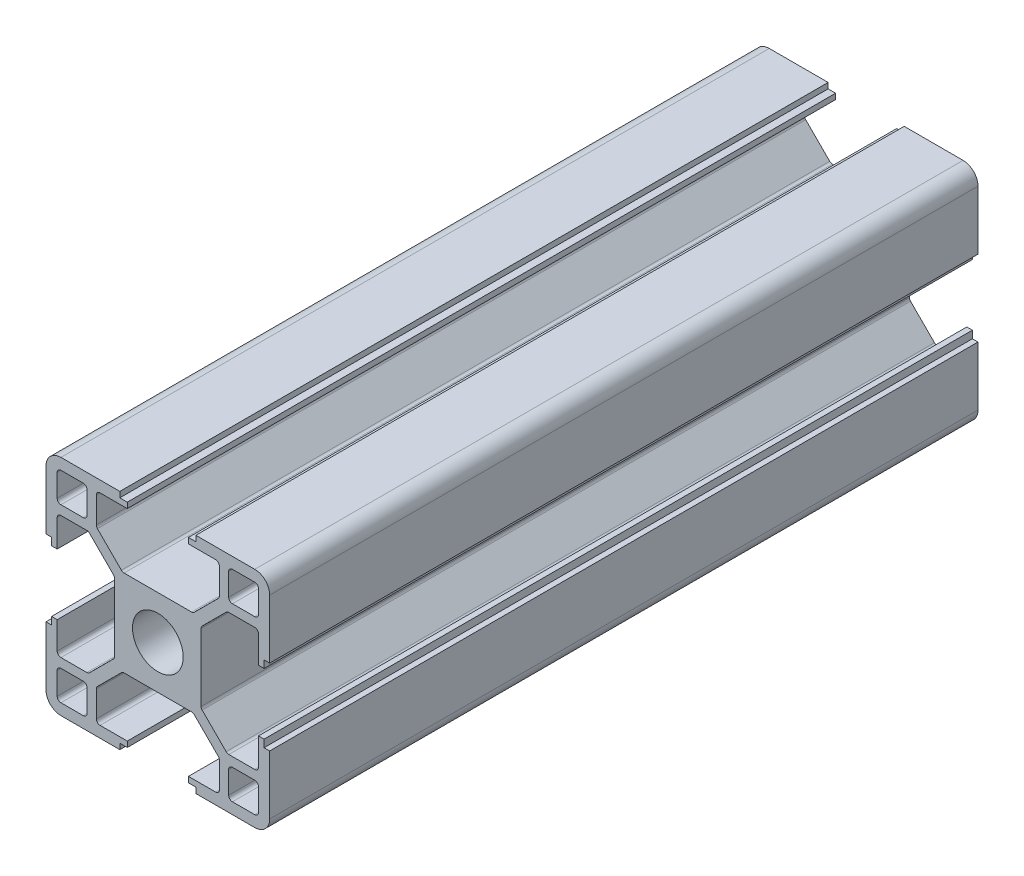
ISO-10303-21;
HEADER;
FILE_DESCRIPTION(('STEP AP214'),'2;1');
FILE_NAME('part.step','',(''),(''),'','','');
FILE_SCHEMA(('AUTOMOTIVE_DESIGN { 1 0 10303 214 1 1 1 1 }'));
ENDSEC;
DATA;
#1=APPLICATION_CONTEXT('core data for automotive mechanical design processes');
#2=APPLICATION_PROTOCOL_DEFINITION('international standard','automotive_design',2000,#1);
#3=PRODUCT_CONTEXT('',#1,'mechanical');
#4=PRODUCT('Part','Part','',(#3));
#5=PRODUCT_RELATED_PRODUCT_CATEGORY('part','',(#4));
#6=PRODUCT_DEFINITION_FORMATION('','',#4);
#7=PRODUCT_DEFINITION_CONTEXT('part definition',#1,'design');
#8=PRODUCT_DEFINITION('design','',#6,#7);
#9=PRODUCT_DEFINITION_SHAPE('','',#8);
#10=(LENGTH_UNIT() NAMED_UNIT(*) SI_UNIT(.MILLI.,.METRE.));
#11=(NAMED_UNIT(*) PLANE_ANGLE_UNIT() SI_UNIT($,.RADIAN.));
#12=(NAMED_UNIT(*) SI_UNIT($,.STERADIAN.) SOLID_ANGLE_UNIT());
#13=UNCERTAINTY_MEASURE_WITH_UNIT(LENGTH_MEASURE(1.E-05),#10,'distance_accuracy_value','');
#14=(GEOMETRIC_REPRESENTATION_CONTEXT(3) GLOBAL_UNCERTAINTY_ASSIGNED_CONTEXT((#13)) GLOBAL_UNIT_ASSIGNED_CONTEXT((#10,
#11,#12)) REPRESENTATION_CONTEXT('',''));
#15=CARTESIAN_POINT('',(0.,0.,0.));
#16=DIRECTION('',(0.,0.,1.));
#17=DIRECTION('',(1.,0.,0.));
#18=AXIS2_PLACEMENT_3D('',#15,#16,#17);
#19=CARTESIAN_POINT('',(19.0797659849,0.689378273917,0.));
#20=DIRECTION('',(0.,-1.,0.));
#21=DIRECTION('',(1.,0.,0.));
#22=AXIS2_PLACEMENT_3D('',#19,#20,#21);
#23=PLANE('',#22);
#24=DIRECTION('',(0.,0.,-1.));
#25=VECTOR('',#24,1.);
#26=CARTESIAN_POINT('',(10.8797659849,0.689378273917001,0.));
#27=LINE('',#26,#25);
#28=CARTESIAN_POINT('',(10.8797659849,0.689378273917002,-75.));
#29=VERTEX_POINT('',#28);
#30=CARTESIAN_POINT('',(10.8797659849,0.689378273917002,-170.));
#31=VERTEX_POINT('',#30);
#32=EDGE_CURVE('E1215',#29,#31,#27,.T.);
#33=ORIENTED_EDGE('',*,*,#32,.F.);
#34=DIRECTION('',(1.,0.,0.));
#35=VECTOR('',#34,1.);
#36=CARTESIAN_POINT('',(9.87976598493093,0.689378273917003,-75.));
#37=LINE('',#36,#35);
#38=CARTESIAN_POINT('',(9.87976598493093,0.689378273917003,-75.));
#39=VERTEX_POINT('',#38);
#40=EDGE_CURVE('E1733',#39,#29,#37,.T.);
#41=ORIENTED_EDGE('',*,*,#40,.F.);
#42=DIRECTION('',(0.,0.,1.));
#43=VECTOR('',#42,1.);
#44=CARTESIAN_POINT('',(9.87976598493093,0.689378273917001,0.));
#45=LINE('',#44,#43);
#46=CARTESIAN_POINT('',(9.87976598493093,0.689378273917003,-170.));
#47=VERTEX_POINT('',#46);
#48=EDGE_CURVE('E1220',#47,#39,#45,.T.);
#49=ORIENTED_EDGE('',*,*,#48,.F.);
#50=DIRECTION('',(1.,0.,0.));
#51=VECTOR('',#50,1.);
#52=CARTESIAN_POINT('',(19.0797659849,0.689378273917,-170.));
#53=LINE('',#52,#51);
#54=EDGE_CURVE('E44',#47,#31,#53,.T.);
#55=ORIENTED_EDGE('',*,*,#54,.T.);
#56=EDGE_LOOP('',(#33,#41,#49,#55));
#57=FACE_BOUND('',#56,.T.);
#58=ADVANCED_FACE('F41',(#57),#23,.T.);
#59=CARTESIAN_POINT('',(19.0797659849,0.689378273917,0.));
#60=DIRECTION('',(0.,-1.,0.));
#61=DIRECTION('',(1.,0.,0.));
#62=AXIS2_PLACEMENT_3D('',#59,#60,#61);
#63=PLANE('',#62);
#64=DIRECTION('',(0.,0.,1.));
#65=VECTOR('',#64,1.);
#66=CARTESIAN_POINT('',(20.0797659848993,0.689378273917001,0.));
#67=LINE('',#66,#65);
#68=CARTESIAN_POINT('',(20.0797659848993,0.689378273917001,-75.));
#69=VERTEX_POINT('',#68);
#70=CARTESIAN_POINT('',(20.0797659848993,0.689378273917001,-170.));
#71=VERTEX_POINT('',#70);
#72=EDGE_CURVE('E1206',#69,#71,#67,.F.);
#73=ORIENTED_EDGE('',*,*,#72,.F.);
#74=DIRECTION('',(1.,0.,0.));
#75=VECTOR('',#74,1.);
#76=CARTESIAN_POINT('',(19.0797659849,0.689378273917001,-75.));
#77=LINE('',#76,#75);
#78=CARTESIAN_POINT('',(19.0797659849,0.689378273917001,-75.));
#79=VERTEX_POINT('',#78);
#80=EDGE_CURVE('E1775',#79,#69,#77,.T.);
#81=ORIENTED_EDGE('',*,*,#80,.F.);
#82=DIRECTION('',(0.,0.,1.));
#83=VECTOR('',#82,1.);
#84=CARTESIAN_POINT('',(19.0797659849,0.689378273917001,0.));
#85=LINE('',#84,#83);
#86=CARTESIAN_POINT('',(19.0797659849,0.689378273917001,-170.));
#87=VERTEX_POINT('',#86);
#88=EDGE_CURVE('E1210',#87,#79,#85,.T.);
#89=ORIENTED_EDGE('',*,*,#88,.F.);
#90=DIRECTION('',(1.,0.,0.));
#91=VECTOR('',#90,1.);
#92=CARTESIAN_POINT('',(19.0797659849,0.689378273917,-170.));
#93=LINE('',#92,#91);
#94=EDGE_CURVE('E1577',#87,#71,#93,.T.);
#95=ORIENTED_EDGE('',*,*,#94,.T.);
#96=EDGE_LOOP('',(#73,#81,#89,#95));
#97=FACE_BOUND('',#96,.T.);
#98=ADVANCED_FACE('F2024',(#97),#63,.T.);
#99=CARTESIAN_POINT('',(29.2297659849,19.0393782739,0.));
#100=DIRECTION('',(1.,0.,0.));
#101=DIRECTION('',(0.,0.,-1.));
#102=AXIS2_PLACEMENT_3D('',#99,#100,#101);
#103=PLANE('',#102);
#104=DIRECTION('',(0.,0.,1.));
#105=VECTOR('',#104,1.);
#106=CARTESIAN_POINT('',(29.2297659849,10.8393782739,0.));
#107=LINE('',#106,#105);
#108=CARTESIAN_POINT('',(29.2297659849,10.8393782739,-75.));
#109=VERTEX_POINT('',#108);
#110=CARTESIAN_POINT('',(29.2297659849,10.8393782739,-170.));
#111=VERTEX_POINT('',#110);
#112=EDGE_CURVE('E1196',#109,#111,#107,.F.);
#113=ORIENTED_EDGE('',*,*,#112,.F.);
#114=DIRECTION('',(0.,1.,0.));
#115=VECTOR('',#114,1.);
#116=CARTESIAN_POINT('',(29.2297659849,9.83937827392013,-75.));
#117=LINE('',#116,#115);
#118=CARTESIAN_POINT('',(29.2297659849,9.83937827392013,-75.));
#119=VERTEX_POINT('',#118);
#120=EDGE_CURVE('E1792',#119,#109,#117,.T.);
#121=ORIENTED_EDGE('',*,*,#120,.F.);
#122=DIRECTION('',(0.,0.,1.));
#123=VECTOR('',#122,1.);
#124=CARTESIAN_POINT('',(29.2297659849,9.83937827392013,0.));
#125=LINE('',#124,#123);
#126=CARTESIAN_POINT('',(29.2297659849,9.83937827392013,-170.));
#127=VERTEX_POINT('',#126);
#128=EDGE_CURVE('E1201',#127,#119,#125,.T.);
#129=ORIENTED_EDGE('',*,*,#128,.F.);
#130=DIRECTION('',(0.,1.,0.));
#131=VECTOR('',#130,1.);
#132=CARTESIAN_POINT('',(29.2297659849,19.0393782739,-170.));
#133=LINE('',#132,#131);
#134=EDGE_CURVE('E1575',#127,#111,#133,.T.);
#135=ORIENTED_EDGE('',*,*,#134,.T.);
#136=EDGE_LOOP('',(#113,#121,#129,#135));
#137=FACE_BOUND('',#136,.T.);
#138=ADVANCED_FACE('F2045',(#137),#103,.T.);
#139=CARTESIAN_POINT('',(29.2297659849,19.0393782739,0.));
#140=DIRECTION('',(1.,0.,0.));
#141=DIRECTION('',(0.,0.,-1.));
#142=AXIS2_PLACEMENT_3D('',#139,#140,#141);
#143=PLANE('',#142);
#144=DIRECTION('',(0.,0.,1.));
#145=VECTOR('',#144,1.);
#146=CARTESIAN_POINT('',(29.2297659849,20.0393782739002,0.));
#147=LINE('',#146,#145);
#148=CARTESIAN_POINT('',(29.2297659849,20.0393782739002,-75.));
#149=VERTEX_POINT('',#148);
#150=CARTESIAN_POINT('',(29.2297659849,20.0393782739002,-170.));
#151=VERTEX_POINT('',#150);
#152=EDGE_CURVE('E1187',#149,#151,#147,.F.);
#153=ORIENTED_EDGE('',*,*,#152,.F.);
#154=DIRECTION('',(0.,1.,0.));
#155=VECTOR('',#154,1.);
#156=CARTESIAN_POINT('',(29.2297659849,19.0393782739,-75.));
#157=LINE('',#156,#155);
#158=CARTESIAN_POINT('',(29.2297659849,19.0393782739,-75.));
#159=VERTEX_POINT('',#158);
#160=EDGE_CURVE('E1824',#159,#149,#157,.T.);
#161=ORIENTED_EDGE('',*,*,#160,.F.);
#162=DIRECTION('',(0.,0.,-1.));
#163=VECTOR('',#162,1.);
#164=CARTESIAN_POINT('',(29.2297659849,19.0393782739,0.));
#165=LINE('',#164,#163);
#166=CARTESIAN_POINT('',(29.2297659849,19.0393782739,-170.));
#167=VERTEX_POINT('',#166);
#168=EDGE_CURVE('E1191',#167,#159,#165,.F.);
#169=ORIENTED_EDGE('',*,*,#168,.F.);
#170=DIRECTION('',(0.,1.,0.));
#171=VECTOR('',#170,1.);
#172=CARTESIAN_POINT('',(29.2297659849,19.0393782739,-170.));
#173=LINE('',#172,#171);
#174=EDGE_CURVE('E1572',#167,#151,#173,.T.);
#175=ORIENTED_EDGE('',*,*,#174,.T.);
#176=EDGE_LOOP('',(#153,#161,#169,#175));
#177=FACE_BOUND('',#176,.T.);
#178=ADVANCED_FACE('F2124',(#177),#143,.T.);
#179=CARTESIAN_POINT('',(10.8797659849,29.1893782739,0.));
#180=DIRECTION('',(0.,1.,0.));
#181=DIRECTION('',(0.,0.,1.));
#182=AXIS2_PLACEMENT_3D('',#179,#180,#181);
#183=PLANE('',#182);
#184=DIRECTION('',(0.,0.,1.));
#185=VECTOR('',#184,1.);
#186=CARTESIAN_POINT('',(19.0797659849,29.1893782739,0.));
#187=LINE('',#186,#185);
#188=CARTESIAN_POINT('',(19.0797659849,29.1893782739,-75.));
#189=VERTEX_POINT('',#188);
#190=CARTESIAN_POINT('',(19.0797659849,29.1893782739,-170.));
#191=VERTEX_POINT('',#190);
#192=EDGE_CURVE('E1179',#189,#191,#187,.F.);
#193=ORIENTED_EDGE('',*,*,#192,.F.);
#194=DIRECTION('',(-1.,0.,0.));
#195=VECTOR('',#194,1.);
#196=CARTESIAN_POINT('',(20.0797659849,29.1893782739,-75.));
#197=LINE('',#196,#195);
#198=CARTESIAN_POINT('',(20.0797659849,29.1893782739,-75.));
#199=VERTEX_POINT('',#198);
#200=EDGE_CURVE('E1836',#199,#189,#197,.T.);
#201=ORIENTED_EDGE('',*,*,#200,.F.);
#202=DIRECTION('',(0.,0.,1.));
#203=VECTOR('',#202,1.);
#204=CARTESIAN_POINT('',(20.0797659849,29.1893782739,0.));
#205=LINE('',#204,#203);
#206=CARTESIAN_POINT('',(20.0797659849,29.1893782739,-170.));
#207=VERTEX_POINT('',#206);
#208=EDGE_CURVE('E1183',#207,#199,#205,.T.);
#209=ORIENTED_EDGE('',*,*,#208,.F.);
#210=DIRECTION('',(1.,0.,0.));
#211=VECTOR('',#210,1.);
#212=CARTESIAN_POINT('',(10.8797659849,29.1893782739,-170.));
#213=LINE('',#212,#211);
#214=EDGE_CURVE('E1569',#207,#191,#213,.F.);
#215=ORIENTED_EDGE('',*,*,#214,.T.);
#216=EDGE_LOOP('',(#193,#201,#209,#215));
#217=FACE_BOUND('',#216,.T.);
#218=ADVANCED_FACE('F2153',(#217),#183,.T.);
#219=CARTESIAN_POINT('',(10.8797659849,29.1893782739,0.));
#220=DIRECTION('',(0.,1.,0.));
#221=DIRECTION('',(0.,0.,1.));
#222=AXIS2_PLACEMENT_3D('',#219,#220,#221);
#223=PLANE('',#222);
#224=DIRECTION('',(0.,0.,1.));
#225=VECTOR('',#224,1.);
#226=CARTESIAN_POINT('',(9.87976598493,29.1893782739,0.));
#227=LINE('',#226,#225);
#228=CARTESIAN_POINT('',(9.87976598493,29.1893782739,-75.));
#229=VERTEX_POINT('',#228);
#230=CARTESIAN_POINT('',(9.87976598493,29.1893782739,-170.));
#231=VERTEX_POINT('',#230);
#232=EDGE_CURVE('E1172',#229,#231,#227,.F.);
#233=ORIENTED_EDGE('',*,*,#232,.F.);
#234=DIRECTION('',(-1.,0.,0.));
#235=VECTOR('',#234,1.);
#236=CARTESIAN_POINT('',(10.8797659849,29.1893782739,-75.));
#237=LINE('',#236,#235);
#238=CARTESIAN_POINT('',(10.8797659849,29.1893782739,-75.));
#239=VERTEX_POINT('',#238);
#240=EDGE_CURVE('E1868',#239,#229,#237,.T.);
#241=ORIENTED_EDGE('',*,*,#240,.F.);
#242=DIRECTION('',(0.,0.,-1.));
#243=VECTOR('',#242,1.);
#244=CARTESIAN_POINT('',(10.8797659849,29.1893782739,0.));
#245=LINE('',#244,#243);
#246=CARTESIAN_POINT('',(10.8797659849,29.1893782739,-170.));
#247=VERTEX_POINT('',#246);
#248=EDGE_CURVE('E1175',#247,#239,#245,.F.);
#249=ORIENTED_EDGE('',*,*,#248,.F.);
#250=DIRECTION('',(1.,0.,0.));
#251=VECTOR('',#250,1.);
#252=CARTESIAN_POINT('',(10.8797659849,29.1893782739,-170.));
#253=LINE('',#252,#251);
#254=EDGE_CURVE('E1566',#247,#231,#253,.F.);
#255=ORIENTED_EDGE('',*,*,#254,.T.);
#256=EDGE_LOOP('',(#233,#241,#249,#255));
#257=FACE_BOUND('',#256,.T.);
#258=ADVANCED_FACE('F2230',(#257),#223,.T.);
#259=CARTESIAN_POINT('',(0.729765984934,10.8393782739,0.));
#260=DIRECTION('',(-1.,0.,0.));
#261=DIRECTION('',(0.,0.,1.));
#262=AXIS2_PLACEMENT_3D('',#259,#260,#261);
#263=PLANE('',#262);
#264=DIRECTION('',(0.,0.,-1.));
#265=VECTOR('',#264,1.);
#266=CARTESIAN_POINT('',(0.729765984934,19.0393782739,0.));
#267=LINE('',#266,#265);
#268=CARTESIAN_POINT('',(0.729765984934,19.0393782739,-75.));
#269=VERTEX_POINT('',#268);
#270=CARTESIAN_POINT('',(0.729765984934,19.0393782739,-170.));
#271=VERTEX_POINT('',#270);
#272=EDGE_CURVE('E1164',#269,#271,#267,.T.);
#273=ORIENTED_EDGE('',*,*,#272,.F.);
#274=DIRECTION('',(0.,-1.,0.));
#275=VECTOR('',#274,1.);
#276=CARTESIAN_POINT('',(0.729765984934,20.0393782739,-75.));
#277=LINE('',#276,#275);
#278=CARTESIAN_POINT('',(0.729765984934,20.0393782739,-75.));
#279=VERTEX_POINT('',#278);
#280=EDGE_CURVE('E1880',#279,#269,#277,.T.);
#281=ORIENTED_EDGE('',*,*,#280,.F.);
#282=DIRECTION('',(0.,0.,1.));
#283=VECTOR('',#282,1.);
#284=CARTESIAN_POINT('',(0.729765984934,20.0393782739,0.));
#285=LINE('',#284,#283);
#286=CARTESIAN_POINT('',(0.729765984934,20.0393782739,-170.));
#287=VERTEX_POINT('',#286);
#288=EDGE_CURVE('E1168',#287,#279,#285,.T.);
#289=ORIENTED_EDGE('',*,*,#288,.F.);
#290=DIRECTION('',(0.,1.,0.));
#291=VECTOR('',#290,1.);
#292=CARTESIAN_POINT('',(0.729765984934,10.8393782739,-170.));
#293=LINE('',#292,#291);
#294=EDGE_CURVE('E1563',#287,#271,#293,.F.);
#295=ORIENTED_EDGE('',*,*,#294,.T.);
#296=EDGE_LOOP('',(#273,#281,#289,#295));
#297=FACE_BOUND('',#296,.T.);
#298=ADVANCED_FACE('F2259',(#297),#263,.T.);
#299=CARTESIAN_POINT('',(0.729765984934,10.8393782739,0.));
#300=DIRECTION('',(-1.,0.,0.));
#301=DIRECTION('',(0.,0.,1.));
#302=AXIS2_PLACEMENT_3D('',#299,#300,#301);
#303=PLANE('',#302);
#304=DIRECTION('',(0.,0.,1.));
#305=VECTOR('',#304,1.);
#306=CARTESIAN_POINT('',(0.729765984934,9.83937827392,0.));
#307=LINE('',#306,#305);
#308=CARTESIAN_POINT('',(0.729765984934,9.83937827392,-75.));
#309=VERTEX_POINT('',#308);
#310=CARTESIAN_POINT('',(0.729765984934,9.83937827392,-170.));
#311=VERTEX_POINT('',#310);
#312=EDGE_CURVE('E1154',#309,#311,#307,.F.);
#313=ORIENTED_EDGE('',*,*,#312,.F.);
#314=DIRECTION('',(0.,-1.,0.));
#315=VECTOR('',#314,1.);
#316=CARTESIAN_POINT('',(0.729765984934,10.8393782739,-75.));
#317=LINE('',#316,#315);
#318=CARTESIAN_POINT('',(0.729765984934,10.8393782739,-75.));
#319=VERTEX_POINT('',#318);
#320=EDGE_CURVE('E1586',#319,#309,#317,.T.);
#321=ORIENTED_EDGE('',*,*,#320,.F.);
#322=DIRECTION('',(0.,0.,1.));
#323=VECTOR('',#322,1.);
#324=CARTESIAN_POINT('',(0.729765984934,10.8393782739,0.));
#325=LINE('',#324,#323);
#326=CARTESIAN_POINT('',(0.729765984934,10.8393782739,-170.));
#327=VERTEX_POINT('',#326);
#328=EDGE_CURVE('E1159',#327,#319,#325,.T.);
#329=ORIENTED_EDGE('',*,*,#328,.F.);
#330=DIRECTION('',(0.,1.,0.));
#331=VECTOR('',#330,1.);
#332=CARTESIAN_POINT('',(0.729765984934,10.8393782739,-170.));
#333=LINE('',#332,#331);
#334=EDGE_CURVE('E1223',#327,#311,#333,.F.);
#335=ORIENTED_EDGE('',*,*,#334,.T.);
#336=EDGE_LOOP('',(#313,#321,#329,#335));
#337=FACE_BOUND('',#336,.T.);
#338=ADVANCED_FACE('F1926',(#337),#303,.T.);
#339=CARTESIAN_POINT('',(9.87976598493,29.1893782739,0.));
#340=DIRECTION('',(1.,0.,0.));
#341=DIRECTION('',(0.,1.,0.));
#342=AXIS2_PLACEMENT_3D('',#339,#340,#341);
#343=PLANE('',#342);
#344=ORIENTED_EDGE('',*,*,#48,.T.);
#345=DIRECTION('',(-2.52733019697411E-10,1.,0.));
#346=VECTOR('',#345,1.);
#347=CARTESIAN_POINT('',(9.87976598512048,-0.0606217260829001,-75.));
#348=LINE('',#347,#346);
#349=CARTESIAN_POINT('',(9.87976598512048,-0.0606217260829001,-75.));
#350=VERTEX_POINT('',#349);
#351=EDGE_CURVE('E1730',#350,#39,#348,.T.);
#352=ORIENTED_EDGE('',*,*,#351,.F.);
#353=DIRECTION('',(0.,0.,-1.));
#354=VECTOR('',#353,1.);
#355=CARTESIAN_POINT('',(9.87976598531,-0.0606217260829,0.));
#356=LINE('',#355,#354);
#357=CARTESIAN_POINT('',(9.87976598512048,-0.0606217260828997,-170.));
#358=VERTEX_POINT('',#357);
#359=EDGE_CURVE('E1147',#358,#350,#356,.F.);
#360=ORIENTED_EDGE('',*,*,#359,.F.);
#361=DIRECTION('',(0.,1.,0.));
#362=VECTOR('',#361,1.);
#363=CARTESIAN_POINT('',(9.87976598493,29.1893782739,-170.));
#364=LINE('',#363,#362);
#365=EDGE_CURVE('E1219',#358,#47,#364,.T.);
#366=ORIENTED_EDGE('',*,*,#365,.T.);
#367=EDGE_LOOP('',(#344,#352,#360,#366));
#368=FACE_BOUND('',#367,.T.);
#369=ADVANCED_FACE('F1944',(#368),#343,.T.);
#370=CARTESIAN_POINT('',(10.8797659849,28.4393782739,0.));
#371=DIRECTION('',(1.,0.,0.));
#372=DIRECTION('',(0.,0.,-1.));
#373=AXIS2_PLACEMENT_3D('',#370,#371,#372);
#374=PLANE('',#373);
#375=DIRECTION('',(0.,0.,-1.));
#376=VECTOR('',#375,1.);
#377=CARTESIAN_POINT('',(10.8797659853,1.43937827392,0.));
#378=LINE('',#377,#376);
#379=CARTESIAN_POINT('',(10.8797659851,1.43937827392,-170.));
#380=VERTEX_POINT('',#379);
#381=CARTESIAN_POINT('',(10.8797659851,1.43937827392,-75.));
#382=VERTEX_POINT('',#381);
#383=EDGE_CURVE('E1143',#380,#382,#378,.F.);
#384=ORIENTED_EDGE('',*,*,#383,.T.);
#385=DIRECTION('',(2.66666318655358E-10,1.,0.));
#386=VECTOR('',#385,1.);
#387=CARTESIAN_POINT('',(10.8797659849,0.689378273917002,-75.));
#388=LINE('',#387,#386);
#389=EDGE_CURVE('E1736',#29,#382,#388,.T.);
#390=ORIENTED_EDGE('',*,*,#389,.F.);
#391=ORIENTED_EDGE('',*,*,#32,.T.);
#392=DIRECTION('',(0.,1.,0.));
#393=VECTOR('',#392,1.);
#394=CARTESIAN_POINT('',(10.8797659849,28.4393782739,-170.));
#395=LINE('',#394,#393);
#396=EDGE_CURVE('E1218',#31,#380,#395,.T.);
#397=ORIENTED_EDGE('',*,*,#396,.T.);
#398=EDGE_LOOP('',(#384,#390,#391,#397));
#399=FACE_BOUND('',#398,.T.);
#400=ADVANCED_FACE('F1948',(#399),#374,.T.);
#401=CARTESIAN_POINT('',(7.22976598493,1.93937827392,0.));
#402=DIRECTION('',(0.,0.,1.));
#403=DIRECTION('',(1.,0.,0.));
#404=AXIS2_PLACEMENT_3D('',#401,#402,#403);
#405=CYLINDRICAL_SURFACE('',#404,0.5);
#406=CARTESIAN_POINT('',(7.22976598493,1.93937827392,-75.));
#407=DIRECTION('',(0.,0.,-1.));
#408=DIRECTION('',(1.,0.,0.));
#409=AXIS2_PLACEMENT_3D('',#406,#407,#408);
#410=CIRCLE('',#409,0.500000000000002);
#411=CARTESIAN_POINT('',(7.22976598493,1.43937827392,-75.));
#412=VERTEX_POINT('',#411);
#413=CARTESIAN_POINT('',(6.72976598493,1.93937827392,-75.));
#414=VERTEX_POINT('',#413);
#415=EDGE_CURVE('E1742',#412,#414,#410,.T.);
#416=ORIENTED_EDGE('',*,*,#415,.F.);
#417=DIRECTION('',(0.,0.,-1.));
#418=VECTOR('',#417,1.);
#419=CARTESIAN_POINT('',(7.22976598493,1.43937827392,0.));
#420=LINE('',#419,#418);
#421=CARTESIAN_POINT('',(7.22976598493,1.43937827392,-170.));
#422=VERTEX_POINT('',#421);
#423=EDGE_CURVE('E1140',#412,#422,#420,.T.);
#424=ORIENTED_EDGE('',*,*,#423,.T.);
#425=CARTESIAN_POINT('',(7.22976598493,1.93937827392,-170.));
#426=DIRECTION('',(0.,0.,1.));
#427=DIRECTION('',(1.,0.,0.));
#428=AXIS2_PLACEMENT_3D('',#425,#426,#427);
#429=CIRCLE('',#428,0.5);
#430=CARTESIAN_POINT('',(6.72976598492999,1.93937827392,-170.));
#431=VERTEX_POINT('',#430);
#432=EDGE_CURVE('E1551',#431,#422,#429,.T.);
#433=ORIENTED_EDGE('',*,*,#432,.F.);
#434=DIRECTION('',(0.,0.,1.));
#435=VECTOR('',#434,1.);
#436=CARTESIAN_POINT('',(6.72976598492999,1.93937827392,0.));
#437=LINE('',#436,#435);
#438=EDGE_CURVE('E1133',#414,#431,#437,.F.);
#439=ORIENTED_EDGE('',*,*,#438,.F.);
#440=EDGE_LOOP('',(#416,#424,#433,#439));
#441=FACE_BOUND('',#440,.T.);
#442=ADVANCED_FACE('F1959',(#441),#405,.F.);
#443=CARTESIAN_POINT('',(7.22976598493,5.42161132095,0.));
#444=DIRECTION('',(0.,0.,1.));
#445=DIRECTION('',(1.,0.,0.));
#446=AXIS2_PLACEMENT_3D('',#443,#444,#445);
#447=CYLINDRICAL_SURFACE('',#446,0.5);
#448=CARTESIAN_POINT('',(7.22976598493,5.42161132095,-75.));
#449=DIRECTION('',(0.,0.,-1.));
#450=DIRECTION('',(1.,0.,0.));
#451=AXIS2_PLACEMENT_3D('',#448,#449,#450);
#452=CIRCLE('',#451,0.499999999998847);
#453=CARTESIAN_POINT('',(6.72976598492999,5.421611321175,-75.));
#454=VERTEX_POINT('',#453);
#455=CARTESIAN_POINT('',(6.87621259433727,5.77516471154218,-75.));
#456=VERTEX_POINT('',#455);
#457=EDGE_CURVE('E1748',#454,#456,#452,.T.);
#458=ORIENTED_EDGE('',*,*,#457,.F.);
#459=DIRECTION('',(0.,0.,1.));
#460=VECTOR('',#459,1.);
#461=CARTESIAN_POINT('',(6.72976598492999,5.4216113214,0.));
#462=LINE('',#461,#460);
#463=CARTESIAN_POINT('',(6.72976598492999,5.421611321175,-170.));
#464=VERTEX_POINT('',#463);
#465=EDGE_CURVE('E1136',#464,#454,#462,.T.);
#466=ORIENTED_EDGE('',*,*,#465,.F.);
#467=CARTESIAN_POINT('',(7.22976598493,5.42161132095,-170.));
#468=DIRECTION('',(0.,0.,1.));
#469=DIRECTION('',(1.,0.,0.));
#470=AXIS2_PLACEMENT_3D('',#467,#468,#469);
#471=CIRCLE('',#470,0.5);
#472=CARTESIAN_POINT('',(6.87621259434,5.77516471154,-170.));
#473=VERTEX_POINT('',#472);
#474=EDGE_CURVE('E1548',#473,#464,#471,.T.);
#475=ORIENTED_EDGE('',*,*,#474,.F.);
#476=DIRECTION('',(0.,0.,1.));
#477=VECTOR('',#476,1.);
#478=CARTESIAN_POINT('',(6.87621259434,5.77516471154,0.));
#479=LINE('',#478,#477);
#480=EDGE_CURVE('E1126',#456,#473,#479,.F.);
#481=ORIENTED_EDGE('',*,*,#480,.F.);
#482=EDGE_LOOP('',(#458,#466,#475,#481));
#483=FACE_BOUND('',#482,.T.);
#484=ADVANCED_FACE('F1967',(#483),#447,.F.);
#485=CARTESIAN_POINT('',(10.4475329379,8.63937827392,0.));
#486=DIRECTION('',(0.,0.,1.));
#487=DIRECTION('',(1.,0.,0.));
#488=AXIS2_PLACEMENT_3D('',#485,#486,#487);
#489=CYLINDRICAL_SURFACE('',#488,0.5);
#490=CARTESIAN_POINT('',(10.4475329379,8.63937827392,-75.));
#491=DIRECTION('',(0.,0.,-1.));
#492=DIRECTION('',(1.,0.,0.));
#493=AXIS2_PLACEMENT_3D('',#490,#491,#492);
#494=CIRCLE('',#493,0.499999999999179);
#495=CARTESIAN_POINT('',(10.0939795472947,8.99293166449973,-75.));
#496=VERTEX_POINT('',#495);
#497=CARTESIAN_POINT('',(10.4475329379,9.13937827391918,-75.));
#498=VERTEX_POINT('',#497);
#499=EDGE_CURVE('E1754',#496,#498,#494,.T.);
#500=ORIENTED_EDGE('',*,*,#499,.F.);
#501=DIRECTION('',(0.,0.,1.));
#502=VECTOR('',#501,1.);
#503=CARTESIAN_POINT('',(10.093979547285,8.992931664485,0.));
#504=LINE('',#503,#502);
#505=CARTESIAN_POINT('',(10.0939795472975,8.9929316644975,-170.));
#506=VERTEX_POINT('',#505);
#507=EDGE_CURVE('E1129',#506,#496,#504,.T.);
#508=ORIENTED_EDGE('',*,*,#507,.F.);
#509=CARTESIAN_POINT('',(10.4475329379,8.63937827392,-170.));
#510=DIRECTION('',(0.,0.,1.));
#511=DIRECTION('',(1.,0.,0.));
#512=AXIS2_PLACEMENT_3D('',#509,#510,#511);
#513=CIRCLE('',#512,0.5);
#514=CARTESIAN_POINT('',(10.4475329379,9.13937827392,-170.));
#515=VERTEX_POINT('',#514);
#516=EDGE_CURVE('E1545',#515,#506,#513,.T.);
#517=ORIENTED_EDGE('',*,*,#516,.F.);
#518=DIRECTION('',(0.,0.,1.));
#519=VECTOR('',#518,1.);
#520=CARTESIAN_POINT('',(10.4475329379,9.13937827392,0.));
#521=LINE('',#520,#519);
#522=EDGE_CURVE('E1119',#498,#515,#521,.F.);
#523=ORIENTED_EDGE('',*,*,#522,.F.);
#524=EDGE_LOOP('',(#500,#508,#517,#523));
#525=FACE_BOUND('',#524,.T.);
#526=ADVANCED_FACE('F1977',(#525),#489,.F.);
#527=CARTESIAN_POINT('',(19.511999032,8.63937827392,0.));
#528=DIRECTION('',(0.,0.,1.));
#529=DIRECTION('',(1.,0.,0.));
#530=AXIS2_PLACEMENT_3D('',#527,#528,#529);
#531=CYLINDRICAL_SURFACE('',#530,0.5);
#532=CARTESIAN_POINT('',(19.511999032,8.63937827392,-75.));
#533=DIRECTION('',(0.,0.,-1.));
#534=DIRECTION('',(1.,0.,0.));
#535=AXIS2_PLACEMENT_3D('',#532,#533,#534);
#536=CIRCLE('',#535,0.499999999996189);
#537=CARTESIAN_POINT('',(19.51199903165,9.13937827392,-75.));
#538=VERTEX_POINT('',#537);
#539=CARTESIAN_POINT('',(19.865552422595,8.99293166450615,-75.));
#540=VERTEX_POINT('',#539);
#541=EDGE_CURVE('E1758',#538,#540,#536,.T.);
#542=ORIENTED_EDGE('',*,*,#541,.F.);
#543=DIRECTION('',(0.,0.,1.));
#544=VECTOR('',#543,1.);
#545=CARTESIAN_POINT('',(19.5119990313,9.13937827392,0.));
#546=LINE('',#545,#544);
#547=CARTESIAN_POINT('',(19.51199903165,9.13937827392,-170.));
#548=VERTEX_POINT('',#547);
#549=EDGE_CURVE('E1122',#548,#538,#546,.T.);
#550=ORIENTED_EDGE('',*,*,#549,.F.);
#551=CARTESIAN_POINT('',(19.511999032,8.63937827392,-170.));
#552=DIRECTION('',(0.,0.,1.));
#553=DIRECTION('',(1.,0.,0.));
#554=AXIS2_PLACEMENT_3D('',#551,#552,#553);
#555=CIRCLE('',#554,0.5);
#556=CARTESIAN_POINT('',(19.8655524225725,8.9929316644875,-170.));
#557=VERTEX_POINT('',#556);
#558=EDGE_CURVE('E1542',#557,#548,#555,.T.);
#559=ORIENTED_EDGE('',*,*,#558,.F.);
#560=DIRECTION('',(0.,0.,1.));
#561=VECTOR('',#560,1.);
#562=CARTESIAN_POINT('',(19.865552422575,8.992931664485,0.));
#563=LINE('',#562,#561);
#564=EDGE_CURVE('E1112',#540,#557,#563,.F.);
#565=ORIENTED_EDGE('',*,*,#564,.F.);
#566=EDGE_LOOP('',(#542,#550,#559,#565));
#567=FACE_BOUND('',#566,.T.);
#568=ADVANCED_FACE('F1987',(#567),#531,.F.);
#569=CARTESIAN_POINT('',(22.7297659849,5.42161132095,0.));
#570=DIRECTION('',(0.,0.,1.));
#571=DIRECTION('',(1.,0.,0.));
#572=AXIS2_PLACEMENT_3D('',#569,#570,#571);
#573=CYLINDRICAL_SURFACE('',#572,0.5);
#574=CARTESIAN_POINT('',(22.7297659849,5.42161132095,-75.));
#575=DIRECTION('',(0.,0.,-1.));
#576=DIRECTION('',(1.,0.,0.));
#577=AXIS2_PLACEMENT_3D('',#574,#575,#576);
#578=CIRCLE('',#577,0.500000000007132);
#579=CARTESIAN_POINT('',(23.0833193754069,5.77516471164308,-75.));
#580=VERTEX_POINT('',#579);
#581=CARTESIAN_POINT('',(23.2297659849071,5.42161132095,-75.));
#582=VERTEX_POINT('',#581);
#583=EDGE_CURVE('E1762',#580,#582,#578,.T.);
#584=ORIENTED_EDGE('',*,*,#583,.F.);
#585=DIRECTION('',(0.,0.,1.));
#586=VECTOR('',#585,1.);
#587=CARTESIAN_POINT('',(23.083319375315,5.775164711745,0.));
#588=LINE('',#587,#586);
#589=CARTESIAN_POINT('',(23.08331937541,5.77516471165,-170.));
#590=VERTEX_POINT('',#589);
#591=EDGE_CURVE('E1115',#590,#580,#588,.T.);
#592=ORIENTED_EDGE('',*,*,#591,.F.);
#593=CARTESIAN_POINT('',(22.7297659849,5.42161132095,-170.));
#594=DIRECTION('',(0.,0.,1.));
#595=DIRECTION('',(1.,0.,0.));
#596=AXIS2_PLACEMENT_3D('',#593,#594,#595);
#597=CIRCLE('',#596,0.5);
#598=CARTESIAN_POINT('',(23.2297659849,5.42161132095,-170.));
#599=VERTEX_POINT('',#598);
#600=EDGE_CURVE('E1539',#599,#590,#597,.T.);
#601=ORIENTED_EDGE('',*,*,#600,.F.);
#602=DIRECTION('',(0.,0.,1.));
#603=VECTOR('',#602,1.);
#604=CARTESIAN_POINT('',(23.2297659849,5.42161132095,0.));
#605=LINE('',#604,#603);
#606=EDGE_CURVE('E1105',#582,#599,#605,.F.);
#607=ORIENTED_EDGE('',*,*,#606,.F.);
#608=EDGE_LOOP('',(#584,#592,#601,#607));
#609=FACE_BOUND('',#608,.T.);
#610=ADVANCED_FACE('F1997',(#609),#573,.F.);
#611=CARTESIAN_POINT('',(22.7297659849,1.93937827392,0.));
#612=DIRECTION('',(0.,0.,1.));
#613=DIRECTION('',(1.,0.,0.));
#614=AXIS2_PLACEMENT_3D('',#611,#612,#613);
#615=CYLINDRICAL_SURFACE('',#614,0.5);
#616=CARTESIAN_POINT('',(22.7297659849,1.93937827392,-75.));
#617=DIRECTION('',(0.,0.,-1.));
#618=DIRECTION('',(1.,0.,0.));
#619=AXIS2_PLACEMENT_3D('',#616,#617,#618);
#620=CIRCLE('',#619,0.499999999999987);
#621=CARTESIAN_POINT('',(23.2297659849,1.93937827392,-75.));
#622=VERTEX_POINT('',#621);
#623=CARTESIAN_POINT('',(22.7297659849,1.43937827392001,-75.));
#624=VERTEX_POINT('',#623);
#625=EDGE_CURVE('E1766',#622,#624,#620,.T.);
#626=ORIENTED_EDGE('',*,*,#625,.F.);
#627=DIRECTION('',(0.,0.,1.));
#628=VECTOR('',#627,1.);
#629=CARTESIAN_POINT('',(23.2297659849,1.93937827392,0.));
#630=LINE('',#629,#628);
#631=CARTESIAN_POINT('',(23.2297659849,1.93937827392,-170.));
#632=VERTEX_POINT('',#631);
#633=EDGE_CURVE('E1108',#632,#622,#630,.T.);
#634=ORIENTED_EDGE('',*,*,#633,.F.);
#635=CARTESIAN_POINT('',(22.7297659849,1.93937827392,-170.));
#636=DIRECTION('',(0.,0.,1.));
#637=DIRECTION('',(1.,0.,0.));
#638=AXIS2_PLACEMENT_3D('',#635,#636,#637);
#639=CIRCLE('',#638,0.5);
#640=CARTESIAN_POINT('',(22.7297659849,1.43937827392,-170.));
#641=VERTEX_POINT('',#640);
#642=EDGE_CURVE('E1214',#641,#632,#639,.T.);
#643=ORIENTED_EDGE('',*,*,#642,.F.);
#644=DIRECTION('',(0.,0.,-1.));
#645=VECTOR('',#644,1.);
#646=CARTESIAN_POINT('',(22.7297659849,1.43937827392,0.));
#647=LINE('',#646,#645);
#648=EDGE_CURVE('E1101',#641,#624,#647,.F.);
#649=ORIENTED_EDGE('',*,*,#648,.T.);
#650=EDGE_LOOP('',(#626,#634,#643,#649));
#651=FACE_BOUND('',#650,.T.);
#652=ADVANCED_FACE('F2006',(#651),#615,.F.);
#653=CARTESIAN_POINT('',(19.0797659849,29.1893782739,0.));
#654=DIRECTION('',(-1.,0.,0.));
#655=DIRECTION('',(0.,0.,1.));
#656=AXIS2_PLACEMENT_3D('',#653,#654,#655);
#657=PLANE('',#656);
#658=ORIENTED_EDGE('',*,*,#88,.T.);
#659=DIRECTION('',(0.,-1.,0.));
#660=VECTOR('',#659,1.);
#661=CARTESIAN_POINT('',(19.0797659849,1.43937827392,-75.));
#662=LINE('',#661,#660);
#663=CARTESIAN_POINT('',(19.0797659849,1.43937827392,-75.));
#664=VERTEX_POINT('',#663);
#665=EDGE_CURVE('E1772',#664,#79,#662,.T.);
#666=ORIENTED_EDGE('',*,*,#665,.F.);
#667=DIRECTION('',(0.,0.,-1.));
#668=VECTOR('',#667,1.);
#669=CARTESIAN_POINT('',(19.0797659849,1.43937827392,0.));
#670=LINE('',#669,#668);
#671=CARTESIAN_POINT('',(19.0797659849,1.43937827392,-170.));
#672=VERTEX_POINT('',#671);
#673=EDGE_CURVE('E1100',#664,#672,#670,.T.);
#674=ORIENTED_EDGE('',*,*,#673,.T.);
#675=DIRECTION('',(0.,1.,0.));
#676=VECTOR('',#675,1.);
#677=CARTESIAN_POINT('',(19.0797659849,29.1893782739,-170.));
#678=LINE('',#677,#676);
#679=EDGE_CURVE('E1209',#672,#87,#678,.F.);
#680=ORIENTED_EDGE('',*,*,#679,.T.);
#681=EDGE_LOOP('',(#658,#666,#674,#680));
#682=FACE_BOUND('',#681,.T.);
#683=ADVANCED_FACE('F2016',(#682),#657,.T.);
#684=CARTESIAN_POINT('',(20.0797659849,29.9393782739,0.));
#685=DIRECTION('',(-1.,0.,0.));
#686=DIRECTION('',(0.,-1.,0.));
#687=AXIS2_PLACEMENT_3D('',#684,#685,#686);
#688=PLANE('',#687);
#689=DIRECTION('',(0.,0.,-1.));
#690=VECTOR('',#689,1.);
#691=CARTESIAN_POINT('',(20.0797659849,-0.0606217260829,0.));
#692=LINE('',#691,#690);
#693=CARTESIAN_POINT('',(20.0797659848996,-0.0606217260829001,-75.));
#694=VERTEX_POINT('',#693);
#695=CARTESIAN_POINT('',(20.0797659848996,-0.0606217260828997,-170.));
#696=VERTEX_POINT('',#695);
#697=EDGE_CURVE('E1097',#694,#696,#692,.T.);
#698=ORIENTED_EDGE('',*,*,#697,.F.);
#699=DIRECTION('',(4.53341068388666E-13,-1.,0.));
#700=VECTOR('',#699,1.);
#701=CARTESIAN_POINT('',(20.0797659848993,0.689378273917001,-75.));
#702=LINE('',#701,#700);
#703=EDGE_CURVE('E1778',#69,#694,#702,.T.);
#704=ORIENTED_EDGE('',*,*,#703,.F.);
#705=ORIENTED_EDGE('',*,*,#72,.T.);
#706=DIRECTION('',(0.,-1.,0.));
#707=VECTOR('',#706,1.);
#708=CARTESIAN_POINT('',(20.0797659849,29.9393782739,-170.));
#709=LINE('',#708,#707);
#710=EDGE_CURVE('E1205',#71,#696,#709,.T.);
#711=ORIENTED_EDGE('',*,*,#710,.T.);
#712=EDGE_LOOP('',(#698,#704,#705,#711));
#713=FACE_BOUND('',#712,.T.);
#714=ADVANCED_FACE('F2021',(#713),#688,.T.);
#715=CARTESIAN_POINT('',(0.729765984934,9.83937827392,0.));
#716=DIRECTION('',(0.,1.,0.));
#717=DIRECTION('',(-1.,0.,0.));
#718=AXIS2_PLACEMENT_3D('',#715,#716,#717);
#719=PLANE('',#718);
#720=ORIENTED_EDGE('',*,*,#128,.T.);
#721=DIRECTION('',(-1.,-2.46585159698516E-10,0.));
#722=VECTOR('',#721,1.);
#723=CARTESIAN_POINT('',(29.9797659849,9.83937827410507,-75.));
#724=LINE('',#723,#722);
#725=CARTESIAN_POINT('',(29.9797659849,9.83937827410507,-75.));
#726=VERTEX_POINT('',#725);
#727=EDGE_CURVE('E1790',#726,#119,#724,.T.);
#728=ORIENTED_EDGE('',*,*,#727,.F.);
#729=DIRECTION('',(0.,0.,-1.));
#730=VECTOR('',#729,1.);
#731=CARTESIAN_POINT('',(29.9797659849,9.83937827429,0.));
#732=LINE('',#731,#730);
#733=CARTESIAN_POINT('',(29.9797659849,9.83937827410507,-170.));
#734=VERTEX_POINT('',#733);
#735=EDGE_CURVE('E1088',#734,#726,#732,.F.);
#736=ORIENTED_EDGE('',*,*,#735,.F.);
#737=DIRECTION('',(-1.,0.,0.));
#738=VECTOR('',#737,1.);
#739=CARTESIAN_POINT('',(0.729765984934,9.83937827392,-170.));
#740=LINE('',#739,#738);
#741=EDGE_CURVE('E1200',#734,#127,#740,.T.);
#742=ORIENTED_EDGE('',*,*,#741,.T.);
#743=EDGE_LOOP('',(#720,#728,#736,#742));
#744=FACE_BOUND('',#743,.T.);
#745=ADVANCED_FACE('F2041',(#744),#719,.T.);
#746=CARTESIAN_POINT('',(1.47976598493,10.8393782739,0.));
#747=DIRECTION('',(0.,1.,0.));
#748=DIRECTION('',(0.,0.,1.));
#749=AXIS2_PLACEMENT_3D('',#746,#747,#748);
#750=PLANE('',#749);
#751=DIRECTION('',(0.,0.,-1.));
#752=VECTOR('',#751,1.);
#753=CARTESIAN_POINT('',(28.4797659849,10.8393782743,0.));
#754=LINE('',#753,#752);
#755=CARTESIAN_POINT('',(28.4797659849,10.8393782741,-170.));
#756=VERTEX_POINT('',#755);
#757=CARTESIAN_POINT('',(28.4797659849,10.8393782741,-75.));
#758=VERTEX_POINT('',#757);
#759=EDGE_CURVE('E1081',#756,#758,#754,.F.);
#760=ORIENTED_EDGE('',*,*,#759,.T.);
#761=DIRECTION('',(-1.,2.66666318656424E-10,0.));
#762=VECTOR('',#761,1.);
#763=CARTESIAN_POINT('',(29.2297659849,10.8393782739,-75.));
#764=LINE('',#763,#762);
#765=EDGE_CURVE('E1794',#109,#758,#764,.T.);
#766=ORIENTED_EDGE('',*,*,#765,.F.);
#767=ORIENTED_EDGE('',*,*,#112,.T.);
#768=DIRECTION('',(1.,0.,0.));
#769=VECTOR('',#768,1.);
#770=CARTESIAN_POINT('',(1.47976598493,10.8393782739,-170.));
#771=LINE('',#770,#769);
#772=EDGE_CURVE('E1199',#111,#756,#771,.F.);
#773=ORIENTED_EDGE('',*,*,#772,.T.);
#774=EDGE_LOOP('',(#760,#766,#767,#773));
#775=FACE_BOUND('',#774,.T.);
#776=ADVANCED_FACE('F2050',(#775),#750,.T.);
#777=CARTESIAN_POINT('',(27.9797659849,7.18937827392,0.));
#778=DIRECTION('',(0.,0.,1.));
#779=DIRECTION('',(1.,0.,0.));
#780=AXIS2_PLACEMENT_3D('',#777,#778,#779);
#781=CYLINDRICAL_SURFACE('',#780,0.5);
#782=CARTESIAN_POINT('',(27.9797659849,7.18937827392,-75.));
#783=DIRECTION('',(0.,0.,-1.));
#784=DIRECTION('',(1.,0.,0.));
#785=AXIS2_PLACEMENT_3D('',#782,#783,#784);
#786=CIRCLE('',#785,0.499999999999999);
#787=CARTESIAN_POINT('',(28.4797659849,7.18937827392,-75.));
#788=VERTEX_POINT('',#787);
#789=CARTESIAN_POINT('',(27.9797659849,6.68937827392,-75.));
#790=VERTEX_POINT('',#789);
#791=EDGE_CURVE('E1798',#788,#790,#786,.T.);
#792=ORIENTED_EDGE('',*,*,#791,.F.);
#793=DIRECTION('',(0.,0.,-1.));
#794=VECTOR('',#793,1.);
#795=CARTESIAN_POINT('',(28.4797659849,7.18937827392,0.));
#796=LINE('',#795,#794);
#797=CARTESIAN_POINT('',(28.4797659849,7.18937827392,-170.));
#798=VERTEX_POINT('',#797);
#799=EDGE_CURVE('E1078',#788,#798,#796,.T.);
#800=ORIENTED_EDGE('',*,*,#799,.T.);
#801=CARTESIAN_POINT('',(27.9797659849,7.18937827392,-170.));
#802=DIRECTION('',(0.,0.,1.));
#803=DIRECTION('',(1.,0.,0.));
#804=AXIS2_PLACEMENT_3D('',#801,#802,#803);
#805=CIRCLE('',#804,0.5);
#806=CARTESIAN_POINT('',(27.9797659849,6.68937827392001,-170.));
#807=VERTEX_POINT('',#806);
#808=EDGE_CURVE('E1525',#807,#798,#805,.T.);
#809=ORIENTED_EDGE('',*,*,#808,.F.);
#810=DIRECTION('',(0.,0.,1.));
#811=VECTOR('',#810,1.);
#812=CARTESIAN_POINT('',(27.9797659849,6.68937827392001,0.));
#813=LINE('',#812,#811);
#814=EDGE_CURVE('E1071',#790,#807,#813,.F.);
#815=ORIENTED_EDGE('',*,*,#814,.F.);
#816=EDGE_LOOP('',(#792,#800,#809,#815));
#817=FACE_BOUND('',#816,.T.);
#818=ADVANCED_FACE('F2061',(#817),#781,.F.);
#819=CARTESIAN_POINT('',(24.4975329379,7.18937827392,0.));
#820=DIRECTION('',(0.,0.,1.));
#821=DIRECTION('',(1.,0.,0.));
#822=AXIS2_PLACEMENT_3D('',#819,#820,#821);
#823=CYLINDRICAL_SURFACE('',#822,0.5);
#824=CARTESIAN_POINT('',(24.4975329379,7.18937827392,-75.));
#825=DIRECTION('',(0.,0.,-1.));
#826=DIRECTION('',(1.,0.,0.));
#827=AXIS2_PLACEMENT_3D('',#824,#825,#826);
#828=CIRCLE('',#827,0.500000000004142);
#829=CARTESIAN_POINT('',(24.49753293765,6.68937827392,-75.));
#830=VERTEX_POINT('',#829);
#831=CARTESIAN_POINT('',(24.1439795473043,6.83582488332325,-75.));
#832=VERTEX_POINT('',#831);
#833=EDGE_CURVE('E1802',#830,#832,#828,.T.);
#834=ORIENTED_EDGE('',*,*,#833,.F.);
#835=DIRECTION('',(0.,0.,1.));
#836=VECTOR('',#835,1.);
#837=CARTESIAN_POINT('',(24.4975329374,6.68937827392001,0.));
#838=LINE('',#837,#836);
#839=CARTESIAN_POINT('',(24.49753293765,6.68937827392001,-170.));
#840=VERTEX_POINT('',#839);
#841=EDGE_CURVE('E1074',#840,#830,#838,.T.);
#842=ORIENTED_EDGE('',*,*,#841,.F.);
#843=CARTESIAN_POINT('',(24.4975329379,7.18937827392,-170.));
#844=DIRECTION('',(0.,0.,1.));
#845=DIRECTION('',(1.,0.,0.));
#846=AXIS2_PLACEMENT_3D('',#843,#844,#845);
#847=CIRCLE('',#846,0.5);
#848=CARTESIAN_POINT('',(24.14397954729,6.83582488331,-170.));
#849=VERTEX_POINT('',#848);
#850=EDGE_CURVE('E1522',#849,#840,#847,.T.);
#851=ORIENTED_EDGE('',*,*,#850,.F.);
#852=DIRECTION('',(0.,0.,1.));
#853=VECTOR('',#852,1.);
#854=CARTESIAN_POINT('',(24.14397954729,6.83582488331,0.));
#855=LINE('',#854,#853);
#856=EDGE_CURVE('E1064',#832,#849,#855,.F.);
#857=ORIENTED_EDGE('',*,*,#856,.F.);
#858=EDGE_LOOP('',(#834,#842,#851,#857));
#859=FACE_BOUND('',#858,.T.);
#860=ADVANCED_FACE('F2069',(#859),#823,.F.);
#861=CARTESIAN_POINT('',(21.2797659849,10.4071452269,0.));
#862=DIRECTION('',(0.,0.,1.));
#863=DIRECTION('',(1.,0.,0.));
#864=AXIS2_PLACEMENT_3D('',#861,#862,#863);
#865=CYLINDRICAL_SURFACE('',#864,0.5);
#866=CARTESIAN_POINT('',(21.2797659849,10.4071452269,-75.));
#867=DIRECTION('',(0.,0.,-1.));
#868=DIRECTION('',(1.,0.,0.));
#869=AXIS2_PLACEMENT_3D('',#866,#867,#868);
#870=CIRCLE('',#869,0.500000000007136);
#871=CARTESIAN_POINT('',(20.9262125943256,10.0535918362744,-75.));
#872=VERTEX_POINT('',#871);
#873=CARTESIAN_POINT('',(20.7797659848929,10.4071452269,-75.));
#874=VERTEX_POINT('',#873);
#875=EDGE_CURVE('E1806',#872,#874,#870,.T.);
#876=ORIENTED_EDGE('',*,*,#875,.F.);
#877=DIRECTION('',(0.,0.,1.));
#878=VECTOR('',#877,1.);
#879=CARTESIAN_POINT('',(20.92621259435,10.05359183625,0.));
#880=LINE('',#879,#878);
#881=CARTESIAN_POINT('',(20.926212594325,10.053591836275,-170.));
#882=VERTEX_POINT('',#881);
#883=EDGE_CURVE('E1067',#882,#872,#880,.T.);
#884=ORIENTED_EDGE('',*,*,#883,.F.);
#885=CARTESIAN_POINT('',(21.2797659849,10.4071452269,-170.));
#886=DIRECTION('',(0.,0.,1.));
#887=DIRECTION('',(1.,0.,0.));
#888=AXIS2_PLACEMENT_3D('',#885,#886,#887);
#889=CIRCLE('',#888,0.5);
#890=CARTESIAN_POINT('',(20.7797659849,10.4071452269,-170.));
#891=VERTEX_POINT('',#890);
#892=EDGE_CURVE('E1519',#891,#882,#889,.T.);
#893=ORIENTED_EDGE('',*,*,#892,.F.);
#894=DIRECTION('',(0.,0.,-1.));
#895=VECTOR('',#894,1.);
#896=CARTESIAN_POINT('',(20.7797659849,10.4071452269,0.));
#897=LINE('',#896,#895);
#898=EDGE_CURVE('E1057',#874,#891,#897,.T.);
#899=ORIENTED_EDGE('',*,*,#898,.F.);
#900=EDGE_LOOP('',(#876,#884,#893,#899));
#901=FACE_BOUND('',#900,.T.);
#902=ADVANCED_FACE('F2079',(#901),#865,.F.);
#903=CARTESIAN_POINT('',(21.2797659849,19.471611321,0.));
#904=DIRECTION('',(0.,0.,1.));
#905=DIRECTION('',(1.,0.,0.));
#906=AXIS2_PLACEMENT_3D('',#903,#904,#905);
#907=CYLINDRICAL_SURFACE('',#906,0.5);
#908=CARTESIAN_POINT('',(21.2797659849,19.471611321,-75.));
#909=DIRECTION('',(0.,0.,-1.));
#910=DIRECTION('',(1.,0.,0.));
#911=AXIS2_PLACEMENT_3D('',#908,#909,#910);
#912=CIRCLE('',#911,0.499999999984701);
#913=CARTESIAN_POINT('',(20.7797659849,19.47161132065,-75.));
#914=VERTEX_POINT('',#913);
#915=CARTESIAN_POINT('',(20.9262125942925,19.8251647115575,-75.));
#916=VERTEX_POINT('',#915);
#917=EDGE_CURVE('E1810',#914,#916,#912,.T.);
#918=ORIENTED_EDGE('',*,*,#917,.F.);
#919=DIRECTION('',(0.,0.,-1.));
#920=VECTOR('',#919,1.);
#921=CARTESIAN_POINT('',(20.7797659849,19.4716113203,0.));
#922=LINE('',#921,#920);
#923=CARTESIAN_POINT('',(20.7797659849,19.47161132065,-170.));
#924=VERTEX_POINT('',#923);
#925=EDGE_CURVE('E1060',#924,#914,#922,.F.);
#926=ORIENTED_EDGE('',*,*,#925,.F.);
#927=CARTESIAN_POINT('',(21.2797659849,19.471611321,-170.));
#928=DIRECTION('',(0.,0.,1.));
#929=DIRECTION('',(1.,0.,0.));
#930=AXIS2_PLACEMENT_3D('',#927,#928,#929);
#931=CIRCLE('',#930,0.5);
#932=CARTESIAN_POINT('',(20.926212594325,19.825164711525,-170.));
#933=VERTEX_POINT('',#932);
#934=EDGE_CURVE('E1517',#933,#924,#931,.T.);
#935=ORIENTED_EDGE('',*,*,#934,.F.);
#936=DIRECTION('',(0.,0.,1.));
#937=VECTOR('',#936,1.);
#938=CARTESIAN_POINT('',(20.9262125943,19.8251647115,0.));
#939=LINE('',#938,#937);
#940=EDGE_CURVE('E1052',#916,#933,#939,.F.);
#941=ORIENTED_EDGE('',*,*,#940,.F.);
#942=EDGE_LOOP('',(#918,#926,#935,#941));
#943=FACE_BOUND('',#942,.T.);
#944=ADVANCED_FACE('F2089',(#943),#907,.F.);
#945=CARTESIAN_POINT('',(24.4975329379,22.6893782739,0.));
#946=DIRECTION('',(0.,0.,1.));
#947=DIRECTION('',(1.,0.,0.));
#948=AXIS2_PLACEMENT_3D('',#945,#946,#947);
#949=CYLINDRICAL_SURFACE('',#948,0.5);
#950=CARTESIAN_POINT('',(24.4975329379,22.6893782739,-75.));
#951=DIRECTION('',(0.,0.,-1.));
#952=DIRECTION('',(1.,0.,0.));
#953=AXIS2_PLACEMENT_3D('',#950,#951,#952);
#954=CIRCLE('',#953,0.500000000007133);
#955=CARTESIAN_POINT('',(24.143979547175,23.042931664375,-75.));
#956=VERTEX_POINT('',#955);
#957=CARTESIAN_POINT('',(24.4975329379,23.1893782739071,-75.));
#958=VERTEX_POINT('',#957);
#959=EDGE_CURVE('E1814',#956,#958,#954,.T.);
#960=ORIENTED_EDGE('',*,*,#959,.F.);
#961=DIRECTION('',(0.,0.,1.));
#962=VECTOR('',#961,1.);
#963=CARTESIAN_POINT('',(24.14397954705,23.04293166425,0.));
#964=LINE('',#963,#962);
#965=CARTESIAN_POINT('',(24.143979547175,23.042931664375,-170.));
#966=VERTEX_POINT('',#965);
#967=EDGE_CURVE('E1054',#966,#956,#964,.T.);
#968=ORIENTED_EDGE('',*,*,#967,.F.);
#969=CARTESIAN_POINT('',(24.4975329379,22.6893782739,-170.));
#970=DIRECTION('',(0.,0.,1.));
#971=DIRECTION('',(1.,0.,0.));
#972=AXIS2_PLACEMENT_3D('',#969,#970,#971);
#973=CIRCLE('',#972,0.5);
#974=CARTESIAN_POINT('',(24.4975329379,23.1893782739,-170.));
#975=VERTEX_POINT('',#974);
#976=EDGE_CURVE('E1515',#975,#966,#973,.T.);
#977=ORIENTED_EDGE('',*,*,#976,.F.);
#978=DIRECTION('',(0.,0.,-1.));
#979=VECTOR('',#978,1.);
#980=CARTESIAN_POINT('',(24.4975329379,23.1893782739,0.));
#981=LINE('',#980,#979);
#982=EDGE_CURVE('E1046',#958,#975,#981,.T.);
#983=ORIENTED_EDGE('',*,*,#982,.F.);
#984=EDGE_LOOP('',(#960,#968,#977,#983));
#985=FACE_BOUND('',#984,.T.);
#986=ADVANCED_FACE('F2099',(#985),#949,.F.);
#987=CARTESIAN_POINT('',(27.9797659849,22.6893782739,0.));
#988=DIRECTION('',(0.,0.,1.));
#989=DIRECTION('',(1.,0.,0.));
#990=AXIS2_PLACEMENT_3D('',#987,#988,#989);
#991=CYLINDRICAL_SURFACE('',#990,0.5);
#992=CARTESIAN_POINT('',(27.9797659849,22.6893782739,-75.));
#993=DIRECTION('',(0.,0.,-1.));
#994=DIRECTION('',(1.,0.,0.));
#995=AXIS2_PLACEMENT_3D('',#992,#993,#994);
#996=CIRCLE('',#995,0.499999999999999);
#997=CARTESIAN_POINT('',(27.9797659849,23.1893782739,-75.));
#998=VERTEX_POINT('',#997);
#999=CARTESIAN_POINT('',(28.4797659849,22.6893782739,-75.));
#1000=VERTEX_POINT('',#999);
#1001=EDGE_CURVE('E1818',#998,#1000,#996,.T.);
#1002=ORIENTED_EDGE('',*,*,#1001,.F.);
#1003=DIRECTION('',(0.,0.,-1.));
#1004=VECTOR('',#1003,1.);
#1005=CARTESIAN_POINT('',(27.9797659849,23.1893782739,0.));
#1006=LINE('',#1005,#1004);
#1007=CARTESIAN_POINT('',(27.9797659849,23.1893782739,-170.));
#1008=VERTEX_POINT('',#1007);
#1009=EDGE_CURVE('E1049',#1008,#998,#1006,.F.);
#1010=ORIENTED_EDGE('',*,*,#1009,.F.);
#1011=CARTESIAN_POINT('',(27.9797659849,22.6893782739,-170.));
#1012=DIRECTION('',(0.,0.,1.));
#1013=DIRECTION('',(1.,0.,0.));
#1014=AXIS2_PLACEMENT_3D('',#1011,#1012,#1013);
#1015=CIRCLE('',#1014,0.5);
#1016=CARTESIAN_POINT('',(28.4797659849,22.6893782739,-170.));
#1017=VERTEX_POINT('',#1016);
#1018=EDGE_CURVE('E1195',#1017,#1008,#1015,.T.);
#1019=ORIENTED_EDGE('',*,*,#1018,.F.);
#1020=DIRECTION('',(0.,0.,-1.));
#1021=VECTOR('',#1020,1.);
#1022=CARTESIAN_POINT('',(28.4797659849,22.6893782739,0.));
#1023=LINE('',#1022,#1021);
#1024=EDGE_CURVE('E1042',#1017,#1000,#1023,.F.);
#1025=ORIENTED_EDGE('',*,*,#1024,.T.);
#1026=EDGE_LOOP('',(#1002,#1010,#1019,#1025));
#1027=FACE_BOUND('',#1026,.T.);
#1028=ADVANCED_FACE('F2108',(#1027),#991,.F.);
#1029=CARTESIAN_POINT('',(0.729765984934,19.0393782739,0.));
#1030=DIRECTION('',(0.,-1.,0.));
#1031=DIRECTION('',(0.,0.,-1.));
#1032=AXIS2_PLACEMENT_3D('',#1029,#1030,#1031);
#1033=PLANE('',#1032);
#1034=ORIENTED_EDGE('',*,*,#168,.T.);
#1035=DIRECTION('',(1.,0.,0.));
#1036=VECTOR('',#1035,1.);
#1037=CARTESIAN_POINT('',(28.4797659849,19.0393782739,-75.));
#1038=LINE('',#1037,#1036);
#1039=CARTESIAN_POINT('',(28.4797659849,19.0393782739,-75.));
#1040=VERTEX_POINT('',#1039);
#1041=EDGE_CURVE('E1822',#1040,#159,#1038,.T.);
#1042=ORIENTED_EDGE('',*,*,#1041,.F.);
#1043=DIRECTION('',(0.,0.,-1.));
#1044=VECTOR('',#1043,1.);
#1045=CARTESIAN_POINT('',(28.4797659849,19.0393782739,0.));
#1046=LINE('',#1045,#1044);
#1047=CARTESIAN_POINT('',(28.4797659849,19.0393782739,-170.));
#1048=VERTEX_POINT('',#1047);
#1049=EDGE_CURVE('E1041',#1040,#1048,#1046,.T.);
#1050=ORIENTED_EDGE('',*,*,#1049,.T.);
#1051=DIRECTION('',(1.,0.,0.));
#1052=VECTOR('',#1051,1.);
#1053=CARTESIAN_POINT('',(0.729765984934,19.0393782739,-170.));
#1054=LINE('',#1053,#1052);
#1055=EDGE_CURVE('E1190',#1048,#167,#1054,.T.);
#1056=ORIENTED_EDGE('',*,*,#1055,.T.);
#1057=EDGE_LOOP('',(#1034,#1042,#1050,#1056));
#1058=FACE_BOUND('',#1057,.T.);
#1059=ADVANCED_FACE('F2118',(#1058),#1033,.T.);
#1060=CARTESIAN_POINT('',(-0.0202340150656,20.0393782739,0.));
#1061=DIRECTION('',(0.,-1.,0.));
#1062=DIRECTION('',(1.,0.,0.));
#1063=AXIS2_PLACEMENT_3D('',#1060,#1061,#1062);
#1064=PLANE('',#1063);
#1065=DIRECTION('',(0.,0.,-1.));
#1066=VECTOR('',#1065,1.);
#1067=CARTESIAN_POINT('',(29.9797659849,20.0393782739,0.));
#1068=LINE('',#1067,#1066);
#1069=CARTESIAN_POINT('',(29.9797659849,20.0393782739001,-75.));
#1070=VERTEX_POINT('',#1069);
#1071=CARTESIAN_POINT('',(29.9797659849,20.0393782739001,-170.));
#1072=VERTEX_POINT('',#1071);
#1073=EDGE_CURVE('E1038',#1070,#1072,#1068,.T.);
#1074=ORIENTED_EDGE('',*,*,#1073,.F.);
#1075=DIRECTION('',(1.,-1.15648231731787E-13,0.));
#1076=VECTOR('',#1075,1.);
#1077=CARTESIAN_POINT('',(29.2297659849,20.0393782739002,-75.));
#1078=LINE('',#1077,#1076);
#1079=EDGE_CURVE('E1826',#149,#1070,#1078,.T.);
#1080=ORIENTED_EDGE('',*,*,#1079,.F.);
#1081=ORIENTED_EDGE('',*,*,#152,.T.);
#1082=DIRECTION('',(1.,0.,0.));
#1083=VECTOR('',#1082,1.);
#1084=CARTESIAN_POINT('',(-0.0202340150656,20.0393782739,-170.));
#1085=LINE('',#1084,#1083);
#1086=EDGE_CURVE('E1186',#151,#1072,#1085,.T.);
#1087=ORIENTED_EDGE('',*,*,#1086,.T.);
#1088=EDGE_LOOP('',(#1074,#1080,#1081,#1087));
#1089=FACE_BOUND('',#1088,.T.);
#1090=ADVANCED_FACE('F2130',(#1089),#1064,.T.);
#1091=CARTESIAN_POINT('',(20.0797659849,29.9393782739,0.));
#1092=DIRECTION('',(-1.,0.,0.));
#1093=DIRECTION('',(0.,-1.,0.));
#1094=AXIS2_PLACEMENT_3D('',#1091,#1092,#1093);
#1095=PLANE('',#1094);
#1096=ORIENTED_EDGE('',*,*,#208,.T.);
#1097=DIRECTION('',(1.99974296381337E-10,-1.,0.));
#1098=VECTOR('',#1097,1.);
#1099=CARTESIAN_POINT('',(20.07976598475,29.9393782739,-75.));
#1100=LINE('',#1099,#1098);
#1101=CARTESIAN_POINT('',(20.07976598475,29.9393782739,-75.));
#1102=VERTEX_POINT('',#1101);
#1103=EDGE_CURVE('E1834',#1102,#199,#1100,.T.);
#1104=ORIENTED_EDGE('',*,*,#1103,.F.);
#1105=DIRECTION('',(0.,0.,1.));
#1106=VECTOR('',#1105,1.);
#1107=CARTESIAN_POINT('',(20.0797659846,29.9393782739,0.));
#1108=LINE('',#1107,#1106);
#1109=CARTESIAN_POINT('',(20.07976598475,29.9393782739,-170.));
#1110=VERTEX_POINT('',#1109);
#1111=EDGE_CURVE('E1032',#1110,#1102,#1108,.T.);
#1112=ORIENTED_EDGE('',*,*,#1111,.F.);
#1113=DIRECTION('',(0.,-1.,0.));
#1114=VECTOR('',#1113,1.);
#1115=CARTESIAN_POINT('',(20.0797659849,29.9393782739,-170.));
#1116=LINE('',#1115,#1114);
#1117=EDGE_CURVE('E1182',#1110,#207,#1116,.T.);
#1118=ORIENTED_EDGE('',*,*,#1117,.T.);
#1119=EDGE_LOOP('',(#1096,#1104,#1112,#1118));
#1120=FACE_BOUND('',#1119,.T.);
#1121=ADVANCED_FACE('F2148',(#1120),#1095,.T.);
#1122=CARTESIAN_POINT('',(19.0797659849,29.1893782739,0.));
#1123=DIRECTION('',(-1.,0.,0.));
#1124=DIRECTION('',(0.,0.,1.));
#1125=AXIS2_PLACEMENT_3D('',#1122,#1123,#1124);
#1126=PLANE('',#1125);
#1127=DIRECTION('',(0.,0.,1.));
#1128=VECTOR('',#1127,1.);
#1129=CARTESIAN_POINT('',(19.0797659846,28.4393782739,0.));
#1130=LINE('',#1129,#1128);
#1131=CARTESIAN_POINT('',(19.07976598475,28.4393782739,-170.));
#1132=VERTEX_POINT('',#1131);
#1133=CARTESIAN_POINT('',(19.07976598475,28.4393782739,-75.));
#1134=VERTEX_POINT('',#1133);
#1135=EDGE_CURVE('E1027',#1132,#1134,#1130,.T.);
#1136=ORIENTED_EDGE('',*,*,#1135,.T.);
#1137=DIRECTION('',(-1.99997426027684E-10,-1.,0.));
#1138=VECTOR('',#1137,1.);
#1139=CARTESIAN_POINT('',(19.0797659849,29.1893782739,-75.));
#1140=LINE('',#1139,#1138);
#1141=EDGE_CURVE('E1838',#189,#1134,#1140,.T.);
#1142=ORIENTED_EDGE('',*,*,#1141,.F.);
#1143=ORIENTED_EDGE('',*,*,#192,.T.);
#1144=DIRECTION('',(0.,1.,0.));
#1145=VECTOR('',#1144,1.);
#1146=CARTESIAN_POINT('',(19.0797659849,29.1893782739,-170.));
#1147=LINE('',#1146,#1145);
#1148=EDGE_CURVE('E1181',#191,#1132,#1147,.F.);
#1149=ORIENTED_EDGE('',*,*,#1148,.T.);
#1150=EDGE_LOOP('',(#1136,#1142,#1143,#1149));
#1151=FACE_BOUND('',#1150,.T.);
#1152=ADVANCED_FACE('F2155',(#1151),#1126,.T.);
#1153=CARTESIAN_POINT('',(22.7297659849,27.9393782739,0.));
#1154=DIRECTION('',(0.,0.,1.));
#1155=DIRECTION('',(1.,0.,0.));
#1156=AXIS2_PLACEMENT_3D('',#1153,#1154,#1155);
#1157=CYLINDRICAL_SURFACE('',#1156,0.5);
#1158=CARTESIAN_POINT('',(22.7297659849,27.9393782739,-75.));
#1159=DIRECTION('',(0.,0.,-1.));
#1160=DIRECTION('',(1.,0.,0.));
#1161=AXIS2_PLACEMENT_3D('',#1158,#1159,#1160);
#1162=CIRCLE('',#1161,0.500000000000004);
#1163=CARTESIAN_POINT('',(22.7297659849,28.4393782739,-75.));
#1164=VERTEX_POINT('',#1163);
#1165=CARTESIAN_POINT('',(23.2297659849,27.9393782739,-75.));
#1166=VERTEX_POINT('',#1165);
#1167=EDGE_CURVE('E1842',#1164,#1166,#1162,.T.);
#1168=ORIENTED_EDGE('',*,*,#1167,.F.);
#1169=DIRECTION('',(0.,0.,1.));
#1170=VECTOR('',#1169,1.);
#1171=CARTESIAN_POINT('',(22.7297659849,28.4393782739,0.));
#1172=LINE('',#1171,#1170);
#1173=CARTESIAN_POINT('',(22.7297659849,28.4393782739,-170.));
#1174=VERTEX_POINT('',#1173);
#1175=EDGE_CURVE('E1025',#1164,#1174,#1172,.F.);
#1176=ORIENTED_EDGE('',*,*,#1175,.T.);
#1177=CARTESIAN_POINT('',(22.7297659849,27.9393782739,-170.));
#1178=DIRECTION('',(0.,0.,1.));
#1179=DIRECTION('',(1.,0.,0.));
#1180=AXIS2_PLACEMENT_3D('',#1177,#1178,#1179);
#1181=CIRCLE('',#1180,0.5);
#1182=CARTESIAN_POINT('',(23.2297659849,27.9393782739,-170.));
#1183=VERTEX_POINT('',#1182);
#1184=EDGE_CURVE('E1504',#1183,#1174,#1181,.T.);
#1185=ORIENTED_EDGE('',*,*,#1184,.F.);
#1186=DIRECTION('',(0.,0.,1.));
#1187=VECTOR('',#1186,1.);
#1188=CARTESIAN_POINT('',(23.2297659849,27.9393782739,0.));
#1189=LINE('',#1188,#1187);
#1190=EDGE_CURVE('E1020',#1166,#1183,#1189,.F.);
#1191=ORIENTED_EDGE('',*,*,#1190,.F.);
#1192=EDGE_LOOP('',(#1168,#1176,#1185,#1191));
#1193=FACE_BOUND('',#1192,.T.);
#1194=ADVANCED_FACE('F2165',(#1193),#1157,.F.);
#1195=CARTESIAN_POINT('',(22.7297659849,24.4571452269,0.));
#1196=DIRECTION('',(0.,0.,1.));
#1197=DIRECTION('',(1.,0.,0.));
#1198=AXIS2_PLACEMENT_3D('',#1195,#1196,#1197);
#1199=CYLINDRICAL_SURFACE('',#1198,0.5);
#1200=CARTESIAN_POINT('',(22.7297659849,24.4571452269,-75.));
#1201=DIRECTION('',(0.,0.,-1.));
#1202=DIRECTION('',(1.,0.,0.));
#1203=AXIS2_PLACEMENT_3D('',#1200,#1201,#1202);
#1204=CIRCLE('',#1203,0.500000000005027);
#1205=CARTESIAN_POINT('',(23.2297659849,24.45714522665,-75.));
#1206=VERTEX_POINT('',#1205);
#1207=CARTESIAN_POINT('',(23.0833193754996,24.1035918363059,-75.));
#1208=VERTEX_POINT('',#1207);
#1209=EDGE_CURVE('E1846',#1206,#1208,#1204,.T.);
#1210=ORIENTED_EDGE('',*,*,#1209,.F.);
#1211=DIRECTION('',(0.,0.,1.));
#1212=VECTOR('',#1211,1.);
#1213=CARTESIAN_POINT('',(23.2297659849,24.4571452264,0.));
#1214=LINE('',#1213,#1212);
#1215=CARTESIAN_POINT('',(23.2297659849,24.45714522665,-170.));
#1216=VERTEX_POINT('',#1215);
#1217=EDGE_CURVE('E1022',#1216,#1206,#1214,.T.);
#1218=ORIENTED_EDGE('',*,*,#1217,.F.);
#1219=CARTESIAN_POINT('',(22.7297659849,24.4571452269,-170.));
#1220=DIRECTION('',(0.,0.,1.));
#1221=DIRECTION('',(1.,0.,0.));
#1222=AXIS2_PLACEMENT_3D('',#1219,#1220,#1221);
#1223=CIRCLE('',#1222,0.5);
#1224=CARTESIAN_POINT('',(23.083319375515,24.103591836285,-170.));
#1225=VERTEX_POINT('',#1224);
#1226=EDGE_CURVE('E1502',#1225,#1216,#1223,.T.);
#1227=ORIENTED_EDGE('',*,*,#1226,.F.);
#1228=DIRECTION('',(0.,0.,1.));
#1229=VECTOR('',#1228,1.);
#1230=CARTESIAN_POINT('',(23.083319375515,24.103591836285,0.));
#1231=LINE('',#1230,#1229);
#1232=EDGE_CURVE('E1015',#1208,#1225,#1231,.F.);
#1233=ORIENTED_EDGE('',*,*,#1232,.F.);
#1234=EDGE_LOOP('',(#1210,#1218,#1227,#1233));
#1235=FACE_BOUND('',#1234,.T.);
#1236=ADVANCED_FACE('F2178',(#1235),#1199,.F.);
#1237=CARTESIAN_POINT('',(19.511999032,21.2393782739,0.));
#1238=DIRECTION('',(0.,0.,1.));
#1239=DIRECTION('',(1.,0.,0.));
#1240=AXIS2_PLACEMENT_3D('',#1237,#1238,#1239);
#1241=CYLINDRICAL_SURFACE('',#1240,0.5);
#1242=CARTESIAN_POINT('',(19.511999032,21.2393782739,-75.));
#1243=DIRECTION('',(0.,0.,-1.));
#1244=DIRECTION('',(1.,0.,0.));
#1245=AXIS2_PLACEMENT_3D('',#1242,#1243,#1244);
#1246=CIRCLE('',#1245,0.499999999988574);
#1247=CARTESIAN_POINT('',(19.8655524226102,20.8858248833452,-75.));
#1248=VERTEX_POINT('',#1247);
#1249=CARTESIAN_POINT('',(19.511999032,20.7393782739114,-75.));
#1250=VERTEX_POINT('',#1249);
#1251=EDGE_CURVE('E1850',#1248,#1250,#1246,.T.);
#1252=ORIENTED_EDGE('',*,*,#1251,.F.);
#1253=DIRECTION('',(0.,0.,1.));
#1254=VECTOR('',#1253,1.);
#1255=CARTESIAN_POINT('',(19.865552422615,20.885824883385,0.));
#1256=LINE('',#1255,#1254);
#1257=CARTESIAN_POINT('',(19.86555242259,20.88582488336,-170.));
#1258=VERTEX_POINT('',#1257);
#1259=EDGE_CURVE('E1017',#1258,#1248,#1256,.T.);
#1260=ORIENTED_EDGE('',*,*,#1259,.F.);
#1261=CARTESIAN_POINT('',(19.511999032,21.2393782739,-170.));
#1262=DIRECTION('',(0.,0.,1.));
#1263=DIRECTION('',(1.,0.,0.));
#1264=AXIS2_PLACEMENT_3D('',#1261,#1262,#1263);
#1265=CIRCLE('',#1264,0.5);
#1266=CARTESIAN_POINT('',(19.511999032,20.7393782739,-170.));
#1267=VERTEX_POINT('',#1266);
#1268=EDGE_CURVE('E1500',#1267,#1258,#1265,.T.);
#1269=ORIENTED_EDGE('',*,*,#1268,.F.);
#1270=DIRECTION('',(0.,0.,1.));
#1271=VECTOR('',#1270,1.);
#1272=CARTESIAN_POINT('',(19.511999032,20.7393782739,0.));
#1273=LINE('',#1272,#1271);
#1274=EDGE_CURVE('E1010',#1250,#1267,#1273,.F.);
#1275=ORIENTED_EDGE('',*,*,#1274,.F.);
#1276=EDGE_LOOP('',(#1252,#1260,#1269,#1275));
#1277=FACE_BOUND('',#1276,.T.);
#1278=ADVANCED_FACE('F2186',(#1277),#1241,.F.);
#1279=CARTESIAN_POINT('',(10.4475329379,21.2393782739,0.));
#1280=DIRECTION('',(0.,0.,1.));
#1281=DIRECTION('',(1.,0.,0.));
#1282=AXIS2_PLACEMENT_3D('',#1279,#1280,#1281);
#1283=CYLINDRICAL_SURFACE('',#1282,0.5);
#1284=CARTESIAN_POINT('',(10.4475329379,21.2393782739,-75.));
#1285=DIRECTION('',(0.,0.,-1.));
#1286=DIRECTION('',(1.,0.,0.));
#1287=AXIS2_PLACEMENT_3D('',#1284,#1285,#1286);
#1288=CIRCLE('',#1287,0.500000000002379);
#1289=CARTESIAN_POINT('',(10.44753293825,20.7393782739,-75.));
#1290=VERTEX_POINT('',#1289);
#1291=CARTESIAN_POINT('',(10.0939795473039,20.8858248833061,-75.));
#1292=VERTEX_POINT('',#1291);
#1293=EDGE_CURVE('E1854',#1290,#1292,#1288,.T.);
#1294=ORIENTED_EDGE('',*,*,#1293,.F.);
#1295=DIRECTION('',(0.,0.,1.));
#1296=VECTOR('',#1295,1.);
#1297=CARTESIAN_POINT('',(10.4475329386,20.7393782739,0.));
#1298=LINE('',#1297,#1296);
#1299=CARTESIAN_POINT('',(10.44753293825,20.7393782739,-170.));
#1300=VERTEX_POINT('',#1299);
#1301=EDGE_CURVE('E1012',#1300,#1290,#1298,.T.);
#1302=ORIENTED_EDGE('',*,*,#1301,.F.);
#1303=CARTESIAN_POINT('',(10.4475329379,21.2393782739,-170.));
#1304=DIRECTION('',(0.,0.,1.));
#1305=DIRECTION('',(1.,0.,0.));
#1306=AXIS2_PLACEMENT_3D('',#1303,#1304,#1305);
#1307=CIRCLE('',#1306,0.5);
#1308=CARTESIAN_POINT('',(10.0939795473,20.8858248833,-170.));
#1309=VERTEX_POINT('',#1308);
#1310=EDGE_CURVE('E1498',#1309,#1300,#1307,.T.);
#1311=ORIENTED_EDGE('',*,*,#1310,.F.);
#1312=DIRECTION('',(0.,0.,1.));
#1313=VECTOR('',#1312,1.);
#1314=CARTESIAN_POINT('',(10.0939795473,20.8858248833,0.));
#1315=LINE('',#1314,#1313);
#1316=EDGE_CURVE('E1005',#1292,#1309,#1315,.F.);
#1317=ORIENTED_EDGE('',*,*,#1316,.F.);
#1318=EDGE_LOOP('',(#1294,#1302,#1311,#1317));
#1319=FACE_BOUND('',#1318,.T.);
#1320=ADVANCED_FACE('F2196',(#1319),#1283,.F.);
#1321=CARTESIAN_POINT('',(7.22976598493,24.4571452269,0.));
#1322=DIRECTION('',(0.,0.,1.));
#1323=DIRECTION('',(1.,0.,0.));
#1324=AXIS2_PLACEMENT_3D('',#1321,#1322,#1323);
#1325=CYLINDRICAL_SURFACE('',#1324,0.5);
#1326=CARTESIAN_POINT('',(7.22976598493,24.4571452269,-75.));
#1327=DIRECTION('',(0.,0.,-1.));
#1328=DIRECTION('',(1.,0.,0.));
#1329=AXIS2_PLACEMENT_3D('',#1326,#1327,#1328);
#1330=CIRCLE('',#1329,0.500000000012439);
#1331=CARTESIAN_POINT('',(6.8762125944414,24.1035918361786,-75.));
#1332=VERTEX_POINT('',#1331);
#1333=CARTESIAN_POINT('',(6.72976598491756,24.4571452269,-75.));
#1334=VERTEX_POINT('',#1333);
#1335=EDGE_CURVE('E1858',#1332,#1334,#1330,.T.);
#1336=ORIENTED_EDGE('',*,*,#1335,.F.);
#1337=DIRECTION('',(0.,0.,1.));
#1338=VECTOR('',#1337,1.);
#1339=CARTESIAN_POINT('',(6.87621259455,24.10359183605,0.));
#1340=LINE('',#1339,#1338);
#1341=CARTESIAN_POINT('',(6.8762125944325,24.1035918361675,-170.));
#1342=VERTEX_POINT('',#1341);
#1343=EDGE_CURVE('E1007',#1342,#1332,#1340,.T.);
#1344=ORIENTED_EDGE('',*,*,#1343,.F.);
#1345=CARTESIAN_POINT('',(7.22976598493,24.4571452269,-170.));
#1346=DIRECTION('',(0.,0.,1.));
#1347=DIRECTION('',(1.,0.,0.));
#1348=AXIS2_PLACEMENT_3D('',#1345,#1346,#1347);
#1349=CIRCLE('',#1348,0.5);
#1350=CARTESIAN_POINT('',(6.72976598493,24.4571452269,-170.));
#1351=VERTEX_POINT('',#1350);
#1352=EDGE_CURVE('E1496',#1351,#1342,#1349,.T.);
#1353=ORIENTED_EDGE('',*,*,#1352,.F.);
#1354=DIRECTION('',(0.,0.,1.));
#1355=VECTOR('',#1354,1.);
#1356=CARTESIAN_POINT('',(6.72976598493,24.4571452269,0.));
#1357=LINE('',#1356,#1355);
#1358=EDGE_CURVE('E1000',#1334,#1351,#1357,.F.);
#1359=ORIENTED_EDGE('',*,*,#1358,.F.);
#1360=EDGE_LOOP('',(#1336,#1344,#1353,#1359));
#1361=FACE_BOUND('',#1360,.T.);
#1362=ADVANCED_FACE('F2206',(#1361),#1325,.F.);
#1363=CARTESIAN_POINT('',(7.22976598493,27.9393782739,0.));
#1364=DIRECTION('',(0.,0.,1.));
#1365=DIRECTION('',(1.,0.,0.));
#1366=AXIS2_PLACEMENT_3D('',#1363,#1364,#1365);
#1367=CYLINDRICAL_SURFACE('',#1366,0.5);
#1368=CARTESIAN_POINT('',(7.22976598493,27.9393782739,-75.));
#1369=DIRECTION('',(0.,0.,-1.));
#1370=DIRECTION('',(1.,0.,0.));
#1371=AXIS2_PLACEMENT_3D('',#1368,#1369,#1370);
#1372=CIRCLE('',#1371,0.500000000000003);
#1373=CARTESIAN_POINT('',(6.72976598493,27.9393782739,-75.));
#1374=VERTEX_POINT('',#1373);
#1375=CARTESIAN_POINT('',(7.22976598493,28.4393782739,-75.));
#1376=VERTEX_POINT('',#1375);
#1377=EDGE_CURVE('E1862',#1374,#1376,#1372,.T.);
#1378=ORIENTED_EDGE('',*,*,#1377,.F.);
#1379=DIRECTION('',(0.,0.,1.));
#1380=VECTOR('',#1379,1.);
#1381=CARTESIAN_POINT('',(6.72976598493,27.9393782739,0.));
#1382=LINE('',#1381,#1380);
#1383=CARTESIAN_POINT('',(6.72976598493,27.9393782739,-170.));
#1384=VERTEX_POINT('',#1383);
#1385=EDGE_CURVE('E1002',#1384,#1374,#1382,.T.);
#1386=ORIENTED_EDGE('',*,*,#1385,.F.);
#1387=CARTESIAN_POINT('',(7.22976598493,27.9393782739,-170.));
#1388=DIRECTION('',(0.,0.,1.));
#1389=DIRECTION('',(1.,0.,0.));
#1390=AXIS2_PLACEMENT_3D('',#1387,#1388,#1389);
#1391=CIRCLE('',#1390,0.5);
#1392=CARTESIAN_POINT('',(7.22976598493,28.4393782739,-170.));
#1393=VERTEX_POINT('',#1392);
#1394=EDGE_CURVE('E1178',#1393,#1384,#1391,.T.);
#1395=ORIENTED_EDGE('',*,*,#1394,.F.);
#1396=DIRECTION('',(0.,0.,1.));
#1397=VECTOR('',#1396,1.);
#1398=CARTESIAN_POINT('',(7.22976598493,28.4393782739,0.));
#1399=LINE('',#1398,#1397);
#1400=EDGE_CURVE('E997',#1393,#1376,#1399,.T.);
#1401=ORIENTED_EDGE('',*,*,#1400,.T.);
#1402=EDGE_LOOP('',(#1378,#1386,#1395,#1401));
#1403=FACE_BOUND('',#1402,.T.);
#1404=ADVANCED_FACE('F2215',(#1403),#1367,.F.);
#1405=CARTESIAN_POINT('',(10.8797659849,28.4393782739,0.));
#1406=DIRECTION('',(1.,0.,0.));
#1407=DIRECTION('',(0.,0.,-1.));
#1408=AXIS2_PLACEMENT_3D('',#1405,#1406,#1407);
#1409=PLANE('',#1408);
#1410=ORIENTED_EDGE('',*,*,#248,.T.);
#1411=DIRECTION('',(0.,1.,0.));
#1412=VECTOR('',#1411,1.);
#1413=CARTESIAN_POINT('',(10.8797659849,28.4393782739,-75.));
#1414=LINE('',#1413,#1412);
#1415=CARTESIAN_POINT('',(10.8797659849,28.4393782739,-75.));
#1416=VERTEX_POINT('',#1415);
#1417=EDGE_CURVE('E1866',#1416,#239,#1414,.T.);
#1418=ORIENTED_EDGE('',*,*,#1417,.F.);
#1419=DIRECTION('',(0.,0.,1.));
#1420=VECTOR('',#1419,1.);
#1421=CARTESIAN_POINT('',(10.8797659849,28.4393782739,0.));
#1422=LINE('',#1421,#1420);
#1423=CARTESIAN_POINT('',(10.8797659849,28.4393782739,-170.));
#1424=VERTEX_POINT('',#1423);
#1425=EDGE_CURVE('E996',#1416,#1424,#1422,.F.);
#1426=ORIENTED_EDGE('',*,*,#1425,.T.);
#1427=DIRECTION('',(0.,1.,0.));
#1428=VECTOR('',#1427,1.);
#1429=CARTESIAN_POINT('',(10.8797659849,28.4393782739,-170.));
#1430=LINE('',#1429,#1428);
#1431=EDGE_CURVE('E1174',#1424,#247,#1430,.T.);
#1432=ORIENTED_EDGE('',*,*,#1431,.T.);
#1433=EDGE_LOOP('',(#1410,#1418,#1426,#1432));
#1434=FACE_BOUND('',#1433,.T.);
#1435=ADVANCED_FACE('F2225',(#1434),#1409,.T.);
#1436=CARTESIAN_POINT('',(9.87976598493,29.1893782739,0.));
#1437=DIRECTION('',(1.,0.,0.));
#1438=DIRECTION('',(0.,1.,0.));
#1439=AXIS2_PLACEMENT_3D('',#1436,#1437,#1438);
#1440=PLANE('',#1439);
#1441=DIRECTION('',(0.,0.,1.));
#1442=VECTOR('',#1441,1.);
#1443=CARTESIAN_POINT('',(9.87976598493,29.9393782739,0.));
#1444=LINE('',#1443,#1442);
#1445=CARTESIAN_POINT('',(9.87976598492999,29.9393782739,-75.));
#1446=VERTEX_POINT('',#1445);
#1447=CARTESIAN_POINT('',(9.87976598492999,29.9393782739,-170.));
#1448=VERTEX_POINT('',#1447);
#1449=EDGE_CURVE('E994',#1446,#1448,#1444,.F.);
#1450=ORIENTED_EDGE('',*,*,#1449,.F.);
#1451=DIRECTION('',(0.,1.,0.));
#1452=VECTOR('',#1451,1.);
#1453=CARTESIAN_POINT('',(9.87976598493,29.1893782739,-75.));
#1454=LINE('',#1453,#1452);
#1455=EDGE_CURVE('E1870',#229,#1446,#1454,.T.);
#1456=ORIENTED_EDGE('',*,*,#1455,.F.);
#1457=ORIENTED_EDGE('',*,*,#232,.T.);
#1458=DIRECTION('',(0.,1.,0.));
#1459=VECTOR('',#1458,1.);
#1460=CARTESIAN_POINT('',(9.87976598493,29.1893782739,-170.));
#1461=LINE('',#1460,#1459);
#1462=EDGE_CURVE('E1171',#231,#1448,#1461,.T.);
#1463=ORIENTED_EDGE('',*,*,#1462,.T.);
#1464=EDGE_LOOP('',(#1450,#1456,#1457,#1463));
#1465=FACE_BOUND('',#1464,.T.);
#1466=ADVANCED_FACE('F2235',(#1465),#1440,.T.);
#1467=CARTESIAN_POINT('',(-0.0202340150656,20.0393782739,0.));
#1468=DIRECTION('',(0.,-1.,0.));
#1469=DIRECTION('',(1.,0.,0.));
#1470=AXIS2_PLACEMENT_3D('',#1467,#1468,#1469);
#1471=PLANE('',#1470);
#1472=ORIENTED_EDGE('',*,*,#288,.T.);
#1473=DIRECTION('',(1.,2.66670944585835E-10,0.));
#1474=VECTOR('',#1473,1.);
#1475=CARTESIAN_POINT('',(-0.0202340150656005,20.0393782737,-75.));
#1476=LINE('',#1475,#1474);
#1477=CARTESIAN_POINT('',(-0.0202340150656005,20.0393782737,-75.));
#1478=VERTEX_POINT('',#1477);
#1479=EDGE_CURVE('E1878',#1478,#279,#1476,.T.);
#1480=ORIENTED_EDGE('',*,*,#1479,.F.);
#1481=DIRECTION('',(0.,0.,1.));
#1482=VECTOR('',#1481,1.);
#1483=CARTESIAN_POINT('',(-0.0202340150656,20.0393782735,0.));
#1484=LINE('',#1483,#1482);
#1485=CARTESIAN_POINT('',(-0.0202340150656,20.0393782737,-170.));
#1486=VERTEX_POINT('',#1485);
#1487=EDGE_CURVE('E988',#1486,#1478,#1484,.T.);
#1488=ORIENTED_EDGE('',*,*,#1487,.F.);
#1489=DIRECTION('',(1.,0.,0.));
#1490=VECTOR('',#1489,1.);
#1491=CARTESIAN_POINT('',(-0.0202340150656,20.0393782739,-170.));
#1492=LINE('',#1491,#1490);
#1493=EDGE_CURVE('E1167',#1486,#287,#1492,.T.);
#1494=ORIENTED_EDGE('',*,*,#1493,.T.);
#1495=EDGE_LOOP('',(#1472,#1480,#1488,#1494));
#1496=FACE_BOUND('',#1495,.T.);
#1497=ADVANCED_FACE('F2254',(#1496),#1471,.T.);
#1498=CARTESIAN_POINT('',(0.729765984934,19.0393782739,0.));
#1499=DIRECTION('',(0.,-1.,0.));
#1500=DIRECTION('',(0.,0.,-1.));
#1501=AXIS2_PLACEMENT_3D('',#1498,#1499,#1500);
#1502=PLANE('',#1501);
#1503=DIRECTION('',(0.,0.,1.));
#1504=VECTOR('',#1503,1.);
#1505=CARTESIAN_POINT('',(1.47976598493,19.0393782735,0.));
#1506=LINE('',#1505,#1504);
#1507=CARTESIAN_POINT('',(1.47976598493,19.0393782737,-170.));
#1508=VERTEX_POINT('',#1507);
#1509=CARTESIAN_POINT('',(1.47976598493,19.0393782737,-75.));
#1510=VERTEX_POINT('',#1509);
#1511=EDGE_CURVE('E983',#1508,#1510,#1506,.T.);
#1512=ORIENTED_EDGE('',*,*,#1511,.T.);
#1513=DIRECTION('',(1.,-2.66666318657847E-10,0.));
#1514=VECTOR('',#1513,1.);
#1515=CARTESIAN_POINT('',(0.729765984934,19.0393782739,-75.));
#1516=LINE('',#1515,#1514);
#1517=EDGE_CURVE('E1882',#269,#1510,#1516,.T.);
#1518=ORIENTED_EDGE('',*,*,#1517,.F.);
#1519=ORIENTED_EDGE('',*,*,#272,.T.);
#1520=DIRECTION('',(1.,0.,0.));
#1521=VECTOR('',#1520,1.);
#1522=CARTESIAN_POINT('',(0.729765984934,19.0393782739,-170.));
#1523=LINE('',#1522,#1521);
#1524=EDGE_CURVE('E1166',#271,#1508,#1523,.T.);
#1525=ORIENTED_EDGE('',*,*,#1524,.T.);
#1526=EDGE_LOOP('',(#1512,#1518,#1519,#1525));
#1527=FACE_BOUND('',#1526,.T.);
#1528=ADVANCED_FACE('F2261',(#1527),#1502,.T.);
#1529=CARTESIAN_POINT('',(1.97976598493,22.6893782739,0.));
#1530=DIRECTION('',(0.,0.,1.));
#1531=DIRECTION('',(1.,0.,0.));
#1532=AXIS2_PLACEMENT_3D('',#1529,#1530,#1531);
#1533=CYLINDRICAL_SURFACE('',#1532,0.5);
#1534=CARTESIAN_POINT('',(1.97976598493,22.6893782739,-75.));
#1535=DIRECTION('',(0.,0.,-1.));
#1536=DIRECTION('',(1.,0.,0.));
#1537=AXIS2_PLACEMENT_3D('',#1534,#1535,#1536);
#1538=CIRCLE('',#1537,0.500000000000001);
#1539=CARTESIAN_POINT('',(1.47976598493,22.6893782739,-75.));
#1540=VERTEX_POINT('',#1539);
#1541=CARTESIAN_POINT('',(1.97976598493,23.1893782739,-75.));
#1542=VERTEX_POINT('',#1541);
#1543=EDGE_CURVE('E1886',#1540,#1542,#1538,.T.);
#1544=ORIENTED_EDGE('',*,*,#1543,.F.);
#1545=DIRECTION('',(0.,0.,1.));
#1546=VECTOR('',#1545,1.);
#1547=CARTESIAN_POINT('',(1.47976598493,22.6893782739,0.));
#1548=LINE('',#1547,#1546);
#1549=CARTESIAN_POINT('',(1.47976598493,22.6893782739,-170.));
#1550=VERTEX_POINT('',#1549);
#1551=EDGE_CURVE('E981',#1540,#1550,#1548,.F.);
#1552=ORIENTED_EDGE('',*,*,#1551,.T.);
#1553=CARTESIAN_POINT('',(1.97976598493,22.6893782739,-170.));
#1554=DIRECTION('',(0.,0.,1.));
#1555=DIRECTION('',(1.,0.,0.));
#1556=AXIS2_PLACEMENT_3D('',#1553,#1554,#1555);
#1557=CIRCLE('',#1556,0.5);
#1558=CARTESIAN_POINT('',(1.97976598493,23.1893782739,-170.));
#1559=VERTEX_POINT('',#1558);
#1560=EDGE_CURVE('E1485',#1559,#1550,#1557,.T.);
#1561=ORIENTED_EDGE('',*,*,#1560,.F.);
#1562=DIRECTION('',(0.,0.,-1.));
#1563=VECTOR('',#1562,1.);
#1564=CARTESIAN_POINT('',(1.97976598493,23.1893782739,0.));
#1565=LINE('',#1564,#1563);
#1566=EDGE_CURVE('E976',#1542,#1559,#1565,.T.);
#1567=ORIENTED_EDGE('',*,*,#1566,.F.);
#1568=EDGE_LOOP('',(#1544,#1552,#1561,#1567));
#1569=FACE_BOUND('',#1568,.T.);
#1570=ADVANCED_FACE('F2271',(#1569),#1533,.F.);
#1571=CARTESIAN_POINT('',(5.46199903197,22.6893782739,0.));
#1572=DIRECTION('',(0.,0.,1.));
#1573=DIRECTION('',(1.,0.,0.));
#1574=AXIS2_PLACEMENT_3D('',#1571,#1572,#1573);
#1575=CYLINDRICAL_SURFACE('',#1574,0.5);
#1576=CARTESIAN_POINT('',(5.46199903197,22.6893782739,-75.));
#1577=DIRECTION('',(0.,0.,-1.));
#1578=DIRECTION('',(1.,0.,0.));
#1579=AXIS2_PLACEMENT_3D('',#1576,#1577,#1578);
#1580=CIRCLE('',#1579,0.500000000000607);
#1581=CARTESIAN_POINT('',(5.461999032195,23.1893782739,-75.));
#1582=VERTEX_POINT('',#1581);
#1583=CARTESIAN_POINT('',(5.81555242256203,23.0429316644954,-75.));
#1584=VERTEX_POINT('',#1583);
#1585=EDGE_CURVE('E1890',#1582,#1584,#1580,.T.);
#1586=ORIENTED_EDGE('',*,*,#1585,.F.);
#1587=DIRECTION('',(0.,0.,-1.));
#1588=VECTOR('',#1587,1.);
#1589=CARTESIAN_POINT('',(5.46199903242,23.1893782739,0.));
#1590=LINE('',#1589,#1588);
#1591=CARTESIAN_POINT('',(5.461999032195,23.1893782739,-170.));
#1592=VERTEX_POINT('',#1591);
#1593=EDGE_CURVE('E978',#1592,#1582,#1590,.F.);
#1594=ORIENTED_EDGE('',*,*,#1593,.F.);
#1595=CARTESIAN_POINT('',(5.46199903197,22.6893782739,-170.));
#1596=DIRECTION('',(0.,0.,1.));
#1597=DIRECTION('',(1.,0.,0.));
#1598=AXIS2_PLACEMENT_3D('',#1595,#1596,#1597);
#1599=CIRCLE('',#1598,0.5);
#1600=CARTESIAN_POINT('',(5.8155524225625,23.0429316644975,-170.));
#1601=VERTEX_POINT('',#1600);
#1602=EDGE_CURVE('E1483',#1601,#1592,#1599,.T.);
#1603=ORIENTED_EDGE('',*,*,#1602,.F.);
#1604=DIRECTION('',(0.,0.,1.));
#1605=VECTOR('',#1604,1.);
#1606=CARTESIAN_POINT('',(5.81555242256,23.0429316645,0.));
#1607=LINE('',#1606,#1605);
#1608=EDGE_CURVE('E971',#1584,#1601,#1607,.F.);
#1609=ORIENTED_EDGE('',*,*,#1608,.F.);
#1610=EDGE_LOOP('',(#1586,#1594,#1603,#1609));
#1611=FACE_BOUND('',#1610,.T.);
#1612=ADVANCED_FACE('F2284',(#1611),#1575,.F.);
#1613=CARTESIAN_POINT('',(8.67976598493,19.471611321,0.));
#1614=DIRECTION('',(0.,0.,1.));
#1615=DIRECTION('',(1.,0.,0.));
#1616=AXIS2_PLACEMENT_3D('',#1613,#1614,#1615);
#1617=CYLINDRICAL_SURFACE('',#1616,0.5);
#1618=CARTESIAN_POINT('',(8.67976598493,19.471611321,-75.));
#1619=DIRECTION('',(0.,0.,-1.));
#1620=DIRECTION('',(1.,0.,0.));
#1621=AXIS2_PLACEMENT_3D('',#1618,#1619,#1620);
#1622=CIRCLE('',#1621,0.499999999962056);
#1623=CARTESIAN_POINT('',(9.03331937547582,19.8251647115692,-75.));
#1624=VERTEX_POINT('',#1623);
#1625=CARTESIAN_POINT('',(9.17976598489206,19.471611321,-75.));
#1626=VERTEX_POINT('',#1625);
#1627=EDGE_CURVE('E1894',#1624,#1626,#1622,.T.);
#1628=ORIENTED_EDGE('',*,*,#1627,.F.);
#1629=DIRECTION('',(0.,0.,1.));
#1630=VECTOR('',#1629,1.);
#1631=CARTESIAN_POINT('',(9.03331937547,19.82516471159,0.));
#1632=LINE('',#1631,#1630);
#1633=CARTESIAN_POINT('',(9.0333193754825,19.8251647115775,-170.));
#1634=VERTEX_POINT('',#1633);
#1635=EDGE_CURVE('E973',#1634,#1624,#1632,.T.);
#1636=ORIENTED_EDGE('',*,*,#1635,.F.);
#1637=CARTESIAN_POINT('',(8.67976598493,19.471611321,-170.));
#1638=DIRECTION('',(0.,0.,1.));
#1639=DIRECTION('',(1.,0.,0.));
#1640=AXIS2_PLACEMENT_3D('',#1637,#1638,#1639);
#1641=CIRCLE('',#1640,0.5);
#1642=CARTESIAN_POINT('',(9.17976598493,19.471611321,-170.));
#1643=VERTEX_POINT('',#1642);
#1644=EDGE_CURVE('E1481',#1643,#1634,#1641,.T.);
#1645=ORIENTED_EDGE('',*,*,#1644,.F.);
#1646=DIRECTION('',(0.,0.,1.));
#1647=VECTOR('',#1646,1.);
#1648=CARTESIAN_POINT('',(9.17976598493,19.471611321,0.));
#1649=LINE('',#1648,#1647);
#1650=EDGE_CURVE('E964',#1626,#1643,#1649,.F.);
#1651=ORIENTED_EDGE('',*,*,#1650,.F.);
#1652=EDGE_LOOP('',(#1628,#1636,#1645,#1651));
#1653=FACE_BOUND('',#1652,.T.);
#1654=ADVANCED_FACE('F2292',(#1653),#1617,.F.);
#1655=CARTESIAN_POINT('',(8.67976598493,10.4071452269,0.));
#1656=DIRECTION('',(0.,0.,1.));
#1657=DIRECTION('',(1.,0.,0.));
#1658=AXIS2_PLACEMENT_3D('',#1655,#1656,#1657);
#1659=CYLINDRICAL_SURFACE('',#1658,0.5);
#1660=CARTESIAN_POINT('',(8.67976598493,10.4071452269,-75.));
#1661=DIRECTION('',(0.,0.,-1.));
#1662=DIRECTION('',(1.,0.,0.));
#1663=AXIS2_PLACEMENT_3D('',#1660,#1661,#1662);
#1664=CIRCLE('',#1663,0.500000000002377);
#1665=CARTESIAN_POINT('',(9.17976598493,10.4071452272,-75.));
#1666=VERTEX_POINT('',#1665);
#1667=CARTESIAN_POINT('',(9.03331937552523,10.0535918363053,-75.));
#1668=VERTEX_POINT('',#1667);
#1669=EDGE_CURVE('E1898',#1666,#1668,#1664,.T.);
#1670=ORIENTED_EDGE('',*,*,#1669,.F.);
#1671=DIRECTION('',(0.,0.,1.));
#1672=VECTOR('',#1671,1.);
#1673=CARTESIAN_POINT('',(9.17976598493,10.4071452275,0.));
#1674=LINE('',#1673,#1672);
#1675=CARTESIAN_POINT('',(9.17976598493,10.4071452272,-170.));
#1676=VERTEX_POINT('',#1675);
#1677=EDGE_CURVE('E967',#1676,#1666,#1674,.T.);
#1678=ORIENTED_EDGE('',*,*,#1677,.F.);
#1679=CARTESIAN_POINT('',(8.67976598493,10.4071452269,-170.));
#1680=DIRECTION('',(0.,0.,1.));
#1681=DIRECTION('',(1.,0.,0.));
#1682=AXIS2_PLACEMENT_3D('',#1679,#1680,#1681);
#1683=CIRCLE('',#1682,0.5);
#1684=CARTESIAN_POINT('',(9.03331937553,10.0535918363,-170.));
#1685=VERTEX_POINT('',#1684);
#1686=EDGE_CURVE('E1478',#1685,#1676,#1683,.T.);
#1687=ORIENTED_EDGE('',*,*,#1686,.F.);
#1688=DIRECTION('',(0.,0.,1.));
#1689=VECTOR('',#1688,1.);
#1690=CARTESIAN_POINT('',(9.03331937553,10.0535918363,0.));
#1691=LINE('',#1690,#1689);
#1692=EDGE_CURVE('E957',#1668,#1685,#1691,.F.);
#1693=ORIENTED_EDGE('',*,*,#1692,.F.);
#1694=EDGE_LOOP('',(#1670,#1678,#1687,#1693));
#1695=FACE_BOUND('',#1694,.T.);
#1696=ADVANCED_FACE('F2302',(#1695),#1659,.F.);
#1697=CARTESIAN_POINT('',(5.46199903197,7.18937827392,0.));
#1698=DIRECTION('',(0.,0.,1.));
#1699=DIRECTION('',(1.,0.,0.));
#1700=AXIS2_PLACEMENT_3D('',#1697,#1698,#1699);
#1701=CYLINDRICAL_SURFACE('',#1700,0.5);
#1702=CARTESIAN_POINT('',(5.46199903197,7.18937827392,-75.));
#1703=DIRECTION('',(0.,0.,-1.));
#1704=DIRECTION('',(1.,0.,0.));
#1705=AXIS2_PLACEMENT_3D('',#1702,#1703,#1704);
#1706=CIRCLE('',#1705,0.499999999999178);
#1707=CARTESIAN_POINT('',(5.81555242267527,6.83582488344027,-75.));
#1708=VERTEX_POINT('',#1707);
#1709=CARTESIAN_POINT('',(5.46199903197,6.68937827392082,-75.));
#1710=VERTEX_POINT('',#1709);
#1711=EDGE_CURVE('E1902',#1708,#1710,#1706,.T.);
#1712=ORIENTED_EDGE('',*,*,#1711,.F.);
#1713=DIRECTION('',(0.,0.,1.));
#1714=VECTOR('',#1713,1.);
#1715=CARTESIAN_POINT('',(5.815552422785,6.835824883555,0.));
#1716=LINE('',#1715,#1714);
#1717=CARTESIAN_POINT('',(5.8155524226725,6.8358248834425,-170.));
#1718=VERTEX_POINT('',#1717);
#1719=EDGE_CURVE('E960',#1718,#1708,#1716,.T.);
#1720=ORIENTED_EDGE('',*,*,#1719,.F.);
#1721=CARTESIAN_POINT('',(5.46199903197,7.18937827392,-170.));
#1722=DIRECTION('',(0.,0.,1.));
#1723=DIRECTION('',(1.,0.,0.));
#1724=AXIS2_PLACEMENT_3D('',#1721,#1722,#1723);
#1725=CIRCLE('',#1724,0.5);
#1726=CARTESIAN_POINT('',(5.46199903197,6.68937827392,-170.));
#1727=VERTEX_POINT('',#1726);
#1728=EDGE_CURVE('E1475',#1727,#1718,#1725,.T.);
#1729=ORIENTED_EDGE('',*,*,#1728,.F.);
#1730=DIRECTION('',(0.,0.,1.));
#1731=VECTOR('',#1730,1.);
#1732=CARTESIAN_POINT('',(5.46199903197,6.68937827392,0.));
#1733=LINE('',#1732,#1731);
#1734=EDGE_CURVE('E950',#1710,#1727,#1733,.F.);
#1735=ORIENTED_EDGE('',*,*,#1734,.F.);
#1736=EDGE_LOOP('',(#1712,#1720,#1729,#1735));
#1737=FACE_BOUND('',#1736,.T.);
#1738=ADVANCED_FACE('F2312',(#1737),#1701,.F.);
#1739=CARTESIAN_POINT('',(1.97976598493,7.18937827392,0.));
#1740=DIRECTION('',(0.,0.,1.));
#1741=DIRECTION('',(1.,0.,0.));
#1742=AXIS2_PLACEMENT_3D('',#1739,#1740,#1741);
#1743=CYLINDRICAL_SURFACE('',#1742,0.5);
#1744=CARTESIAN_POINT('',(1.97976598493,7.18937827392,-75.));
#1745=DIRECTION('',(0.,0.,-1.));
#1746=DIRECTION('',(1.,0.,0.));
#1747=AXIS2_PLACEMENT_3D('',#1744,#1745,#1746);
#1748=CIRCLE('',#1747,0.500000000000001);
#1749=CARTESIAN_POINT('',(1.97976598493,6.68937827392,-75.));
#1750=VERTEX_POINT('',#1749);
#1751=CARTESIAN_POINT('',(1.47976598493,7.18937827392,-75.));
#1752=VERTEX_POINT('',#1751);
#1753=EDGE_CURVE('E1906',#1750,#1752,#1748,.T.);
#1754=ORIENTED_EDGE('',*,*,#1753,.F.);
#1755=DIRECTION('',(0.,0.,1.));
#1756=VECTOR('',#1755,1.);
#1757=CARTESIAN_POINT('',(1.97976598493,6.68937827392,0.));
#1758=LINE('',#1757,#1756);
#1759=CARTESIAN_POINT('',(1.97976598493,6.68937827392,-170.));
#1760=VERTEX_POINT('',#1759);
#1761=EDGE_CURVE('E953',#1760,#1750,#1758,.T.);
#1762=ORIENTED_EDGE('',*,*,#1761,.F.);
#1763=CARTESIAN_POINT('',(1.97976598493,7.18937827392,-170.));
#1764=DIRECTION('',(0.,0.,1.));
#1765=DIRECTION('',(1.,0.,0.));
#1766=AXIS2_PLACEMENT_3D('',#1763,#1764,#1765);
#1767=CIRCLE('',#1766,0.5);
#1768=CARTESIAN_POINT('',(1.47976598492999,7.18937827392,-170.));
#1769=VERTEX_POINT('',#1768);
#1770=EDGE_CURVE('E1163',#1769,#1760,#1767,.T.);
#1771=ORIENTED_EDGE('',*,*,#1770,.F.);
#1772=DIRECTION('',(0.,0.,1.));
#1773=VECTOR('',#1772,1.);
#1774=CARTESIAN_POINT('',(1.47976598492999,7.18937827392,0.));
#1775=LINE('',#1774,#1773);
#1776=EDGE_CURVE('E946',#1769,#1752,#1775,.T.);
#1777=ORIENTED_EDGE('',*,*,#1776,.T.);
#1778=EDGE_LOOP('',(#1754,#1762,#1771,#1777));
#1779=FACE_BOUND('',#1778,.T.);
#1780=ADVANCED_FACE('F2317',(#1779),#1743,.F.);
#1781=CARTESIAN_POINT('',(1.47976598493,10.8393782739,0.));
#1782=DIRECTION('',(0.,1.,0.));
#1783=DIRECTION('',(0.,0.,1.));
#1784=AXIS2_PLACEMENT_3D('',#1781,#1782,#1783);
#1785=PLANE('',#1784);
#1786=ORIENTED_EDGE('',*,*,#328,.T.);
#1787=DIRECTION('',(-1.,0.,0.));
#1788=VECTOR('',#1787,1.);
#1789=CARTESIAN_POINT('',(1.47976598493,10.8393782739,-75.));
#1790=LINE('',#1789,#1788);
#1791=CARTESIAN_POINT('',(1.47976598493,10.8393782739,-75.));
#1792=VERTEX_POINT('',#1791);
#1793=EDGE_CURVE('E1591',#1792,#319,#1790,.T.);
#1794=ORIENTED_EDGE('',*,*,#1793,.F.);
#1795=DIRECTION('',(0.,0.,1.));
#1796=VECTOR('',#1795,1.);
#1797=CARTESIAN_POINT('',(1.47976598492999,10.8393782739,0.));
#1798=LINE('',#1797,#1796);
#1799=CARTESIAN_POINT('',(1.47976598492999,10.8393782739,-170.));
#1800=VERTEX_POINT('',#1799);
#1801=EDGE_CURVE('E945',#1792,#1800,#1798,.F.);
#1802=ORIENTED_EDGE('',*,*,#1801,.T.);
#1803=DIRECTION('',(1.,0.,0.));
#1804=VECTOR('',#1803,1.);
#1805=CARTESIAN_POINT('',(1.47976598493,10.8393782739,-170.));
#1806=LINE('',#1805,#1804);
#1807=EDGE_CURVE('E1158',#1800,#327,#1806,.F.);
#1808=ORIENTED_EDGE('',*,*,#1807,.T.);
#1809=EDGE_LOOP('',(#1786,#1794,#1802,#1808));
#1810=FACE_BOUND('',#1809,.T.);
#1811=ADVANCED_FACE('F1914',(#1810),#1785,.T.);
#1812=CARTESIAN_POINT('',(0.729765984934,9.83937827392,0.));
#1813=DIRECTION('',(0.,1.,0.));
#1814=DIRECTION('',(-1.,0.,0.));
#1815=AXIS2_PLACEMENT_3D('',#1812,#1813,#1814);
#1816=PLANE('',#1815);
#1817=DIRECTION('',(0.,0.,1.));
#1818=VECTOR('',#1817,1.);
#1819=CARTESIAN_POINT('',(-0.0202340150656,9.83937827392,0.));
#1820=LINE('',#1819,#1818);
#1821=CARTESIAN_POINT('',(-0.0202340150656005,9.83937827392,-75.));
#1822=VERTEX_POINT('',#1821);
#1823=CARTESIAN_POINT('',(-0.0202340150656,9.83937827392,-170.));
#1824=VERTEX_POINT('',#1823);
#1825=EDGE_CURVE('E940',#1822,#1824,#1820,.F.);
#1826=ORIENTED_EDGE('',*,*,#1825,.F.);
#1827=DIRECTION('',(-1.,0.,0.));
#1828=VECTOR('',#1827,1.);
#1829=CARTESIAN_POINT('',(0.729765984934,9.83937827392,-75.));
#1830=LINE('',#1829,#1828);
#1831=EDGE_CURVE('E1723',#309,#1822,#1830,.T.);
#1832=ORIENTED_EDGE('',*,*,#1831,.F.);
#1833=ORIENTED_EDGE('',*,*,#312,.T.);
#1834=DIRECTION('',(-1.,0.,0.));
#1835=VECTOR('',#1834,1.);
#1836=CARTESIAN_POINT('',(0.729765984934,9.83937827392,-170.));
#1837=LINE('',#1836,#1835);
#1838=EDGE_CURVE('E1157',#311,#1824,#1837,.T.);
#1839=ORIENTED_EDGE('',*,*,#1838,.T.);
#1840=EDGE_LOOP('',(#1826,#1832,#1833,#1839));
#1841=FACE_BOUND('',#1840,.T.);
#1842=ADVANCED_FACE('F1929',(#1841),#1816,.T.);
#1843=CARTESIAN_POINT('',(4.97976598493,4.93937827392,0.));
#1844=DIRECTION('',(0.,0.,1.));
#1845=DIRECTION('',(1.,0.,0.));
#1846=AXIS2_PLACEMENT_3D('',#1843,#1844,#1845);
#1847=CYLINDRICAL_SURFACE('',#1846,0.5);
#1848=CARTESIAN_POINT('',(4.97976598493,4.93937827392,-75.));
#1849=DIRECTION('',(0.,0.,1.));
#1850=DIRECTION('',(1.,0.,0.));
#1851=AXIS2_PLACEMENT_3D('',#1848,#1849,#1850);
#1852=CIRCLE('',#1851,0.500000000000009);
#1853=CARTESIAN_POINT('',(5.47976598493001,4.93937827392,-75.));
#1854=VERTEX_POINT('',#1853);
#1855=CARTESIAN_POINT('',(4.97976598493,5.43937827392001,-75.));
#1856=VERTEX_POINT('',#1855);
#1857=EDGE_CURVE('E1683',#1854,#1856,#1852,.T.);
#1858=ORIENTED_EDGE('',*,*,#1857,.T.);
#1859=DIRECTION('',(0.,0.,1.));
#1860=VECTOR('',#1859,1.);
#1861=CARTESIAN_POINT('',(4.97976598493,5.43937827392,0.));
#1862=LINE('',#1861,#1860);
#1863=CARTESIAN_POINT('',(4.97976598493,5.43937827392,-170.));
#1864=VERTEX_POINT('',#1863);
#1865=EDGE_CURVE('E932',#1856,#1864,#1862,.F.);
#1866=ORIENTED_EDGE('',*,*,#1865,.T.);
#1867=CARTESIAN_POINT('',(4.97976598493,4.93937827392,-170.));
#1868=DIRECTION('',(0.,0.,1.));
#1869=DIRECTION('',(1.,0.,0.));
#1870=AXIS2_PLACEMENT_3D('',#1867,#1868,#1869);
#1871=CIRCLE('',#1870,0.5);
#1872=CARTESIAN_POINT('',(5.47976598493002,4.93937827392,-170.));
#1873=VERTEX_POINT('',#1872);
#1874=EDGE_CURVE('E1463',#1873,#1864,#1871,.T.);
#1875=ORIENTED_EDGE('',*,*,#1874,.F.);
#1876=DIRECTION('',(0.,0.,1.));
#1877=VECTOR('',#1876,1.);
#1878=CARTESIAN_POINT('',(5.47976598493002,4.93937827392,0.));
#1879=LINE('',#1878,#1877);
#1880=EDGE_CURVE('E921',#1873,#1854,#1879,.T.);
#1881=ORIENTED_EDGE('',*,*,#1880,.T.);
#1882=EDGE_LOOP('',(#1858,#1866,#1875,#1881));
#1883=FACE_BOUND('',#1882,.T.);
#1884=ADVANCED_FACE('F2443',(#1883),#1847,.F.);
#1885=CARTESIAN_POINT('',(4.97976598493,1.93937827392,0.));
#1886=DIRECTION('',(0.,0.,1.));
#1887=DIRECTION('',(1.,0.,0.));
#1888=AXIS2_PLACEMENT_3D('',#1885,#1886,#1887);
#1889=CYLINDRICAL_SURFACE('',#1888,0.5);
#1890=CARTESIAN_POINT('',(4.97976598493,1.93937827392,-75.));
#1891=DIRECTION('',(0.,0.,1.));
#1892=DIRECTION('',(1.,0.,0.));
#1893=AXIS2_PLACEMENT_3D('',#1890,#1891,#1892);
#1894=CIRCLE('',#1893,0.500000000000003);
#1895=CARTESIAN_POINT('',(4.97976598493,1.43937827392,-75.));
#1896=VERTEX_POINT('',#1895);
#1897=CARTESIAN_POINT('',(5.47976598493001,1.93937827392,-75.));
#1898=VERTEX_POINT('',#1897);
#1899=EDGE_CURVE('E1676',#1896,#1898,#1894,.T.);
#1900=ORIENTED_EDGE('',*,*,#1899,.T.);
#1901=DIRECTION('',(0.,0.,1.));
#1902=VECTOR('',#1901,1.);
#1903=CARTESIAN_POINT('',(5.47976598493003,1.93937827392,0.));
#1904=LINE('',#1903,#1902);
#1905=CARTESIAN_POINT('',(5.47976598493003,1.93937827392,-170.));
#1906=VERTEX_POINT('',#1905);
#1907=EDGE_CURVE('E925',#1898,#1906,#1904,.F.);
#1908=ORIENTED_EDGE('',*,*,#1907,.T.);
#1909=CARTESIAN_POINT('',(4.97976598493,1.93937827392,-170.));
#1910=DIRECTION('',(0.,0.,1.));
#1911=DIRECTION('',(1.,0.,0.));
#1912=AXIS2_PLACEMENT_3D('',#1909,#1910,#1911);
#1913=CIRCLE('',#1912,0.5);
#1914=CARTESIAN_POINT('',(4.97976598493,1.43937827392,-170.));
#1915=VERTEX_POINT('',#1914);
#1916=EDGE_CURVE('E1459',#1915,#1906,#1913,.T.);
#1917=ORIENTED_EDGE('',*,*,#1916,.F.);
#1918=DIRECTION('',(0.,0.,-1.));
#1919=VECTOR('',#1918,1.);
#1920=CARTESIAN_POINT('',(4.97976598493,1.43937827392,0.));
#1921=LINE('',#1920,#1919);
#1922=EDGE_CURVE('E914',#1915,#1896,#1921,.F.);
#1923=ORIENTED_EDGE('',*,*,#1922,.T.);
#1924=EDGE_LOOP('',(#1900,#1908,#1917,#1923));
#1925=FACE_BOUND('',#1924,.T.);
#1926=ADVANCED_FACE('F2452',(#1925),#1889,.F.);
#1927=CARTESIAN_POINT('',(1.97976598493,4.93937827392,0.));
#1928=DIRECTION('',(0.,0.,1.));
#1929=DIRECTION('',(1.,0.,0.));
#1930=AXIS2_PLACEMENT_3D('',#1927,#1928,#1929);
#1931=CYLINDRICAL_SURFACE('',#1930,0.5);
#1932=CARTESIAN_POINT('',(1.97976598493,4.93937827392,-75.));
#1933=DIRECTION('',(0.,0.,1.));
#1934=DIRECTION('',(1.,0.,0.));
#1935=AXIS2_PLACEMENT_3D('',#1932,#1933,#1934);
#1936=CIRCLE('',#1935,0.500000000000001);
#1937=CARTESIAN_POINT('',(1.97976598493,5.43937827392,-75.));
#1938=VERTEX_POINT('',#1937);
#1939=CARTESIAN_POINT('',(1.47976598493,4.93937827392,-75.));
#1940=VERTEX_POINT('',#1939);
#1941=EDGE_CURVE('E1690',#1938,#1940,#1936,.T.);
#1942=ORIENTED_EDGE('',*,*,#1941,.T.);
#1943=DIRECTION('',(0.,0.,1.));
#1944=VECTOR('',#1943,1.);
#1945=CARTESIAN_POINT('',(1.47976598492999,4.93937827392,0.));
#1946=LINE('',#1945,#1944);
#1947=CARTESIAN_POINT('',(1.47976598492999,4.93937827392,-170.));
#1948=VERTEX_POINT('',#1947);
#1949=EDGE_CURVE('E911',#1940,#1948,#1946,.F.);
#1950=ORIENTED_EDGE('',*,*,#1949,.T.);
#1951=CARTESIAN_POINT('',(1.97976598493,4.93937827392,-170.));
#1952=DIRECTION('',(0.,0.,1.));
#1953=DIRECTION('',(1.,0.,0.));
#1954=AXIS2_PLACEMENT_3D('',#1951,#1952,#1953);
#1955=CIRCLE('',#1954,0.5);
#1956=CARTESIAN_POINT('',(1.97976598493,5.43937827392,-170.));
#1957=VERTEX_POINT('',#1956);
#1958=EDGE_CURVE('E1455',#1957,#1948,#1955,.T.);
#1959=ORIENTED_EDGE('',*,*,#1958,.F.);
#1960=DIRECTION('',(0.,0.,1.));
#1961=VECTOR('',#1960,1.);
#1962=CARTESIAN_POINT('',(1.97976598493,5.43937827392,0.));
#1963=LINE('',#1962,#1961);
#1964=EDGE_CURVE('E928',#1957,#1938,#1963,.T.);
#1965=ORIENTED_EDGE('',*,*,#1964,.T.);
#1966=EDGE_LOOP('',(#1942,#1950,#1959,#1965));
#1967=FACE_BOUND('',#1966,.T.);
#1968=ADVANCED_FACE('F2462',(#1967),#1931,.F.);
#1969=CARTESIAN_POINT('',(1.97976598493,1.93937827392,0.));
#1970=DIRECTION('',(0.,0.,1.));
#1971=DIRECTION('',(1.,0.,0.));
#1972=AXIS2_PLACEMENT_3D('',#1969,#1970,#1971);
#1973=CYLINDRICAL_SURFACE('',#1972,0.5);
#1974=CARTESIAN_POINT('',(1.97976598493,1.93937827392,-75.));
#1975=DIRECTION('',(0.,0.,1.));
#1976=DIRECTION('',(1.,0.,0.));
#1977=AXIS2_PLACEMENT_3D('',#1974,#1975,#1976);
#1978=CIRCLE('',#1977,0.500000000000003);
#1979=CARTESIAN_POINT('',(1.47976598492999,1.93937827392,-75.));
#1980=VERTEX_POINT('',#1979);
#1981=CARTESIAN_POINT('',(1.97976598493,1.43937827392,-75.));
#1982=VERTEX_POINT('',#1981);
#1983=EDGE_CURVE('E66',#1980,#1982,#1978,.T.);
#1984=ORIENTED_EDGE('',*,*,#1983,.T.);
#1985=DIRECTION('',(0.,0.,-1.));
#1986=VECTOR('',#1985,1.);
#1987=CARTESIAN_POINT('',(1.97976598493,1.43937827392,0.));
#1988=LINE('',#1987,#1986);
#1989=CARTESIAN_POINT('',(1.97976598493,1.43937827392,-170.));
#1990=VERTEX_POINT('',#1989);
#1991=EDGE_CURVE('E918',#1982,#1990,#1988,.T.);
#1992=ORIENTED_EDGE('',*,*,#1991,.T.);
#1993=CARTESIAN_POINT('',(1.97976598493,1.93937827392,-170.));
#1994=DIRECTION('',(0.,0.,1.));
#1995=DIRECTION('',(1.,0.,0.));
#1996=AXIS2_PLACEMENT_3D('',#1993,#1994,#1995);
#1997=CIRCLE('',#1996,0.5);
#1998=CARTESIAN_POINT('',(1.47976598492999,1.93937827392,-170.));
#1999=VERTEX_POINT('',#1998);
#2000=EDGE_CURVE('E1451',#1999,#1990,#1997,.T.);
#2001=ORIENTED_EDGE('',*,*,#2000,.F.);
#2002=DIRECTION('',(0.,0.,1.));
#2003=VECTOR('',#2002,1.);
#2004=CARTESIAN_POINT('',(1.47976598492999,1.93937827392,0.));
#2005=LINE('',#2004,#2003);
#2006=EDGE_CURVE('E907',#1999,#1980,#2005,.T.);
#2007=ORIENTED_EDGE('',*,*,#2006,.T.);
#2008=EDGE_LOOP('',(#1984,#1992,#2001,#2007));
#2009=FACE_BOUND('',#2008,.T.);
#2010=ADVANCED_FACE('F2472',(#2009),#1973,.F.);
#2011=CARTESIAN_POINT('',(4.97976598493,24.9393782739,0.));
#2012=DIRECTION('',(0.,0.,1.));
#2013=DIRECTION('',(1.,0.,0.));
#2014=AXIS2_PLACEMENT_3D('',#2011,#2012,#2013);
#2015=CYLINDRICAL_SURFACE('',#2014,0.5);
#2016=CARTESIAN_POINT('',(4.97976598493,24.9393782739,-75.));
#2017=DIRECTION('',(0.,0.,1.));
#2018=DIRECTION('',(1.,0.,0.));
#2019=AXIS2_PLACEMENT_3D('',#2016,#2017,#2018);
#2020=CIRCLE('',#2019,0.5);
#2021=CARTESIAN_POINT('',(4.97976598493,24.4393782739,-75.));
#2022=VERTEX_POINT('',#2021);
#2023=CARTESIAN_POINT('',(5.47976598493,24.9393782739,-75.));
#2024=VERTEX_POINT('',#2023);
#2025=EDGE_CURVE('E1660',#2022,#2024,#2020,.T.);
#2026=ORIENTED_EDGE('',*,*,#2025,.T.);
#2027=DIRECTION('',(0.,0.,1.));
#2028=VECTOR('',#2027,1.);
#2029=CARTESIAN_POINT('',(5.47976598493,24.9393782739,0.));
#2030=LINE('',#2029,#2028);
#2031=CARTESIAN_POINT('',(5.47976598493,24.9393782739,-170.));
#2032=VERTEX_POINT('',#2031);
#2033=EDGE_CURVE('E905',#2024,#2032,#2030,.F.);
#2034=ORIENTED_EDGE('',*,*,#2033,.T.);
#2035=CARTESIAN_POINT('',(4.97976598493,24.9393782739,-170.));
#2036=DIRECTION('',(0.,0.,1.));
#2037=DIRECTION('',(1.,0.,0.));
#2038=AXIS2_PLACEMENT_3D('',#2035,#2036,#2037);
#2039=CIRCLE('',#2038,0.5);
#2040=CARTESIAN_POINT('',(4.97976598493,24.4393782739,-170.));
#2041=VERTEX_POINT('',#2040);
#2042=EDGE_CURVE('E1448',#2041,#2032,#2039,.T.);
#2043=ORIENTED_EDGE('',*,*,#2042,.F.);
#2044=DIRECTION('',(0.,0.,-1.));
#2045=VECTOR('',#2044,1.);
#2046=CARTESIAN_POINT('',(4.97976598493,24.4393782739,0.));
#2047=LINE('',#2046,#2045);
#2048=EDGE_CURVE('E897',#2041,#2022,#2047,.F.);
#2049=ORIENTED_EDGE('',*,*,#2048,.T.);
#2050=EDGE_LOOP('',(#2026,#2034,#2043,#2049));
#2051=FACE_BOUND('',#2050,.T.);
#2052=ADVANCED_FACE('F2482',(#2051),#2015,.F.);
#2053=CARTESIAN_POINT('',(1.97976598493,24.9393782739,0.));
#2054=DIRECTION('',(0.,0.,1.));
#2055=DIRECTION('',(1.,0.,0.));
#2056=AXIS2_PLACEMENT_3D('',#2053,#2054,#2055);
#2057=CYLINDRICAL_SURFACE('',#2056,0.5);
#2058=CARTESIAN_POINT('',(1.97976598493,24.9393782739,-75.));
#2059=DIRECTION('',(0.,0.,1.));
#2060=DIRECTION('',(1.,0.,0.));
#2061=AXIS2_PLACEMENT_3D('',#2058,#2059,#2060);
#2062=CIRCLE('',#2061,0.500000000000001);
#2063=CARTESIAN_POINT('',(1.47976598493,24.9393782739,-75.));
#2064=VERTEX_POINT('',#2063);
#2065=CARTESIAN_POINT('',(1.97976598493,24.4393782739,-75.));
#2066=VERTEX_POINT('',#2065);
#2067=EDGE_CURVE('E1654',#2064,#2066,#2062,.T.);
#2068=ORIENTED_EDGE('',*,*,#2067,.T.);
#2069=DIRECTION('',(0.,0.,-1.));
#2070=VECTOR('',#2069,1.);
#2071=CARTESIAN_POINT('',(1.97976598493,24.4393782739,0.));
#2072=LINE('',#2071,#2070);
#2073=CARTESIAN_POINT('',(1.97976598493,24.4393782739,-170.));
#2074=VERTEX_POINT('',#2073);
#2075=EDGE_CURVE('E900',#2066,#2074,#2072,.T.);
#2076=ORIENTED_EDGE('',*,*,#2075,.T.);
#2077=CARTESIAN_POINT('',(1.97976598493,24.9393782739,-170.));
#2078=DIRECTION('',(0.,0.,1.));
#2079=DIRECTION('',(1.,0.,0.));
#2080=AXIS2_PLACEMENT_3D('',#2077,#2078,#2079);
#2081=CIRCLE('',#2080,0.5);
#2082=CARTESIAN_POINT('',(1.47976598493,24.9393782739,-170.));
#2083=VERTEX_POINT('',#2082);
#2084=EDGE_CURVE('E1445',#2083,#2074,#2081,.T.);
#2085=ORIENTED_EDGE('',*,*,#2084,.F.);
#2086=DIRECTION('',(0.,0.,1.));
#2087=VECTOR('',#2086,1.);
#2088=CARTESIAN_POINT('',(1.47976598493,24.9393782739,0.));
#2089=LINE('',#2088,#2087);
#2090=EDGE_CURVE('E892',#2083,#2064,#2089,.T.);
#2091=ORIENTED_EDGE('',*,*,#2090,.T.);
#2092=EDGE_LOOP('',(#2068,#2076,#2085,#2091));
#2093=FACE_BOUND('',#2092,.T.);
#2094=ADVANCED_FACE('F2492',(#2093),#2057,.F.);
#2095=CARTESIAN_POINT('',(4.97976598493,27.9393782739,0.));
#2096=DIRECTION('',(0.,0.,1.));
#2097=DIRECTION('',(1.,0.,0.));
#2098=AXIS2_PLACEMENT_3D('',#2095,#2096,#2097);
#2099=CYLINDRICAL_SURFACE('',#2098,0.5);
#2100=CARTESIAN_POINT('',(4.97976598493,27.9393782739,-75.));
#2101=DIRECTION('',(0.,0.,1.));
#2102=DIRECTION('',(1.,0.,0.));
#2103=AXIS2_PLACEMENT_3D('',#2100,#2101,#2102);
#2104=CIRCLE('',#2103,0.500000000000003);
#2105=CARTESIAN_POINT('',(5.47976598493,27.9393782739,-75.));
#2106=VERTEX_POINT('',#2105);
#2107=CARTESIAN_POINT('',(4.97976598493,28.4393782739,-75.));
#2108=VERTEX_POINT('',#2107);
#2109=EDGE_CURVE('E1666',#2106,#2108,#2104,.T.);
#2110=ORIENTED_EDGE('',*,*,#2109,.T.);
#2111=DIRECTION('',(0.,0.,1.));
#2112=VECTOR('',#2111,1.);
#2113=CARTESIAN_POINT('',(4.97976598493,28.4393782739,0.));
#2114=LINE('',#2113,#2112);
#2115=CARTESIAN_POINT('',(4.97976598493,28.4393782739,-170.));
#2116=VERTEX_POINT('',#2115);
#2117=EDGE_CURVE('E890',#2108,#2116,#2114,.F.);
#2118=ORIENTED_EDGE('',*,*,#2117,.T.);
#2119=CARTESIAN_POINT('',(4.97976598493,27.9393782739,-170.));
#2120=DIRECTION('',(0.,0.,1.));
#2121=DIRECTION('',(1.,0.,0.));
#2122=AXIS2_PLACEMENT_3D('',#2119,#2120,#2121);
#2123=CIRCLE('',#2122,0.5);
#2124=CARTESIAN_POINT('',(5.47976598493,27.9393782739,-170.));
#2125=VERTEX_POINT('',#2124);
#2126=EDGE_CURVE('E1442',#2125,#2116,#2123,.T.);
#2127=ORIENTED_EDGE('',*,*,#2126,.F.);
#2128=DIRECTION('',(0.,0.,1.));
#2129=VECTOR('',#2128,1.);
#2130=CARTESIAN_POINT('',(5.47976598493,27.9393782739,0.));
#2131=LINE('',#2130,#2129);
#2132=EDGE_CURVE('E902',#2125,#2106,#2131,.T.);
#2133=ORIENTED_EDGE('',*,*,#2132,.T.);
#2134=EDGE_LOOP('',(#2110,#2118,#2127,#2133));
#2135=FACE_BOUND('',#2134,.T.);
#2136=ADVANCED_FACE('F2502',(#2135),#2099,.F.);
#2137=CARTESIAN_POINT('',(1.97976598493,27.9393782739,0.));
#2138=DIRECTION('',(0.,0.,1.));
#2139=DIRECTION('',(1.,0.,0.));
#2140=AXIS2_PLACEMENT_3D('',#2137,#2138,#2139);
#2141=CYLINDRICAL_SURFACE('',#2140,0.5);
#2142=CARTESIAN_POINT('',(1.97976598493,27.9393782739,-75.));
#2143=DIRECTION('',(0.,0.,1.));
#2144=DIRECTION('',(1.,0.,0.));
#2145=AXIS2_PLACEMENT_3D('',#2142,#2143,#2144);
#2146=CIRCLE('',#2145,0.500000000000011);
#2147=CARTESIAN_POINT('',(1.97976598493,28.4393782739,-75.));
#2148=VERTEX_POINT('',#2147);
#2149=CARTESIAN_POINT('',(1.47976598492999,27.9393782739,-75.));
#2150=VERTEX_POINT('',#2149);
#2151=EDGE_CURVE('E1643',#2148,#2150,#2146,.T.);
#2152=ORIENTED_EDGE('',*,*,#2151,.T.);
#2153=DIRECTION('',(0.,0.,1.));
#2154=VECTOR('',#2153,1.);
#2155=CARTESIAN_POINT('',(1.47976598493,27.9393782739,0.));
#2156=LINE('',#2155,#2154);
#2157=CARTESIAN_POINT('',(1.47976598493,27.9393782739,-170.));
#2158=VERTEX_POINT('',#2157);
#2159=EDGE_CURVE('E895',#2150,#2158,#2156,.F.);
#2160=ORIENTED_EDGE('',*,*,#2159,.T.);
#2161=CARTESIAN_POINT('',(1.97976598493,27.9393782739,-170.));
#2162=DIRECTION('',(0.,0.,1.));
#2163=DIRECTION('',(1.,0.,0.));
#2164=AXIS2_PLACEMENT_3D('',#2161,#2162,#2163);
#2165=CIRCLE('',#2164,0.5);
#2166=CARTESIAN_POINT('',(1.97976598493,28.4393782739,-170.));
#2167=VERTEX_POINT('',#2166);
#2168=EDGE_CURVE('E1439',#2167,#2158,#2165,.T.);
#2169=ORIENTED_EDGE('',*,*,#2168,.F.);
#2170=DIRECTION('',(0.,0.,1.));
#2171=VECTOR('',#2170,1.);
#2172=CARTESIAN_POINT('',(1.97976598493,28.4393782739,0.));
#2173=LINE('',#2172,#2171);
#2174=EDGE_CURVE('E887',#2167,#2148,#2173,.T.);
#2175=ORIENTED_EDGE('',*,*,#2174,.T.);
#2176=EDGE_LOOP('',(#2152,#2160,#2169,#2175));
#2177=FACE_BOUND('',#2176,.T.);
#2178=ADVANCED_FACE('F2512',(#2177),#2141,.F.);
#2179=CARTESIAN_POINT('',(24.9797659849,24.9393782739,0.));
#2180=DIRECTION('',(0.,0.,1.));
#2181=DIRECTION('',(1.,0.,0.));
#2182=AXIS2_PLACEMENT_3D('',#2179,#2180,#2181);
#2183=CYLINDRICAL_SURFACE('',#2182,0.5);
#2184=CARTESIAN_POINT('',(24.9797659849,24.9393782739,-75.));
#2185=DIRECTION('',(0.,0.,1.));
#2186=DIRECTION('',(1.,0.,0.));
#2187=AXIS2_PLACEMENT_3D('',#2184,#2185,#2186);
#2188=CIRCLE('',#2187,0.5);
#2189=CARTESIAN_POINT('',(24.4797659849,24.9393782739,-75.));
#2190=VERTEX_POINT('',#2189);
#2191=CARTESIAN_POINT('',(24.9797659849,24.4393782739,-75.));
#2192=VERTEX_POINT('',#2191);
#2193=EDGE_CURVE('E3413',#2190,#2192,#2188,.T.);
#2194=ORIENTED_EDGE('',*,*,#2193,.T.);
#2195=DIRECTION('',(0.,0.,-1.));
#2196=VECTOR('',#2195,1.);
#2197=CARTESIAN_POINT('',(24.9797659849,24.4393782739,0.));
#2198=LINE('',#2197,#2196);
#2199=CARTESIAN_POINT('',(24.9797659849,24.4393782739,-170.));
#2200=VERTEX_POINT('',#2199);
#2201=EDGE_CURVE('E885',#2192,#2200,#2198,.T.);
#2202=ORIENTED_EDGE('',*,*,#2201,.T.);
#2203=CARTESIAN_POINT('',(24.9797659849,24.9393782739,-170.));
#2204=DIRECTION('',(0.,0.,1.));
#2205=DIRECTION('',(1.,0.,0.));
#2206=AXIS2_PLACEMENT_3D('',#2203,#2204,#2205);
#2207=CIRCLE('',#2206,0.5);
#2208=CARTESIAN_POINT('',(24.4797659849,24.9393782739,-170.));
#2209=VERTEX_POINT('',#2208);
#2210=EDGE_CURVE('E1436',#2209,#2200,#2207,.T.);
#2211=ORIENTED_EDGE('',*,*,#2210,.F.);
#2212=DIRECTION('',(0.,0.,1.));
#2213=VECTOR('',#2212,1.);
#2214=CARTESIAN_POINT('',(24.4797659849,24.9393782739,0.));
#2215=LINE('',#2214,#2213);
#2216=EDGE_CURVE('E872',#2209,#2190,#2215,.T.);
#2217=ORIENTED_EDGE('',*,*,#2216,.T.);
#2218=EDGE_LOOP('',(#2194,#2202,#2211,#2217));
#2219=FACE_BOUND('',#2218,.T.);
#2220=ADVANCED_FACE('F2522',(#2219),#2183,.F.);
#2221=CARTESIAN_POINT('',(24.9797659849,27.9393782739,0.));
#2222=DIRECTION('',(0.,0.,1.));
#2223=DIRECTION('',(1.,0.,0.));
#2224=AXIS2_PLACEMENT_3D('',#2221,#2222,#2223);
#2225=CYLINDRICAL_SURFACE('',#2224,0.5);
#2226=CARTESIAN_POINT('',(24.9797659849,27.9393782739,-75.));
#2227=DIRECTION('',(0.,0.,1.));
#2228=DIRECTION('',(1.,0.,0.));
#2229=AXIS2_PLACEMENT_3D('',#2226,#2227,#2228);
#2230=CIRCLE('',#2229,0.5);
#2231=CARTESIAN_POINT('',(24.9797659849,28.4393782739,-75.));
#2232=VERTEX_POINT('',#2231);
#2233=CARTESIAN_POINT('',(24.4797659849,27.9393782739,-75.));
#2234=VERTEX_POINT('',#2233);
#2235=EDGE_CURVE('E853',#2232,#2234,#2230,.T.);
#2236=ORIENTED_EDGE('',*,*,#2235,.T.);
#2237=DIRECTION('',(0.,0.,1.));
#2238=VECTOR('',#2237,1.);
#2239=CARTESIAN_POINT('',(24.4797659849,27.9393782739,0.));
#2240=LINE('',#2239,#2238);
#2241=CARTESIAN_POINT('',(24.4797659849,27.9393782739,-170.));
#2242=VERTEX_POINT('',#2241);
#2243=EDGE_CURVE('E877',#2234,#2242,#2240,.F.);
#2244=ORIENTED_EDGE('',*,*,#2243,.T.);
#2245=CARTESIAN_POINT('',(24.9797659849,27.9393782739,-170.));
#2246=DIRECTION('',(0.,0.,1.));
#2247=DIRECTION('',(1.,0.,0.));
#2248=AXIS2_PLACEMENT_3D('',#2245,#2246,#2247);
#2249=CIRCLE('',#2248,0.5);
#2250=CARTESIAN_POINT('',(24.9797659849,28.4393782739,-170.));
#2251=VERTEX_POINT('',#2250);
#2252=EDGE_CURVE('E1433',#2251,#2242,#2249,.T.);
#2253=ORIENTED_EDGE('',*,*,#2252,.F.);
#2254=DIRECTION('',(0.,0.,1.));
#2255=VECTOR('',#2254,1.);
#2256=CARTESIAN_POINT('',(24.9797659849,28.4393782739,0.));
#2257=LINE('',#2256,#2255);
#2258=EDGE_CURVE('E871',#2251,#2232,#2257,.T.);
#2259=ORIENTED_EDGE('',*,*,#2258,.T.);
#2260=EDGE_LOOP('',(#2236,#2244,#2253,#2259));
#2261=FACE_BOUND('',#2260,.T.);
#2262=ADVANCED_FACE('F2532',(#2261),#2225,.F.);
#2263=CARTESIAN_POINT('',(27.9797659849,24.9393782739,0.));
#2264=DIRECTION('',(0.,0.,1.));
#2265=DIRECTION('',(1.,0.,0.));
#2266=AXIS2_PLACEMENT_3D('',#2263,#2264,#2265);
#2267=CYLINDRICAL_SURFACE('',#2266,0.5);
#2268=CARTESIAN_POINT('',(27.9797659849,24.9393782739,-75.));
#2269=DIRECTION('',(0.,0.,1.));
#2270=DIRECTION('',(1.,0.,0.));
#2271=AXIS2_PLACEMENT_3D('',#2268,#2269,#2270);
#2272=CIRCLE('',#2271,0.5);
#2273=CARTESIAN_POINT('',(27.9797659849,24.4393782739,-75.));
#2274=VERTEX_POINT('',#2273);
#2275=CARTESIAN_POINT('',(28.4797659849,24.9393782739,-75.));
#2276=VERTEX_POINT('',#2275);
#2277=EDGE_CURVE('E1631',#2274,#2276,#2272,.T.);
#2278=ORIENTED_EDGE('',*,*,#2277,.T.);
#2279=DIRECTION('',(0.,0.,-1.));
#2280=VECTOR('',#2279,1.);
#2281=CARTESIAN_POINT('',(28.4797659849,24.9393782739,0.));
#2282=LINE('',#2281,#2280);
#2283=CARTESIAN_POINT('',(28.4797659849,24.9393782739,-170.));
#2284=VERTEX_POINT('',#2283);
#2285=EDGE_CURVE('E874',#2276,#2284,#2282,.T.);
#2286=ORIENTED_EDGE('',*,*,#2285,.T.);
#2287=CARTESIAN_POINT('',(27.9797659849,24.9393782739,-170.));
#2288=DIRECTION('',(0.,0.,1.));
#2289=DIRECTION('',(1.,0.,0.));
#2290=AXIS2_PLACEMENT_3D('',#2287,#2288,#2289);
#2291=CIRCLE('',#2290,0.5);
#2292=CARTESIAN_POINT('',(27.9797659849,24.4393782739,-170.));
#2293=VERTEX_POINT('',#2292);
#2294=EDGE_CURVE('E1430',#2293,#2284,#2291,.T.);
#2295=ORIENTED_EDGE('',*,*,#2294,.F.);
#2296=DIRECTION('',(0.,0.,-1.));
#2297=VECTOR('',#2296,1.);
#2298=CARTESIAN_POINT('',(27.9797659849,24.4393782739,0.));
#2299=LINE('',#2298,#2297);
#2300=EDGE_CURVE('E882',#2293,#2274,#2299,.F.);
#2301=ORIENTED_EDGE('',*,*,#2300,.T.);
#2302=EDGE_LOOP('',(#2278,#2286,#2295,#2301));
#2303=FACE_BOUND('',#2302,.T.);
#2304=ADVANCED_FACE('F1629',(#2303),#2267,.F.);
#2305=CARTESIAN_POINT('',(27.9797659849,27.9393782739,0.));
#2306=DIRECTION('',(0.,0.,1.));
#2307=DIRECTION('',(1.,0.,0.));
#2308=AXIS2_PLACEMENT_3D('',#2305,#2306,#2307);
#2309=CYLINDRICAL_SURFACE('',#2308,0.5);
#2310=CARTESIAN_POINT('',(27.9797659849,27.9393782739,-75.));
#2311=DIRECTION('',(0.,0.,1.));
#2312=DIRECTION('',(1.,0.,0.));
#2313=AXIS2_PLACEMENT_3D('',#2310,#2311,#2312);
#2314=CIRCLE('',#2313,0.5);
#2315=CARTESIAN_POINT('',(28.4797659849,27.9393782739,-75.));
#2316=VERTEX_POINT('',#2315);
#2317=CARTESIAN_POINT('',(27.9797659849,28.4393782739,-75.));
#2318=VERTEX_POINT('',#2317);
#2319=EDGE_CURVE('E850',#2316,#2318,#2314,.T.);
#2320=ORIENTED_EDGE('',*,*,#2319,.T.);
#2321=DIRECTION('',(0.,0.,1.));
#2322=VECTOR('',#2321,1.);
#2323=CARTESIAN_POINT('',(27.9797659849,28.4393782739,0.));
#2324=LINE('',#2323,#2322);
#2325=CARTESIAN_POINT('',(27.9797659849,28.4393782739,-170.));
#2326=VERTEX_POINT('',#2325);
#2327=EDGE_CURVE('E862',#2318,#2326,#2324,.F.);
#2328=ORIENTED_EDGE('',*,*,#2327,.T.);
#2329=CARTESIAN_POINT('',(27.9797659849,27.9393782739,-170.));
#2330=DIRECTION('',(0.,0.,1.));
#2331=DIRECTION('',(1.,0.,0.));
#2332=AXIS2_PLACEMENT_3D('',#2329,#2330,#2331);
#2333=CIRCLE('',#2332,0.5);
#2334=CARTESIAN_POINT('',(28.4797659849,27.9393782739,-170.));
#2335=VERTEX_POINT('',#2334);
#2336=EDGE_CURVE('E1428',#2335,#2326,#2333,.T.);
#2337=ORIENTED_EDGE('',*,*,#2336,.F.);
#2338=DIRECTION('',(0.,0.,-1.));
#2339=VECTOR('',#2338,1.);
#2340=CARTESIAN_POINT('',(28.4797659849,27.9393782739,0.));
#2341=LINE('',#2340,#2339);
#2342=EDGE_CURVE('E865',#2335,#2316,#2341,.F.);
#2343=ORIENTED_EDGE('',*,*,#2342,.T.);
#2344=EDGE_LOOP('',(#2320,#2328,#2337,#2343));
#2345=FACE_BOUND('',#2344,.T.);
#2346=ADVANCED_FACE('F861',(#2345),#2309,.F.);
#2347=CARTESIAN_POINT('',(24.9797659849,4.93937827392,0.));
#2348=DIRECTION('',(0.,0.,1.));
#2349=DIRECTION('',(1.,0.,0.));
#2350=AXIS2_PLACEMENT_3D('',#2347,#2348,#2349);
#2351=CYLINDRICAL_SURFACE('',#2350,0.5);
#2352=CARTESIAN_POINT('',(24.9797659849,4.93937827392,-75.));
#2353=DIRECTION('',(0.,0.,1.));
#2354=DIRECTION('',(1.,0.,0.));
#2355=AXIS2_PLACEMENT_3D('',#2352,#2353,#2354);
#2356=CIRCLE('',#2355,0.5);
#2357=CARTESIAN_POINT('',(24.9797659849,5.43937827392,-75.));
#2358=VERTEX_POINT('',#2357);
#2359=CARTESIAN_POINT('',(24.4797659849,4.93937827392,-75.));
#2360=VERTEX_POINT('',#2359);
#2361=EDGE_CURVE('E1709',#2358,#2360,#2356,.T.);
#2362=ORIENTED_EDGE('',*,*,#2361,.T.);
#2363=DIRECTION('',(0.,0.,1.));
#2364=VECTOR('',#2363,1.);
#2365=CARTESIAN_POINT('',(24.4797659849,4.93937827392,0.));
#2366=LINE('',#2365,#2364);
#2367=CARTESIAN_POINT('',(24.4797659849,4.93937827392,-170.));
#2368=VERTEX_POINT('',#2367);
#2369=EDGE_CURVE('E1623',#2360,#2368,#2366,.F.);
#2370=ORIENTED_EDGE('',*,*,#2369,.T.);
#2371=CARTESIAN_POINT('',(24.9797659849,4.93937827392,-170.));
#2372=DIRECTION('',(0.,0.,1.));
#2373=DIRECTION('',(1.,0.,0.));
#2374=AXIS2_PLACEMENT_3D('',#2371,#2372,#2373);
#2375=CIRCLE('',#2374,0.5);
#2376=CARTESIAN_POINT('',(24.9797659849,5.43937827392,-170.));
#2377=VERTEX_POINT('',#2376);
#2378=EDGE_CURVE('E1424',#2377,#2368,#2375,.T.);
#2379=ORIENTED_EDGE('',*,*,#2378,.F.);
#2380=DIRECTION('',(0.,0.,1.));
#2381=VECTOR('',#2380,1.);
#2382=CARTESIAN_POINT('',(24.9797659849,5.43937827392,0.));
#2383=LINE('',#2382,#2381);
#2384=EDGE_CURVE('E1612',#2377,#2358,#2383,.T.);
#2385=ORIENTED_EDGE('',*,*,#2384,.T.);
#2386=EDGE_LOOP('',(#2362,#2370,#2379,#2385));
#2387=FACE_BOUND('',#2386,.T.);
#2388=ADVANCED_FACE('F2552',(#2387),#2351,.F.);
#2389=CARTESIAN_POINT('',(27.9797659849,4.93937827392,0.));
#2390=DIRECTION('',(0.,0.,1.));
#2391=DIRECTION('',(1.,0.,0.));
#2392=AXIS2_PLACEMENT_3D('',#2389,#2390,#2391);
#2393=CYLINDRICAL_SURFACE('',#2392,0.5);
#2394=CARTESIAN_POINT('',(27.9797659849,4.93937827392,-75.));
#2395=DIRECTION('',(0.,0.,1.));
#2396=DIRECTION('',(1.,0.,0.));
#2397=AXIS2_PLACEMENT_3D('',#2394,#2395,#2396);
#2398=CIRCLE('',#2397,0.5);
#2399=CARTESIAN_POINT('',(28.4797659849,4.93937827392,-75.));
#2400=VERTEX_POINT('',#2399);
#2401=CARTESIAN_POINT('',(27.9797659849,5.43937827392,-75.));
#2402=VERTEX_POINT('',#2401);
#2403=EDGE_CURVE('E1703',#2400,#2402,#2398,.T.);
#2404=ORIENTED_EDGE('',*,*,#2403,.T.);
#2405=DIRECTION('',(0.,0.,1.));
#2406=VECTOR('',#2405,1.);
#2407=CARTESIAN_POINT('',(27.9797659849,5.43937827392,0.));
#2408=LINE('',#2407,#2406);
#2409=CARTESIAN_POINT('',(27.9797659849,5.43937827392,-170.));
#2410=VERTEX_POINT('',#2409);
#2411=EDGE_CURVE('E1616',#2402,#2410,#2408,.F.);
#2412=ORIENTED_EDGE('',*,*,#2411,.T.);
#2413=CARTESIAN_POINT('',(27.9797659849,4.93937827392,-170.));
#2414=DIRECTION('',(0.,0.,1.));
#2415=DIRECTION('',(1.,0.,0.));
#2416=AXIS2_PLACEMENT_3D('',#2413,#2414,#2415);
#2417=CIRCLE('',#2416,0.5);
#2418=CARTESIAN_POINT('',(28.4797659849,4.93937827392,-170.));
#2419=VERTEX_POINT('',#2418);
#2420=EDGE_CURVE('E1421',#2419,#2410,#2417,.T.);
#2421=ORIENTED_EDGE('',*,*,#2420,.F.);
#2422=DIRECTION('',(0.,0.,-1.));
#2423=VECTOR('',#2422,1.);
#2424=CARTESIAN_POINT('',(28.4797659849,4.93937827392,0.));
#2425=LINE('',#2424,#2423);
#2426=EDGE_CURVE('E1605',#2419,#2400,#2425,.F.);
#2427=ORIENTED_EDGE('',*,*,#2426,.T.);
#2428=EDGE_LOOP('',(#2404,#2412,#2421,#2427));
#2429=FACE_BOUND('',#2428,.T.);
#2430=ADVANCED_FACE('F2559',(#2429),#2393,.F.);
#2431=CARTESIAN_POINT('',(24.9797659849,1.93937827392,0.));
#2432=DIRECTION('',(0.,0.,1.));
#2433=DIRECTION('',(1.,0.,0.));
#2434=AXIS2_PLACEMENT_3D('',#2431,#2432,#2433);
#2435=CYLINDRICAL_SURFACE('',#2434,0.5);
#2436=CARTESIAN_POINT('',(24.9797659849,1.93937827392,-75.));
#2437=DIRECTION('',(0.,0.,1.));
#2438=DIRECTION('',(1.,0.,0.));
#2439=AXIS2_PLACEMENT_3D('',#2436,#2437,#2438);
#2440=CIRCLE('',#2439,0.5);
#2441=CARTESIAN_POINT('',(24.4797659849,1.93937827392,-75.));
#2442=VERTEX_POINT('',#2441);
#2443=CARTESIAN_POINT('',(24.9797659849,1.43937827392,-75.));
#2444=VERTEX_POINT('',#2443);
#2445=EDGE_CURVE('E1715',#2442,#2444,#2440,.T.);
#2446=ORIENTED_EDGE('',*,*,#2445,.T.);
#2447=DIRECTION('',(0.,0.,-1.));
#2448=VECTOR('',#2447,1.);
#2449=CARTESIAN_POINT('',(24.9797659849,1.43937827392,0.));
#2450=LINE('',#2449,#2448);
#2451=CARTESIAN_POINT('',(24.9797659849,1.43937827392,-170.));
#2452=VERTEX_POINT('',#2451);
#2453=EDGE_CURVE('E1602',#2444,#2452,#2450,.T.);
#2454=ORIENTED_EDGE('',*,*,#2453,.T.);
#2455=CARTESIAN_POINT('',(24.9797659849,1.93937827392,-170.));
#2456=DIRECTION('',(0.,0.,1.));
#2457=DIRECTION('',(1.,0.,0.));
#2458=AXIS2_PLACEMENT_3D('',#2455,#2456,#2457);
#2459=CIRCLE('',#2458,0.5);
#2460=CARTESIAN_POINT('',(24.4797659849,1.93937827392,-170.));
#2461=VERTEX_POINT('',#2460);
#2462=EDGE_CURVE('E1417',#2461,#2452,#2459,.T.);
#2463=ORIENTED_EDGE('',*,*,#2462,.F.);
#2464=DIRECTION('',(0.,0.,1.));
#2465=VECTOR('',#2464,1.);
#2466=CARTESIAN_POINT('',(24.4797659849,1.93937827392,0.));
#2467=LINE('',#2466,#2465);
#2468=EDGE_CURVE('E1619',#2461,#2442,#2467,.T.);
#2469=ORIENTED_EDGE('',*,*,#2468,.T.);
#2470=EDGE_LOOP('',(#2446,#2454,#2463,#2469));
#2471=FACE_BOUND('',#2470,.T.);
#2472=ADVANCED_FACE('F2567',(#2471),#2435,.F.);
#2473=CARTESIAN_POINT('',(27.9797659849,1.93937827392,0.));
#2474=DIRECTION('',(0.,0.,1.));
#2475=DIRECTION('',(1.,0.,0.));
#2476=AXIS2_PLACEMENT_3D('',#2473,#2474,#2475);
#2477=CYLINDRICAL_SURFACE('',#2476,0.5);
#2478=CARTESIAN_POINT('',(27.9797659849,1.93937827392,-75.));
#2479=DIRECTION('',(0.,0.,1.));
#2480=DIRECTION('',(1.,0.,0.));
#2481=AXIS2_PLACEMENT_3D('',#2478,#2479,#2480);
#2482=CIRCLE('',#2481,0.5);
#2483=CARTESIAN_POINT('',(27.9797659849,1.43937827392,-75.));
#2484=VERTEX_POINT('',#2483);
#2485=CARTESIAN_POINT('',(28.4797659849,1.93937827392,-75.));
#2486=VERTEX_POINT('',#2485);
#2487=EDGE_CURVE('E1695',#2484,#2486,#2482,.T.);
#2488=ORIENTED_EDGE('',*,*,#2487,.T.);
#2489=DIRECTION('',(0.,0.,-1.));
#2490=VECTOR('',#2489,1.);
#2491=CARTESIAN_POINT('',(28.4797659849,1.93937827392,0.));
#2492=LINE('',#2491,#2490);
#2493=CARTESIAN_POINT('',(28.4797659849,1.93937827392,-170.));
#2494=VERTEX_POINT('',#2493);
#2495=EDGE_CURVE('E1609',#2486,#2494,#2492,.T.);
#2496=ORIENTED_EDGE('',*,*,#2495,.T.);
#2497=CARTESIAN_POINT('',(27.9797659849,1.93937827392,-170.));
#2498=DIRECTION('',(0.,0.,1.));
#2499=DIRECTION('',(1.,0.,0.));
#2500=AXIS2_PLACEMENT_3D('',#2497,#2498,#2499);
#2501=CIRCLE('',#2500,0.5);
#2502=CARTESIAN_POINT('',(27.9797659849,1.43937827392,-170.));
#2503=VERTEX_POINT('',#2502);
#2504=EDGE_CURVE('E1153',#2503,#2494,#2501,.T.);
#2505=ORIENTED_EDGE('',*,*,#2504,.F.);
#2506=DIRECTION('',(0.,0.,-1.));
#2507=VECTOR('',#2506,1.);
#2508=CARTESIAN_POINT('',(27.9797659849,1.43937827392,0.));
#2509=LINE('',#2508,#2507);
#2510=EDGE_CURVE('E1414',#2503,#2484,#2509,.F.);
#2511=ORIENTED_EDGE('',*,*,#2510,.T.);
#2512=EDGE_LOOP('',(#2488,#2496,#2505,#2511));
#2513=FACE_BOUND('',#2512,.T.);
#2514=ADVANCED_FACE('F2575',(#2513),#2477,.F.);
#2515=CARTESIAN_POINT('',(20.0797659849,-0.0606217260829,0.));
#2516=DIRECTION('',(0.,-1.,0.));
#2517=DIRECTION('',(0.,0.,-1.));
#2518=AXIS2_PLACEMENT_3D('',#2515,#2516,#2517);
#2519=PLANE('',#2518);
#2520=ORIENTED_EDGE('',*,*,#359,.T.);
#2521=DIRECTION('',(1.,-4.14528060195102E-13,0.));
#2522=VECTOR('',#2521,1.);
#2523=CARTESIAN_POINT('',(1.97976598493,-0.0606217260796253,-75.));
#2524=LINE('',#2523,#2522);
#2525=CARTESIAN_POINT('',(1.97976598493,-0.0606217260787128,-75.));
#2526=VERTEX_POINT('',#2525);
#2527=EDGE_CURVE('E1728',#2526,#350,#2524,.T.);
#2528=ORIENTED_EDGE('',*,*,#2527,.F.);
#2529=DIRECTION('',(0.,0.,1.));
#2530=VECTOR('',#2529,1.);
#2531=CARTESIAN_POINT('',(1.97976598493,-0.06062172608,0.));
#2532=LINE('',#2531,#2530);
#2533=CARTESIAN_POINT('',(1.97976598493,-0.06062172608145,-170.));
#2534=VERTEX_POINT('',#2533);
#2535=EDGE_CURVE('E936',#2534,#2526,#2532,.T.);
#2536=ORIENTED_EDGE('',*,*,#2535,.F.);
#2537=DIRECTION('',(1.,0.,0.));
#2538=VECTOR('',#2537,1.);
#2539=CARTESIAN_POINT('',(20.0797659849,-0.0606217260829,-170.));
#2540=LINE('',#2539,#2538);
#2541=EDGE_CURVE('E1276',#2534,#358,#2540,.T.);
#2542=ORIENTED_EDGE('',*,*,#2541,.T.);
#2543=EDGE_LOOP('',(#2520,#2528,#2536,#2542));
#2544=FACE_BOUND('',#2543,.T.);
#2545=ADVANCED_FACE('F1939',(#2544),#2519,.T.);
#2546=CARTESIAN_POINT('',(24.9797659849,1.43937827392,0.));
#2547=DIRECTION('',(0.,-1.,0.));
#2548=DIRECTION('',(0.,0.,-1.));
#2549=AXIS2_PLACEMENT_3D('',#2546,#2547,#2548);
#2550=PLANE('',#2549);
#2551=DIRECTION('',(-1.,0.,0.));
#2552=VECTOR('',#2551,1.);
#2553=CARTESIAN_POINT('',(10.8797659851,1.43937827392,-75.));
#2554=LINE('',#2553,#2552);
#2555=EDGE_CURVE('E1739',#382,#412,#2554,.T.);
#2556=ORIENTED_EDGE('',*,*,#2555,.F.);
#2557=ORIENTED_EDGE('',*,*,#383,.F.);
#2558=DIRECTION('',(1.,0.,0.));
#2559=VECTOR('',#2558,1.);
#2560=CARTESIAN_POINT('',(24.9797659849,1.43937827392,-170.));
#2561=LINE('',#2560,#2559);
#2562=EDGE_CURVE('E1410',#380,#422,#2561,.F.);
#2563=ORIENTED_EDGE('',*,*,#2562,.T.);
#2564=ORIENTED_EDGE('',*,*,#423,.F.);
#2565=EDGE_LOOP('',(#2556,#2557,#2563,#2564));
#2566=FACE_BOUND('',#2565,.T.);
#2567=ADVANCED_FACE('F1952',(#2566),#2550,.F.);
#2568=CARTESIAN_POINT('',(6.72976598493,24.4571452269,0.));
#2569=DIRECTION('',(1.,0.,0.));
#2570=DIRECTION('',(0.,1.,0.));
#2571=AXIS2_PLACEMENT_3D('',#2568,#2569,#2570);
#2572=PLANE('',#2571);
#2573=ORIENTED_EDGE('',*,*,#465,.T.);
#2574=DIRECTION('',(0.,1.,0.));
#2575=VECTOR('',#2574,1.);
#2576=CARTESIAN_POINT('',(6.72976598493,1.93937827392,-75.));
#2577=LINE('',#2576,#2575);
#2578=EDGE_CURVE('E1745',#414,#454,#2577,.T.);
#2579=ORIENTED_EDGE('',*,*,#2578,.F.);
#2580=ORIENTED_EDGE('',*,*,#438,.T.);
#2581=DIRECTION('',(0.,1.,0.));
#2582=VECTOR('',#2581,1.);
#2583=CARTESIAN_POINT('',(6.72976598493,24.4571452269,-170.));
#2584=LINE('',#2583,#2582);
#2585=EDGE_CURVE('E1406',#431,#464,#2584,.T.);
#2586=ORIENTED_EDGE('',*,*,#2585,.T.);
#2587=EDGE_LOOP('',(#2573,#2579,#2580,#2586));
#2588=FACE_BOUND('',#2587,.T.);
#2589=ADVANCED_FACE('F1963',(#2588),#2572,.T.);
#2590=CARTESIAN_POINT('',(20.9262125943,19.8251647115,0.));
#2591=DIRECTION('',(0.707106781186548,-0.707106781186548,0.));
#2592=DIRECTION('',(0.707106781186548,0.707106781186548,0.));
#2593=AXIS2_PLACEMENT_3D('',#2590,#2591,#2592);
#2594=PLANE('',#2593);
#2595=ORIENTED_EDGE('',*,*,#507,.T.);
#2596=DIRECTION('',(0.707106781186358,0.707106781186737,0.));
#2597=VECTOR('',#2596,1.);
#2598=CARTESIAN_POINT('',(6.87621259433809,5.77516471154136,-75.));
#2599=LINE('',#2598,#2597);
#2600=EDGE_CURVE('E1751',#456,#496,#2599,.T.);
#2601=ORIENTED_EDGE('',*,*,#2600,.F.);
#2602=ORIENTED_EDGE('',*,*,#480,.T.);
#2603=DIRECTION('',(0.707106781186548,0.707106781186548,0.));
#2604=VECTOR('',#2603,1.);
#2605=CARTESIAN_POINT('',(20.9262125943,19.8251647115,-170.));
#2606=LINE('',#2605,#2604);
#2607=EDGE_CURVE('E1402',#473,#506,#2606,.T.);
#2608=ORIENTED_EDGE('',*,*,#2607,.T.);
#2609=EDGE_LOOP('',(#2595,#2601,#2602,#2608));
#2610=FACE_BOUND('',#2609,.T.);
#2611=ADVANCED_FACE('F1973',(#2610),#2594,.T.);
#2612=CARTESIAN_POINT('',(10.4475329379,9.13937827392,0.));
#2613=DIRECTION('',(0.,-1.,0.));
#2614=DIRECTION('',(1.,0.,0.));
#2615=AXIS2_PLACEMENT_3D('',#2612,#2613,#2614);
#2616=PLANE('',#2615);
#2617=ORIENTED_EDGE('',*,*,#549,.T.);
#2618=DIRECTION('',(1.,0.,0.));
#2619=VECTOR('',#2618,1.);
#2620=CARTESIAN_POINT('',(10.4475329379,9.13937827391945,-75.));
#2621=LINE('',#2620,#2619);
#2622=EDGE_CURVE('E1756',#498,#538,#2621,.T.);
#2623=ORIENTED_EDGE('',*,*,#2622,.F.);
#2624=ORIENTED_EDGE('',*,*,#522,.T.);
#2625=DIRECTION('',(1.,0.,0.));
#2626=VECTOR('',#2625,1.);
#2627=CARTESIAN_POINT('',(10.4475329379,9.13937827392,-170.));
#2628=LINE('',#2627,#2626);
#2629=EDGE_CURVE('E1398',#515,#548,#2628,.T.);
#2630=ORIENTED_EDGE('',*,*,#2629,.T.);
#2631=EDGE_LOOP('',(#2617,#2623,#2624,#2630));
#2632=FACE_BOUND('',#2631,.T.);
#2633=ADVANCED_FACE('F1983',(#2632),#2616,.T.);
#2634=CARTESIAN_POINT('',(5.81555242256,23.0429316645,0.));
#2635=DIRECTION('',(-0.707106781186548,-0.707106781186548,0.));
#2636=DIRECTION('',(0.707106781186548,-0.707106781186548,0.));
#2637=AXIS2_PLACEMENT_3D('',#2634,#2635,#2636);
#2638=PLANE('',#2637);
#2639=ORIENTED_EDGE('',*,*,#591,.T.);
#2640=DIRECTION('',(0.707106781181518,-0.707106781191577,0.));
#2641=VECTOR('',#2640,1.);
#2642=CARTESIAN_POINT('',(19.8655524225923,8.99293166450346,-75.));
#2643=LINE('',#2642,#2641);
#2644=EDGE_CURVE('E1760',#540,#580,#2643,.T.);
#2645=ORIENTED_EDGE('',*,*,#2644,.F.);
#2646=ORIENTED_EDGE('',*,*,#564,.T.);
#2647=DIRECTION('',(0.707106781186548,-0.707106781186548,0.));
#2648=VECTOR('',#2647,1.);
#2649=CARTESIAN_POINT('',(5.81555242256,23.0429316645,-170.));
#2650=LINE('',#2649,#2648);
#2651=EDGE_CURVE('E1394',#557,#590,#2650,.T.);
#2652=ORIENTED_EDGE('',*,*,#2651,.T.);
#2653=EDGE_LOOP('',(#2639,#2645,#2646,#2652));
#2654=FACE_BOUND('',#2653,.T.);
#2655=ADVANCED_FACE('F1993',(#2654),#2638,.T.);
#2656=CARTESIAN_POINT('',(23.2297659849,27.9393782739,0.));
#2657=DIRECTION('',(-1.,0.,0.));
#2658=DIRECTION('',(0.,-1.,0.));
#2659=AXIS2_PLACEMENT_3D('',#2656,#2657,#2658);
#2660=PLANE('',#2659);
#2661=ORIENTED_EDGE('',*,*,#633,.T.);
#2662=DIRECTION('',(-1.36895493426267E-12,-1.,0.));
#2663=VECTOR('',#2662,1.);
#2664=CARTESIAN_POINT('',(23.2297659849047,5.42161132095,-75.));
#2665=LINE('',#2664,#2663);
#2666=EDGE_CURVE('E1764',#582,#622,#2665,.T.);
#2667=ORIENTED_EDGE('',*,*,#2666,.F.);
#2668=ORIENTED_EDGE('',*,*,#606,.T.);
#2669=DIRECTION('',(0.,-1.,0.));
#2670=VECTOR('',#2669,1.);
#2671=CARTESIAN_POINT('',(23.2297659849,27.9393782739,-170.));
#2672=LINE('',#2671,#2670);
#2673=EDGE_CURVE('E1390',#599,#632,#2672,.T.);
#2674=ORIENTED_EDGE('',*,*,#2673,.T.);
#2675=EDGE_LOOP('',(#2661,#2667,#2668,#2674));
#2676=FACE_BOUND('',#2675,.T.);
#2677=ADVANCED_FACE('F2003',(#2676),#2660,.T.);
#2678=CARTESIAN_POINT('',(24.9797659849,1.43937827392,0.));
#2679=DIRECTION('',(0.,-1.,0.));
#2680=DIRECTION('',(0.,0.,-1.));
#2681=AXIS2_PLACEMENT_3D('',#2678,#2679,#2680);
#2682=PLANE('',#2681);
#2683=DIRECTION('',(-1.,0.,0.));
#2684=VECTOR('',#2683,1.);
#2685=CARTESIAN_POINT('',(22.7297659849,1.43937827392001,-75.));
#2686=LINE('',#2685,#2684);
#2687=EDGE_CURVE('E1769',#624,#664,#2686,.T.);
#2688=ORIENTED_EDGE('',*,*,#2687,.F.);
#2689=ORIENTED_EDGE('',*,*,#648,.F.);
#2690=DIRECTION('',(1.,0.,0.));
#2691=VECTOR('',#2690,1.);
#2692=CARTESIAN_POINT('',(24.9797659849,1.43937827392,-170.));
#2693=LINE('',#2692,#2691);
#2694=EDGE_CURVE('E1386',#641,#672,#2693,.F.);
#2695=ORIENTED_EDGE('',*,*,#2694,.T.);
#2696=ORIENTED_EDGE('',*,*,#673,.F.);
#2697=EDGE_LOOP('',(#2688,#2689,#2695,#2696));
#2698=FACE_BOUND('',#2697,.T.);
#2699=ADVANCED_FACE('F2012',(#2698),#2682,.F.);
#2700=CARTESIAN_POINT('',(20.0797659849,-0.0606217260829,0.));
#2701=DIRECTION('',(0.,-1.,0.));
#2702=DIRECTION('',(0.,0.,-1.));
#2703=AXIS2_PLACEMENT_3D('',#2700,#2701,#2702);
#2704=PLANE('',#2703);
#2705=DIRECTION('',(0.,0.,1.));
#2706=VECTOR('',#2705,1.);
#2707=CARTESIAN_POINT('',(27.9797659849,-0.06062172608,0.));
#2708=LINE('',#2707,#2706);
#2709=CARTESIAN_POINT('',(27.9797659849,-0.0606217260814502,-75.));
#2710=VERTEX_POINT('',#2709);
#2711=CARTESIAN_POINT('',(27.9797659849,-0.06062172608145,-170.));
#2712=VERTEX_POINT('',#2711);
#2713=EDGE_CURVE('E1092',#2710,#2712,#2708,.F.);
#2714=ORIENTED_EDGE('',*,*,#2713,.F.);
#2715=DIRECTION('',(1.,1.83524377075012E-13,0.));
#2716=VECTOR('',#2715,1.);
#2717=CARTESIAN_POINT('',(20.0797659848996,-0.0606217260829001,-75.));
#2718=LINE('',#2717,#2716);
#2719=EDGE_CURVE('E1781',#694,#2710,#2718,.T.);
#2720=ORIENTED_EDGE('',*,*,#2719,.F.);
#2721=ORIENTED_EDGE('',*,*,#697,.T.);
#2722=DIRECTION('',(1.,0.,0.));
#2723=VECTOR('',#2722,1.);
#2724=CARTESIAN_POINT('',(20.0797659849,-0.0606217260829,-170.));
#2725=LINE('',#2724,#2723);
#2726=EDGE_CURVE('E1382',#696,#2712,#2725,.T.);
#2727=ORIENTED_EDGE('',*,*,#2726,.T.);
#2728=EDGE_LOOP('',(#2714,#2720,#2721,#2727));
#2729=FACE_BOUND('',#2728,.T.);
#2730=ADVANCED_FACE('F2029',(#2729),#2704,.T.);
#2731=CARTESIAN_POINT('',(27.9797659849,1.93937827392,0.));
#2732=DIRECTION('',(0.,0.,1.));
#2733=DIRECTION('',(1.,0.,0.));
#2734=AXIS2_PLACEMENT_3D('',#2731,#2732,#2733);
#2735=CYLINDRICAL_SURFACE('',#2734,2.);
#2736=DIRECTION('',(0.,0.,-1.));
#2737=VECTOR('',#2736,1.);
#2738=CARTESIAN_POINT('',(29.9797659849,1.93937827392,0.));
#2739=LINE('',#2738,#2737);
#2740=CARTESIAN_POINT('',(29.9797659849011,1.93937827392,-75.));
#2741=VERTEX_POINT('',#2740);
#2742=CARTESIAN_POINT('',(29.9797659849,1.93937827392,-170.));
#2743=VERTEX_POINT('',#2742);
#2744=EDGE_CURVE('E1085',#2741,#2743,#2739,.T.);
#2745=ORIENTED_EDGE('',*,*,#2744,.F.);
#2746=CARTESIAN_POINT('',(27.9797659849,1.93937827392,-75.));
#2747=DIRECTION('',(0.,0.,1.));
#2748=DIRECTION('',(1.,0.,0.));
#2749=AXIS2_PLACEMENT_3D('',#2746,#2747,#2748);
#2750=CIRCLE('',#2749,2.00000000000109);
#2751=EDGE_CURVE('E1784',#2710,#2741,#2750,.T.);
#2752=ORIENTED_EDGE('',*,*,#2751,.F.);
#2753=ORIENTED_EDGE('',*,*,#2713,.T.);
#2754=CARTESIAN_POINT('',(27.9797659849,1.93937827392,-170.));
#2755=DIRECTION('',(0.,0.,1.));
#2756=DIRECTION('',(1.,0.,0.));
#2757=AXIS2_PLACEMENT_3D('',#2754,#2755,#2756);
#2758=CIRCLE('',#2757,2.);
#2759=EDGE_CURVE('E1379',#2712,#2743,#2758,.T.);
#2760=ORIENTED_EDGE('',*,*,#2759,.T.);
#2761=EDGE_LOOP('',(#2745,#2752,#2753,#2760));
#2762=FACE_BOUND('',#2761,.T.);
#2763=ADVANCED_FACE('F2032',(#2762),#2735,.T.);
#2764=CARTESIAN_POINT('',(29.9797659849,20.0393782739,0.));
#2765=DIRECTION('',(1.,0.,0.));
#2766=DIRECTION('',(0.,0.,-1.));
#2767=AXIS2_PLACEMENT_3D('',#2764,#2765,#2766);
#2768=PLANE('',#2767);
#2769=ORIENTED_EDGE('',*,*,#735,.T.);
#2770=DIRECTION('',(0.,1.,0.));
#2771=VECTOR('',#2770,1.);
#2772=CARTESIAN_POINT('',(29.9797659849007,1.93937827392,-75.));
#2773=LINE('',#2772,#2771);
#2774=EDGE_CURVE('E1787',#2741,#726,#2773,.T.);
#2775=ORIENTED_EDGE('',*,*,#2774,.F.);
#2776=ORIENTED_EDGE('',*,*,#2744,.T.);
#2777=DIRECTION('',(0.,1.,0.));
#2778=VECTOR('',#2777,1.);
#2779=CARTESIAN_POINT('',(29.9797659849,20.0393782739,-170.));
#2780=LINE('',#2779,#2778);
#2781=EDGE_CURVE('E1376',#2743,#734,#2780,.T.);
#2782=ORIENTED_EDGE('',*,*,#2781,.T.);
#2783=EDGE_LOOP('',(#2769,#2775,#2776,#2782));
#2784=FACE_BOUND('',#2783,.T.);
#2785=ADVANCED_FACE('F2036',(#2784),#2768,.T.);
#2786=CARTESIAN_POINT('',(28.4797659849,1.93937827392,0.));
#2787=DIRECTION('',(1.,0.,0.));
#2788=DIRECTION('',(0.,0.,-1.));
#2789=AXIS2_PLACEMENT_3D('',#2786,#2787,#2788);
#2790=PLANE('',#2789);
#2791=DIRECTION('',(0.,-1.,0.));
#2792=VECTOR('',#2791,1.);
#2793=CARTESIAN_POINT('',(28.4797659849,10.8393782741,-75.));
#2794=LINE('',#2793,#2792);
#2795=EDGE_CURVE('E1796',#758,#788,#2794,.T.);
#2796=ORIENTED_EDGE('',*,*,#2795,.F.);
#2797=ORIENTED_EDGE('',*,*,#759,.F.);
#2798=DIRECTION('',(0.,1.,0.));
#2799=VECTOR('',#2798,1.);
#2800=CARTESIAN_POINT('',(28.4797659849,1.93937827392,-170.));
#2801=LINE('',#2800,#2799);
#2802=EDGE_CURVE('E1373',#756,#798,#2801,.F.);
#2803=ORIENTED_EDGE('',*,*,#2802,.T.);
#2804=ORIENTED_EDGE('',*,*,#799,.F.);
#2805=EDGE_LOOP('',(#2796,#2797,#2803,#2804));
#2806=FACE_BOUND('',#2805,.T.);
#2807=ADVANCED_FACE('F2054',(#2806),#2790,.F.);
#2808=CARTESIAN_POINT('',(5.46199903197,6.68937827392,0.));
#2809=DIRECTION('',(0.,1.,0.));
#2810=DIRECTION('',(-1.,0.,0.));
#2811=AXIS2_PLACEMENT_3D('',#2808,#2809,#2810);
#2812=PLANE('',#2811);
#2813=ORIENTED_EDGE('',*,*,#841,.T.);
#2814=DIRECTION('',(-1.,0.,0.));
#2815=VECTOR('',#2814,1.);
#2816=CARTESIAN_POINT('',(27.9797659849,6.68937827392,-75.));
#2817=LINE('',#2816,#2815);
#2818=EDGE_CURVE('E1800',#790,#830,#2817,.T.);
#2819=ORIENTED_EDGE('',*,*,#2818,.F.);
#2820=ORIENTED_EDGE('',*,*,#814,.T.);
#2821=DIRECTION('',(-1.,0.,0.));
#2822=VECTOR('',#2821,1.);
#2823=CARTESIAN_POINT('',(5.46199903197,6.68937827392,-170.));
#2824=LINE('',#2823,#2822);
#2825=EDGE_CURVE('E1369',#807,#840,#2824,.T.);
#2826=ORIENTED_EDGE('',*,*,#2825,.T.);
#2827=EDGE_LOOP('',(#2813,#2819,#2820,#2826));
#2828=FACE_BOUND('',#2827,.T.);
#2829=ADVANCED_FACE('F2065',(#2828),#2812,.T.);
#2830=CARTESIAN_POINT('',(10.0939795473,20.8858248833,0.));
#2831=DIRECTION('',(0.707106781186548,0.707106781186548,0.));
#2832=DIRECTION('',(-0.707106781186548,0.707106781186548,0.));
#2833=AXIS2_PLACEMENT_3D('',#2830,#2831,#2832);
#2834=PLANE('',#2833);
#2835=ORIENTED_EDGE('',*,*,#883,.T.);
#2836=DIRECTION('',(-0.707106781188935,0.70710678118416,0.));
#2837=VECTOR('',#2836,1.);
#2838=CARTESIAN_POINT('',(24.1439795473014,6.83582488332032,-75.));
#2839=LINE('',#2838,#2837);
#2840=EDGE_CURVE('E1804',#832,#872,#2839,.T.);
#2841=ORIENTED_EDGE('',*,*,#2840,.F.);
#2842=ORIENTED_EDGE('',*,*,#856,.T.);
#2843=DIRECTION('',(-0.707106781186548,0.707106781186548,0.));
#2844=VECTOR('',#2843,1.);
#2845=CARTESIAN_POINT('',(10.0939795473,20.8858248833,-170.));
#2846=LINE('',#2845,#2844);
#2847=EDGE_CURVE('E1365',#849,#882,#2846,.T.);
#2848=ORIENTED_EDGE('',*,*,#2847,.T.);
#2849=EDGE_LOOP('',(#2835,#2841,#2842,#2848));
#2850=FACE_BOUND('',#2849,.T.);
#2851=ADVANCED_FACE('F2075',(#2850),#2834,.T.);
#2852=CARTESIAN_POINT('',(20.7797659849,10.4071452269,0.));
#2853=DIRECTION('',(1.,0.,0.));
#2854=DIRECTION('',(0.,0.,-1.));
#2855=AXIS2_PLACEMENT_3D('',#2852,#2853,#2854);
#2856=PLANE('',#2855);
#2857=ORIENTED_EDGE('',*,*,#925,.T.);
#2858=DIRECTION('',(5.24753661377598E-13,1.,0.));
#2859=VECTOR('',#2858,1.);
#2860=CARTESIAN_POINT('',(20.7797659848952,10.4071452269,-75.));
#2861=LINE('',#2860,#2859);
#2862=EDGE_CURVE('E1808',#874,#914,#2861,.T.);
#2863=ORIENTED_EDGE('',*,*,#2862,.F.);
#2864=ORIENTED_EDGE('',*,*,#898,.T.);
#2865=DIRECTION('',(0.,1.,0.));
#2866=VECTOR('',#2865,1.);
#2867=CARTESIAN_POINT('',(20.7797659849,10.4071452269,-170.));
#2868=LINE('',#2867,#2866);
#2869=EDGE_CURVE('E1361',#891,#924,#2868,.T.);
#2870=ORIENTED_EDGE('',*,*,#2869,.T.);
#2871=EDGE_LOOP('',(#2857,#2863,#2864,#2870));
#2872=FACE_BOUND('',#2871,.T.);
#2873=ADVANCED_FACE('F2085',(#2872),#2856,.T.);
#2874=CARTESIAN_POINT('',(20.9262125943,19.8251647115,0.));
#2875=DIRECTION('',(0.707106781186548,-0.707106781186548,0.));
#2876=DIRECTION('',(0.707106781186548,0.707106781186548,0.));
#2877=AXIS2_PLACEMENT_3D('',#2874,#2875,#2876);
#2878=PLANE('',#2877);
#2879=ORIENTED_EDGE('',*,*,#967,.T.);
#2880=DIRECTION('',(0.707106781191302,0.707106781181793,0.));
#2881=VECTOR('',#2880,1.);
#2882=CARTESIAN_POINT('',(20.9262125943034,19.8251647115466,-75.));
#2883=LINE('',#2882,#2881);
#2884=EDGE_CURVE('E1812',#916,#956,#2883,.T.);
#2885=ORIENTED_EDGE('',*,*,#2884,.F.);
#2886=ORIENTED_EDGE('',*,*,#940,.T.);
#2887=DIRECTION('',(0.707106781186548,0.707106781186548,0.));
#2888=VECTOR('',#2887,1.);
#2889=CARTESIAN_POINT('',(20.9262125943,19.8251647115,-170.));
#2890=LINE('',#2889,#2888);
#2891=EDGE_CURVE('E1358',#933,#966,#2890,.T.);
#2892=ORIENTED_EDGE('',*,*,#2891,.T.);
#2893=EDGE_LOOP('',(#2879,#2885,#2886,#2892));
#2894=FACE_BOUND('',#2893,.T.);
#2895=ADVANCED_FACE('F2095',(#2894),#2878,.T.);
#2896=CARTESIAN_POINT('',(1.97976598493,23.1893782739,0.));
#2897=DIRECTION('',(0.,-1.,0.));
#2898=DIRECTION('',(0.,0.,-1.));
#2899=AXIS2_PLACEMENT_3D('',#2896,#2897,#2898);
#2900=PLANE('',#2899);
#2901=ORIENTED_EDGE('',*,*,#1009,.T.);
#2902=DIRECTION('',(1.,-1.36596594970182E-12,0.));
#2903=VECTOR('',#2902,1.);
#2904=CARTESIAN_POINT('',(24.4975329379,23.1893782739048,-75.));
#2905=LINE('',#2904,#2903);
#2906=EDGE_CURVE('E1816',#958,#998,#2905,.T.);
#2907=ORIENTED_EDGE('',*,*,#2906,.F.);
#2908=ORIENTED_EDGE('',*,*,#982,.T.);
#2909=DIRECTION('',(1.,0.,0.));
#2910=VECTOR('',#2909,1.);
#2911=CARTESIAN_POINT('',(1.97976598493,23.1893782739,-170.));
#2912=LINE('',#2911,#2910);
#2913=EDGE_CURVE('E1355',#975,#1008,#2912,.T.);
#2914=ORIENTED_EDGE('',*,*,#2913,.T.);
#2915=EDGE_LOOP('',(#2901,#2907,#2908,#2914));
#2916=FACE_BOUND('',#2915,.T.);
#2917=ADVANCED_FACE('F2105',(#2916),#2900,.T.);
#2918=CARTESIAN_POINT('',(28.4797659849,1.93937827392,0.));
#2919=DIRECTION('',(1.,0.,0.));
#2920=DIRECTION('',(0.,0.,-1.));
#2921=AXIS2_PLACEMENT_3D('',#2918,#2919,#2920);
#2922=PLANE('',#2921);
#2923=DIRECTION('',(0.,-1.,0.));
#2924=VECTOR('',#2923,1.);
#2925=CARTESIAN_POINT('',(28.4797659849,22.6893782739,-75.));
#2926=LINE('',#2925,#2924);
#2927=EDGE_CURVE('E1820',#1000,#1040,#2926,.T.);
#2928=ORIENTED_EDGE('',*,*,#2927,.F.);
#2929=ORIENTED_EDGE('',*,*,#1024,.F.);
#2930=DIRECTION('',(0.,1.,0.));
#2931=VECTOR('',#2930,1.);
#2932=CARTESIAN_POINT('',(28.4797659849,1.93937827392,-170.));
#2933=LINE('',#2932,#2931);
#2934=EDGE_CURVE('E1352',#1017,#1048,#2933,.F.);
#2935=ORIENTED_EDGE('',*,*,#2934,.T.);
#2936=ORIENTED_EDGE('',*,*,#1049,.F.);
#2937=EDGE_LOOP('',(#2928,#2929,#2935,#2936));
#2938=FACE_BOUND('',#2937,.T.);
#2939=ADVANCED_FACE('F2114',(#2938),#2922,.F.);
#2940=CARTESIAN_POINT('',(29.9797659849,20.0393782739,0.));
#2941=DIRECTION('',(1.,0.,0.));
#2942=DIRECTION('',(0.,0.,-1.));
#2943=AXIS2_PLACEMENT_3D('',#2940,#2941,#2942);
#2944=PLANE('',#2943);
#2945=DIRECTION('',(0.,0.,1.));
#2946=VECTOR('',#2945,1.);
#2947=CARTESIAN_POINT('',(29.9797659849,27.9393782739,0.));
#2948=LINE('',#2947,#2946);
#2949=CARTESIAN_POINT('',(29.9797659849,27.9393782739,-75.));
#2950=VERTEX_POINT('',#2949);
#2951=CARTESIAN_POINT('',(29.9797659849,27.9393782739,-170.));
#2952=VERTEX_POINT('',#2951);
#2953=EDGE_CURVE('E1035',#2950,#2952,#2948,.F.);
#2954=ORIENTED_EDGE('',*,*,#2953,.F.);
#2955=DIRECTION('',(0.,1.,0.));
#2956=VECTOR('',#2955,1.);
#2957=CARTESIAN_POINT('',(29.9797659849,20.0393782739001,-75.));
#2958=LINE('',#2957,#2956);
#2959=EDGE_CURVE('E1828',#1070,#2950,#2958,.T.);
#2960=ORIENTED_EDGE('',*,*,#2959,.F.);
#2961=ORIENTED_EDGE('',*,*,#1073,.T.);
#2962=DIRECTION('',(0.,1.,0.));
#2963=VECTOR('',#2962,1.);
#2964=CARTESIAN_POINT('',(29.9797659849,20.0393782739,-170.));
#2965=LINE('',#2964,#2963);
#2966=EDGE_CURVE('E1349',#1072,#2952,#2965,.T.);
#2967=ORIENTED_EDGE('',*,*,#2966,.T.);
#2968=EDGE_LOOP('',(#2954,#2960,#2961,#2967));
#2969=FACE_BOUND('',#2968,.T.);
#2970=ADVANCED_FACE('F2133',(#2969),#2944,.T.);
#2971=CARTESIAN_POINT('',(27.9797659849,27.9393782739,0.));
#2972=DIRECTION('',(0.,0.,1.));
#2973=DIRECTION('',(1.,0.,0.));
#2974=AXIS2_PLACEMENT_3D('',#2971,#2972,#2973);
#2975=CYLINDRICAL_SURFACE('',#2974,2.);
#2976=DIRECTION('',(0.,0.,1.));
#2977=VECTOR('',#2976,1.);
#2978=CARTESIAN_POINT('',(27.9797659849,29.9393782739,0.));
#2979=LINE('',#2978,#2977);
#2980=CARTESIAN_POINT('',(27.9797659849,29.9393782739,-75.));
#2981=VERTEX_POINT('',#2980);
#2982=CARTESIAN_POINT('',(27.9797659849,29.9393782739,-170.));
#2983=VERTEX_POINT('',#2982);
#2984=EDGE_CURVE('E1030',#2981,#2983,#2979,.F.);
#2985=ORIENTED_EDGE('',*,*,#2984,.F.);
#2986=CARTESIAN_POINT('',(27.9797659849,27.9393782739,-75.));
#2987=DIRECTION('',(0.,0.,1.));
#2988=DIRECTION('',(1.,0.,0.));
#2989=AXIS2_PLACEMENT_3D('',#2986,#2987,#2988);
#2990=CIRCLE('',#2989,2.);
#2991=EDGE_CURVE('E1830',#2950,#2981,#2990,.T.);
#2992=ORIENTED_EDGE('',*,*,#2991,.F.);
#2993=ORIENTED_EDGE('',*,*,#2953,.T.);
#2994=CARTESIAN_POINT('',(27.9797659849,27.9393782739,-170.));
#2995=DIRECTION('',(0.,0.,1.));
#2996=DIRECTION('',(1.,0.,0.));
#2997=AXIS2_PLACEMENT_3D('',#2994,#2995,#2996);
#2998=CIRCLE('',#2997,2.);
#2999=EDGE_CURVE('E1346',#2952,#2983,#2998,.T.);
#3000=ORIENTED_EDGE('',*,*,#2999,.T.);
#3001=EDGE_LOOP('',(#2985,#2992,#2993,#3000));
#3002=FACE_BOUND('',#3001,.T.);
#3003=ADVANCED_FACE('F2138',(#3002),#2975,.T.);
#3004=CARTESIAN_POINT('',(9.87976598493,29.9393782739,0.));
#3005=DIRECTION('',(0.,1.,0.));
#3006=DIRECTION('',(0.,0.,1.));
#3007=AXIS2_PLACEMENT_3D('',#3004,#3005,#3006);
#3008=PLANE('',#3007);
#3009=ORIENTED_EDGE('',*,*,#1111,.T.);
#3010=DIRECTION('',(-1.,0.,0.));
#3011=VECTOR('',#3010,1.);
#3012=CARTESIAN_POINT('',(27.9797659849,29.9393782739,-75.));
#3013=LINE('',#3012,#3011);
#3014=EDGE_CURVE('E1832',#2981,#1102,#3013,.T.);
#3015=ORIENTED_EDGE('',*,*,#3014,.F.);
#3016=ORIENTED_EDGE('',*,*,#2984,.T.);
#3017=DIRECTION('',(1.,0.,0.));
#3018=VECTOR('',#3017,1.);
#3019=CARTESIAN_POINT('',(9.87976598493,29.9393782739,-170.));
#3020=LINE('',#3019,#3018);
#3021=EDGE_CURVE('E1343',#2983,#1110,#3020,.F.);
#3022=ORIENTED_EDGE('',*,*,#3021,.T.);
#3023=EDGE_LOOP('',(#3009,#3015,#3016,#3022));
#3024=FACE_BOUND('',#3023,.T.);
#3025=ADVANCED_FACE('F2142',(#3024),#3008,.T.);
#3026=CARTESIAN_POINT('',(27.9797659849,28.4393782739,0.));
#3027=DIRECTION('',(0.,1.,0.));
#3028=DIRECTION('',(-1.,0.,0.));
#3029=AXIS2_PLACEMENT_3D('',#3026,#3027,#3028);
#3030=PLANE('',#3029);
#3031=DIRECTION('',(1.,0.,0.));
#3032=VECTOR('',#3031,1.);
#3033=CARTESIAN_POINT('',(19.07976598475,28.4393782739,-75.));
#3034=LINE('',#3033,#3032);
#3035=EDGE_CURVE('E1840',#1134,#1164,#3034,.T.);
#3036=ORIENTED_EDGE('',*,*,#3035,.F.);
#3037=ORIENTED_EDGE('',*,*,#1135,.F.);
#3038=DIRECTION('',(-1.,0.,0.));
#3039=VECTOR('',#3038,1.);
#3040=CARTESIAN_POINT('',(27.9797659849,28.4393782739,-170.));
#3041=LINE('',#3040,#3039);
#3042=EDGE_CURVE('E1340',#1132,#1174,#3041,.F.);
#3043=ORIENTED_EDGE('',*,*,#3042,.T.);
#3044=ORIENTED_EDGE('',*,*,#1175,.F.);
#3045=EDGE_LOOP('',(#3036,#3037,#3043,#3044));
#3046=FACE_BOUND('',#3045,.T.);
#3047=ADVANCED_FACE('F2161',(#3046),#3030,.F.);
#3048=CARTESIAN_POINT('',(23.2297659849,27.9393782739,0.));
#3049=DIRECTION('',(-1.,0.,0.));
#3050=DIRECTION('',(0.,-1.,0.));
#3051=AXIS2_PLACEMENT_3D('',#3048,#3049,#3050);
#3052=PLANE('',#3051);
#3053=ORIENTED_EDGE('',*,*,#1217,.T.);
#3054=DIRECTION('',(0.,-1.,0.));
#3055=VECTOR('',#3054,1.);
#3056=CARTESIAN_POINT('',(23.2297659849,27.9393782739,-75.));
#3057=LINE('',#3056,#3055);
#3058=EDGE_CURVE('E1844',#1166,#1206,#3057,.T.);
#3059=ORIENTED_EDGE('',*,*,#3058,.F.);
#3060=ORIENTED_EDGE('',*,*,#1190,.T.);
#3061=DIRECTION('',(0.,-1.,0.));
#3062=VECTOR('',#3061,1.);
#3063=CARTESIAN_POINT('',(23.2297659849,27.9393782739,-170.));
#3064=LINE('',#3063,#3062);
#3065=EDGE_CURVE('E1337',#1183,#1216,#3064,.T.);
#3066=ORIENTED_EDGE('',*,*,#3065,.T.);
#3067=EDGE_LOOP('',(#3053,#3059,#3060,#3066));
#3068=FACE_BOUND('',#3067,.T.);
#3069=ADVANCED_FACE('F2172',(#3068),#3052,.T.);
#3070=CARTESIAN_POINT('',(9.03331937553,10.0535918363,0.));
#3071=DIRECTION('',(-0.707106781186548,0.707106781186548,0.));
#3072=DIRECTION('',(-0.707106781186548,-0.707106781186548,0.));
#3073=AXIS2_PLACEMENT_3D('',#3070,#3071,#3072);
#3074=PLANE('',#3073);
#3075=ORIENTED_EDGE('',*,*,#1259,.T.);
#3076=DIRECTION('',(-0.70710678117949,-0.707106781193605,0.));
#3077=VECTOR('',#3076,1.);
#3078=CARTESIAN_POINT('',(23.0833193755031,24.1035918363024,-75.));
#3079=LINE('',#3078,#3077);
#3080=EDGE_CURVE('E1848',#1208,#1248,#3079,.T.);
#3081=ORIENTED_EDGE('',*,*,#3080,.F.);
#3082=ORIENTED_EDGE('',*,*,#1232,.T.);
#3083=DIRECTION('',(-0.707106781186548,-0.707106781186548,0.));
#3084=VECTOR('',#3083,1.);
#3085=CARTESIAN_POINT('',(9.03331937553,10.0535918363,-170.));
#3086=LINE('',#3085,#3084);
#3087=EDGE_CURVE('E1334',#1225,#1258,#3086,.T.);
#3088=ORIENTED_EDGE('',*,*,#3087,.T.);
#3089=EDGE_LOOP('',(#3075,#3081,#3082,#3088));
#3090=FACE_BOUND('',#3089,.T.);
#3091=ADVANCED_FACE('F2180',(#3090),#3074,.T.);
#3092=CARTESIAN_POINT('',(19.511999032,20.7393782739,0.));
#3093=DIRECTION('',(0.,1.,0.));
#3094=DIRECTION('',(-1.,0.,0.));
#3095=AXIS2_PLACEMENT_3D('',#3092,#3093,#3094);
#3096=PLANE('',#3095);
#3097=ORIENTED_EDGE('',*,*,#1301,.T.);
#3098=DIRECTION('',(-1.,-8.40524464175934E-13,0.));
#3099=VECTOR('',#3098,1.);
#3100=CARTESIAN_POINT('',(19.511999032,20.7393782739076,-75.));
#3101=LINE('',#3100,#3099);
#3102=EDGE_CURVE('E1852',#1250,#1290,#3101,.T.);
#3103=ORIENTED_EDGE('',*,*,#3102,.F.);
#3104=ORIENTED_EDGE('',*,*,#1274,.T.);
#3105=DIRECTION('',(-1.,0.,0.));
#3106=VECTOR('',#3105,1.);
#3107=CARTESIAN_POINT('',(19.511999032,20.7393782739,-170.));
#3108=LINE('',#3107,#3106);
#3109=EDGE_CURVE('E1331',#1267,#1300,#3108,.T.);
#3110=ORIENTED_EDGE('',*,*,#3109,.T.);
#3111=EDGE_LOOP('',(#3097,#3103,#3104,#3110));
#3112=FACE_BOUND('',#3111,.T.);
#3113=ADVANCED_FACE('F2190',(#3112),#3096,.T.);
#3114=CARTESIAN_POINT('',(10.0939795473,20.8858248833,0.));
#3115=DIRECTION('',(0.707106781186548,0.707106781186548,0.));
#3116=DIRECTION('',(-0.707106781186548,0.707106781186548,0.));
#3117=AXIS2_PLACEMENT_3D('',#3114,#3115,#3116);
#3118=PLANE('',#3117);
#3119=ORIENTED_EDGE('',*,*,#1343,.T.);
#3120=DIRECTION('',(-0.707106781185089,0.707106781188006,0.));
#3121=VECTOR('',#3120,1.);
#3122=CARTESIAN_POINT('',(10.0939795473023,20.8858248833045,-75.));
#3123=LINE('',#3122,#3121);
#3124=EDGE_CURVE('E1856',#1292,#1332,#3123,.T.);
#3125=ORIENTED_EDGE('',*,*,#3124,.F.);
#3126=ORIENTED_EDGE('',*,*,#1316,.T.);
#3127=DIRECTION('',(-0.707106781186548,0.707106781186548,0.));
#3128=VECTOR('',#3127,1.);
#3129=CARTESIAN_POINT('',(10.0939795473,20.8858248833,-170.));
#3130=LINE('',#3129,#3128);
#3131=EDGE_CURVE('E1328',#1309,#1342,#3130,.T.);
#3132=ORIENTED_EDGE('',*,*,#3131,.T.);
#3133=EDGE_LOOP('',(#3119,#3125,#3126,#3132));
#3134=FACE_BOUND('',#3133,.T.);
#3135=ADVANCED_FACE('F2200',(#3134),#3118,.T.);
#3136=CARTESIAN_POINT('',(6.72976598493,24.4571452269,0.));
#3137=DIRECTION('',(1.,0.,0.));
#3138=DIRECTION('',(0.,1.,0.));
#3139=AXIS2_PLACEMENT_3D('',#3136,#3137,#3138);
#3140=PLANE('',#3139);
#3141=ORIENTED_EDGE('',*,*,#1385,.T.);
#3142=DIRECTION('',(2.38172254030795E-12,1.,0.));
#3143=VECTOR('',#3142,1.);
#3144=CARTESIAN_POINT('',(6.72976598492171,24.4571452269,-75.));
#3145=LINE('',#3144,#3143);
#3146=EDGE_CURVE('E1860',#1334,#1374,#3145,.T.);
#3147=ORIENTED_EDGE('',*,*,#3146,.F.);
#3148=ORIENTED_EDGE('',*,*,#1358,.T.);
#3149=DIRECTION('',(0.,1.,0.));
#3150=VECTOR('',#3149,1.);
#3151=CARTESIAN_POINT('',(6.72976598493,24.4571452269,-170.));
#3152=LINE('',#3151,#3150);
#3153=EDGE_CURVE('E1325',#1351,#1384,#3152,.T.);
#3154=ORIENTED_EDGE('',*,*,#3153,.T.);
#3155=EDGE_LOOP('',(#3141,#3147,#3148,#3154));
#3156=FACE_BOUND('',#3155,.T.);
#3157=ADVANCED_FACE('F2210',(#3156),#3140,.T.);
#3158=CARTESIAN_POINT('',(27.9797659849,28.4393782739,0.));
#3159=DIRECTION('',(0.,1.,0.));
#3160=DIRECTION('',(-1.,0.,0.));
#3161=AXIS2_PLACEMENT_3D('',#3158,#3159,#3160);
#3162=PLANE('',#3161);
#3163=DIRECTION('',(1.,0.,0.));
#3164=VECTOR('',#3163,1.);
#3165=CARTESIAN_POINT('',(7.22976598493,28.4393782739,-75.));
#3166=LINE('',#3165,#3164);
#3167=EDGE_CURVE('E1864',#1376,#1416,#3166,.T.);
#3168=ORIENTED_EDGE('',*,*,#3167,.F.);
#3169=ORIENTED_EDGE('',*,*,#1400,.F.);
#3170=DIRECTION('',(-1.,0.,0.));
#3171=VECTOR('',#3170,1.);
#3172=CARTESIAN_POINT('',(27.9797659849,28.4393782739,-170.));
#3173=LINE('',#3172,#3171);
#3174=EDGE_CURVE('E1322',#1393,#1424,#3173,.F.);
#3175=ORIENTED_EDGE('',*,*,#3174,.T.);
#3176=ORIENTED_EDGE('',*,*,#1425,.F.);
#3177=EDGE_LOOP('',(#3168,#3169,#3175,#3176));
#3178=FACE_BOUND('',#3177,.T.);
#3179=ADVANCED_FACE('F2219',(#3178),#3162,.F.);
#3180=CARTESIAN_POINT('',(9.87976598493,29.9393782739,0.));
#3181=DIRECTION('',(0.,1.,0.));
#3182=DIRECTION('',(0.,0.,1.));
#3183=AXIS2_PLACEMENT_3D('',#3180,#3181,#3182);
#3184=PLANE('',#3183);
#3185=DIRECTION('',(0.,0.,1.));
#3186=VECTOR('',#3185,1.);
#3187=CARTESIAN_POINT('',(1.97976598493,29.9393782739,0.));
#3188=LINE('',#3187,#3186);
#3189=CARTESIAN_POINT('',(1.97976598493,29.9393782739,-75.));
#3190=VERTEX_POINT('',#3189);
#3191=CARTESIAN_POINT('',(1.97976598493,29.9393782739,-170.));
#3192=VERTEX_POINT('',#3191);
#3193=EDGE_CURVE('E991',#3190,#3192,#3188,.F.);
#3194=ORIENTED_EDGE('',*,*,#3193,.F.);
#3195=DIRECTION('',(-1.,0.,0.));
#3196=VECTOR('',#3195,1.);
#3197=CARTESIAN_POINT('',(9.87976598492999,29.9393782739,-75.));
#3198=LINE('',#3197,#3196);
#3199=EDGE_CURVE('E1872',#1446,#3190,#3198,.T.);
#3200=ORIENTED_EDGE('',*,*,#3199,.F.);
#3201=ORIENTED_EDGE('',*,*,#1449,.T.);
#3202=DIRECTION('',(1.,0.,0.));
#3203=VECTOR('',#3202,1.);
#3204=CARTESIAN_POINT('',(9.87976598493,29.9393782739,-170.));
#3205=LINE('',#3204,#3203);
#3206=EDGE_CURVE('E1319',#1448,#3192,#3205,.F.);
#3207=ORIENTED_EDGE('',*,*,#3206,.T.);
#3208=EDGE_LOOP('',(#3194,#3200,#3201,#3207));
#3209=FACE_BOUND('',#3208,.T.);
#3210=ADVANCED_FACE('F2239',(#3209),#3184,.T.);
#3211=CARTESIAN_POINT('',(1.97976598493,27.9393782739,0.));
#3212=DIRECTION('',(0.,0.,1.));
#3213=DIRECTION('',(1.,0.,0.));
#3214=AXIS2_PLACEMENT_3D('',#3211,#3212,#3213);
#3215=CYLINDRICAL_SURFACE('',#3214,2.);
#3216=DIRECTION('',(0.,0.,1.));
#3217=VECTOR('',#3216,1.);
#3218=CARTESIAN_POINT('',(-0.0202340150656,27.9393782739,0.));
#3219=LINE('',#3218,#3217);
#3220=CARTESIAN_POINT('',(-0.0202340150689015,27.9393782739,-75.));
#3221=VERTEX_POINT('',#3220);
#3222=CARTESIAN_POINT('',(-0.0202340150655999,27.9393782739,-170.));
#3223=VERTEX_POINT('',#3222);
#3224=EDGE_CURVE('E986',#3221,#3223,#3219,.F.);
#3225=ORIENTED_EDGE('',*,*,#3224,.F.);
#3226=CARTESIAN_POINT('',(1.97976598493,27.9393782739,-75.));
#3227=DIRECTION('',(0.,0.,1.));
#3228=DIRECTION('',(1.,0.,0.));
#3229=AXIS2_PLACEMENT_3D('',#3226,#3227,#3228);
#3230=CIRCLE('',#3229,1.9999999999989);
#3231=EDGE_CURVE('E1874',#3190,#3221,#3230,.T.);
#3232=ORIENTED_EDGE('',*,*,#3231,.F.);
#3233=ORIENTED_EDGE('',*,*,#3193,.T.);
#3234=CARTESIAN_POINT('',(1.97976598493,27.9393782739,-170.));
#3235=DIRECTION('',(0.,0.,1.));
#3236=DIRECTION('',(1.,0.,0.));
#3237=AXIS2_PLACEMENT_3D('',#3234,#3235,#3236);
#3238=CIRCLE('',#3237,2.);
#3239=EDGE_CURVE('E1316',#3192,#3223,#3238,.T.);
#3240=ORIENTED_EDGE('',*,*,#3239,.T.);
#3241=EDGE_LOOP('',(#3225,#3232,#3233,#3240));
#3242=FACE_BOUND('',#3241,.T.);
#3243=ADVANCED_FACE('F2244',(#3242),#3215,.T.);
#3244=CARTESIAN_POINT('',(-0.0202340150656,9.83937827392,0.));
#3245=DIRECTION('',(-1.,0.,0.));
#3246=DIRECTION('',(0.,0.,1.));
#3247=AXIS2_PLACEMENT_3D('',#3244,#3245,#3246);
#3248=PLANE('',#3247);
#3249=ORIENTED_EDGE('',*,*,#1487,.T.);
#3250=DIRECTION('',(2.78567049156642E-13,-1.,0.));
#3251=VECTOR('',#3250,1.);
#3252=CARTESIAN_POINT('',(-0.0202340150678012,27.9393782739,-75.));
#3253=LINE('',#3252,#3251);
#3254=EDGE_CURVE('E1876',#3221,#1478,#3253,.T.);
#3255=ORIENTED_EDGE('',*,*,#3254,.F.);
#3256=ORIENTED_EDGE('',*,*,#3224,.T.);
#3257=DIRECTION('',(0.,1.,0.));
#3258=VECTOR('',#3257,1.);
#3259=CARTESIAN_POINT('',(-0.0202340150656,9.83937827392,-170.));
#3260=LINE('',#3259,#3258);
#3261=EDGE_CURVE('E1313',#3223,#1486,#3260,.F.);
#3262=ORIENTED_EDGE('',*,*,#3261,.T.);
#3263=EDGE_LOOP('',(#3249,#3255,#3256,#3262));
#3264=FACE_BOUND('',#3263,.T.);
#3265=ADVANCED_FACE('F2248',(#3264),#3248,.T.);
#3266=CARTESIAN_POINT('',(1.47976598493,27.9393782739,0.));
#3267=DIRECTION('',(-1.,0.,0.));
#3268=DIRECTION('',(0.,-1.,0.));
#3269=AXIS2_PLACEMENT_3D('',#3266,#3267,#3268);
#3270=PLANE('',#3269);
#3271=DIRECTION('',(0.,1.,0.));
#3272=VECTOR('',#3271,1.);
#3273=CARTESIAN_POINT('',(1.47976598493,19.0393782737,-75.));
#3274=LINE('',#3273,#3272);
#3275=EDGE_CURVE('E1884',#1510,#1540,#3274,.T.);
#3276=ORIENTED_EDGE('',*,*,#3275,.F.);
#3277=ORIENTED_EDGE('',*,*,#1511,.F.);
#3278=DIRECTION('',(0.,-1.,0.));
#3279=VECTOR('',#3278,1.);
#3280=CARTESIAN_POINT('',(1.47976598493,27.9393782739,-170.));
#3281=LINE('',#3280,#3279);
#3282=EDGE_CURVE('E1310',#1508,#1550,#3281,.F.);
#3283=ORIENTED_EDGE('',*,*,#3282,.T.);
#3284=ORIENTED_EDGE('',*,*,#1551,.F.);
#3285=EDGE_LOOP('',(#3276,#3277,#3283,#3284));
#3286=FACE_BOUND('',#3285,.T.);
#3287=ADVANCED_FACE('F2267',(#3286),#3270,.F.);
#3288=CARTESIAN_POINT('',(1.97976598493,23.1893782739,0.));
#3289=DIRECTION('',(0.,-1.,0.));
#3290=DIRECTION('',(0.,0.,-1.));
#3291=AXIS2_PLACEMENT_3D('',#3288,#3289,#3290);
#3292=PLANE('',#3291);
#3293=ORIENTED_EDGE('',*,*,#1593,.T.);
#3294=DIRECTION('',(1.,0.,0.));
#3295=VECTOR('',#3294,1.);
#3296=CARTESIAN_POINT('',(1.97976598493,23.1893782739,-75.));
#3297=LINE('',#3296,#3295);
#3298=EDGE_CURVE('E1888',#1542,#1582,#3297,.T.);
#3299=ORIENTED_EDGE('',*,*,#3298,.F.);
#3300=ORIENTED_EDGE('',*,*,#1566,.T.);
#3301=DIRECTION('',(1.,0.,0.));
#3302=VECTOR('',#3301,1.);
#3303=CARTESIAN_POINT('',(1.97976598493,23.1893782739,-170.));
#3304=LINE('',#3303,#3302);
#3305=EDGE_CURVE('E1307',#1559,#1592,#3304,.T.);
#3306=ORIENTED_EDGE('',*,*,#3305,.T.);
#3307=EDGE_LOOP('',(#3293,#3299,#3300,#3306));
#3308=FACE_BOUND('',#3307,.T.);
#3309=ADVANCED_FACE('F2278',(#3308),#3292,.T.);
#3310=CARTESIAN_POINT('',(5.81555242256,23.0429316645,0.));
#3311=DIRECTION('',(-0.707106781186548,-0.707106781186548,0.));
#3312=DIRECTION('',(0.707106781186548,-0.707106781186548,0.));
#3313=AXIS2_PLACEMENT_3D('',#3310,#3311,#3312);
#3314=PLANE('',#3313);
#3315=ORIENTED_EDGE('',*,*,#1635,.T.);
#3316=DIRECTION('',(0.70710678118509,-0.707106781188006,0.));
#3317=VECTOR('',#3316,1.);
#3318=CARTESIAN_POINT('',(5.81555242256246,23.0429316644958,-75.));
#3319=LINE('',#3318,#3317);
#3320=EDGE_CURVE('E1892',#1584,#1624,#3319,.T.);
#3321=ORIENTED_EDGE('',*,*,#3320,.F.);
#3322=ORIENTED_EDGE('',*,*,#1608,.T.);
#3323=DIRECTION('',(0.707106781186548,-0.707106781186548,0.));
#3324=VECTOR('',#3323,1.);
#3325=CARTESIAN_POINT('',(5.81555242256,23.0429316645,-170.));
#3326=LINE('',#3325,#3324);
#3327=EDGE_CURVE('E1304',#1601,#1634,#3326,.T.);
#3328=ORIENTED_EDGE('',*,*,#3327,.T.);
#3329=EDGE_LOOP('',(#3315,#3321,#3322,#3328));
#3330=FACE_BOUND('',#3329,.T.);
#3331=ADVANCED_FACE('F2286',(#3330),#3314,.T.);
#3332=CARTESIAN_POINT('',(9.17976598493,19.471611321,0.));
#3333=DIRECTION('',(-1.,0.,0.));
#3334=DIRECTION('',(0.,0.,1.));
#3335=AXIS2_PLACEMENT_3D('',#3332,#3333,#3334);
#3336=PLANE('',#3335);
#3337=ORIENTED_EDGE('',*,*,#1677,.T.);
#3338=DIRECTION('',(2.79064839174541E-12,-1.,0.));
#3339=VECTOR('',#3338,1.);
#3340=CARTESIAN_POINT('',(9.1797659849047,19.471611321,-75.));
#3341=LINE('',#3340,#3339);
#3342=EDGE_CURVE('E1896',#1626,#1666,#3341,.T.);
#3343=ORIENTED_EDGE('',*,*,#3342,.F.);
#3344=ORIENTED_EDGE('',*,*,#1650,.T.);
#3345=DIRECTION('',(0.,1.,0.));
#3346=VECTOR('',#3345,1.);
#3347=CARTESIAN_POINT('',(9.17976598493,19.471611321,-170.));
#3348=LINE('',#3347,#3346);
#3349=EDGE_CURVE('E1300',#1643,#1676,#3348,.F.);
#3350=ORIENTED_EDGE('',*,*,#3349,.T.);
#3351=EDGE_LOOP('',(#3337,#3343,#3344,#3350));
#3352=FACE_BOUND('',#3351,.T.);
#3353=ADVANCED_FACE('F2296',(#3352),#3336,.T.);
#3354=CARTESIAN_POINT('',(9.03331937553,10.0535918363,0.));
#3355=DIRECTION('',(-0.707106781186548,0.707106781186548,0.));
#3356=DIRECTION('',(-0.707106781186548,-0.707106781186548,0.));
#3357=AXIS2_PLACEMENT_3D('',#3354,#3355,#3356);
#3358=PLANE('',#3357);
#3359=ORIENTED_EDGE('',*,*,#1719,.T.);
#3360=DIRECTION('',(-0.707106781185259,-0.707106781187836,0.));
#3361=VECTOR('',#3360,1.);
#3362=CARTESIAN_POINT('',(9.03331937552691,10.0535918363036,-75.));
#3363=LINE('',#3362,#3361);
#3364=EDGE_CURVE('E1900',#1668,#1708,#3363,.T.);
#3365=ORIENTED_EDGE('',*,*,#3364,.F.);
#3366=ORIENTED_EDGE('',*,*,#1692,.T.);
#3367=DIRECTION('',(-0.707106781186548,-0.707106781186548,0.));
#3368=VECTOR('',#3367,1.);
#3369=CARTESIAN_POINT('',(9.03331937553,10.0535918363,-170.));
#3370=LINE('',#3369,#3368);
#3371=EDGE_CURVE('E1296',#1685,#1718,#3370,.T.);
#3372=ORIENTED_EDGE('',*,*,#3371,.T.);
#3373=EDGE_LOOP('',(#3359,#3365,#3366,#3372));
#3374=FACE_BOUND('',#3373,.T.);
#3375=ADVANCED_FACE('F2306',(#3374),#3358,.T.);
#3376=CARTESIAN_POINT('',(5.46199903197,6.68937827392,0.));
#3377=DIRECTION('',(0.,1.,0.));
#3378=DIRECTION('',(-1.,0.,0.));
#3379=AXIS2_PLACEMENT_3D('',#3376,#3377,#3378);
#3380=PLANE('',#3379);
#3381=ORIENTED_EDGE('',*,*,#1761,.T.);
#3382=DIRECTION('',(-1.,-1.57170772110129E-13,0.));
#3383=VECTOR('',#3382,1.);
#3384=CARTESIAN_POINT('',(5.46199903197,6.68937827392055,-75.));
#3385=LINE('',#3384,#3383);
#3386=EDGE_CURVE('E1904',#1710,#1750,#3385,.T.);
#3387=ORIENTED_EDGE('',*,*,#3386,.F.);
#3388=ORIENTED_EDGE('',*,*,#1734,.T.);
#3389=DIRECTION('',(-1.,0.,0.));
#3390=VECTOR('',#3389,1.);
#3391=CARTESIAN_POINT('',(5.46199903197,6.68937827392,-170.));
#3392=LINE('',#3391,#3390);
#3393=EDGE_CURVE('E1292',#1727,#1760,#3392,.T.);
#3394=ORIENTED_EDGE('',*,*,#3393,.T.);
#3395=EDGE_LOOP('',(#3381,#3387,#3388,#3394));
#3396=FACE_BOUND('',#3395,.T.);
#3397=ADVANCED_FACE('F2315',(#3396),#3380,.T.);
#3398=CARTESIAN_POINT('',(1.47976598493,27.9393782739,0.));
#3399=DIRECTION('',(-1.,0.,0.));
#3400=DIRECTION('',(0.,-1.,0.));
#3401=AXIS2_PLACEMENT_3D('',#3398,#3399,#3400);
#3402=PLANE('',#3401);
#3403=DIRECTION('',(0.,1.,0.));
#3404=VECTOR('',#3403,1.);
#3405=CARTESIAN_POINT('',(1.47976598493,7.18937827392,-75.));
#3406=LINE('',#3405,#3404);
#3407=EDGE_CURVE('E1595',#1752,#1792,#3406,.T.);
#3408=ORIENTED_EDGE('',*,*,#3407,.F.);
#3409=ORIENTED_EDGE('',*,*,#1776,.F.);
#3410=DIRECTION('',(0.,-1.,0.));
#3411=VECTOR('',#3410,1.);
#3412=CARTESIAN_POINT('',(1.47976598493,27.9393782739,-170.));
#3413=LINE('',#3412,#3411);
#3414=EDGE_CURVE('E1288',#1769,#1800,#3413,.F.);
#3415=ORIENTED_EDGE('',*,*,#3414,.T.);
#3416=ORIENTED_EDGE('',*,*,#1801,.F.);
#3417=EDGE_LOOP('',(#3408,#3409,#3415,#3416));
#3418=FACE_BOUND('',#3417,.T.);
#3419=ADVANCED_FACE('F1917',(#3418),#3402,.F.);
#3420=CARTESIAN_POINT('',(-0.0202340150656,9.83937827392,0.));
#3421=DIRECTION('',(-1.,0.,0.));
#3422=DIRECTION('',(0.,0.,1.));
#3423=AXIS2_PLACEMENT_3D('',#3420,#3421,#3422);
#3424=PLANE('',#3423);
#3425=DIRECTION('',(0.,0.,1.));
#3426=VECTOR('',#3425,1.);
#3427=CARTESIAN_POINT('',(-0.02023401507,1.93937827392,0.));
#3428=LINE('',#3427,#3426);
#3429=CARTESIAN_POINT('',(-0.02023401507,1.93937827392,-75.));
#3430=VERTEX_POINT('',#3429);
#3431=CARTESIAN_POINT('',(-0.0202340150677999,1.93937827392,-170.));
#3432=VERTEX_POINT('',#3431);
#3433=EDGE_CURVE('E935',#3430,#3432,#3428,.F.);
#3434=ORIENTED_EDGE('',*,*,#3433,.F.);
#3435=DIRECTION('',(-2.78457256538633E-13,-1.,0.));
#3436=VECTOR('',#3435,1.);
#3437=CARTESIAN_POINT('',(-0.0202340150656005,9.83937827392,-75.));
#3438=LINE('',#3437,#3436);
#3439=EDGE_CURVE('E58',#1822,#3430,#3438,.T.);
#3440=ORIENTED_EDGE('',*,*,#3439,.F.);
#3441=ORIENTED_EDGE('',*,*,#1825,.T.);
#3442=DIRECTION('',(0.,1.,0.));
#3443=VECTOR('',#3442,1.);
#3444=CARTESIAN_POINT('',(-0.0202340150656,9.83937827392,-170.));
#3445=LINE('',#3444,#3443);
#3446=EDGE_CURVE('E1284',#1824,#3432,#3445,.F.);
#3447=ORIENTED_EDGE('',*,*,#3446,.T.);
#3448=EDGE_LOOP('',(#3434,#3440,#3441,#3447));
#3449=FACE_BOUND('',#3448,.T.);
#3450=ADVANCED_FACE('F1933',(#3449),#3424,.T.);
#3451=CARTESIAN_POINT('',(1.97976598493,1.93937827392,0.));
#3452=DIRECTION('',(0.,0.,1.));
#3453=DIRECTION('',(1.,0.,0.));
#3454=AXIS2_PLACEMENT_3D('',#3451,#3452,#3453);
#3455=CYLINDRICAL_SURFACE('',#3454,2.);
#3456=ORIENTED_EDGE('',*,*,#2535,.T.);
#3457=CARTESIAN_POINT('',(1.97976598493,1.93937827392,-75.));
#3458=DIRECTION('',(0.,0.,1.));
#3459=DIRECTION('',(1.,0.,0.));
#3460=AXIS2_PLACEMENT_3D('',#3457,#3458,#3459);
#3461=CIRCLE('',#3460,1.99999999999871);
#3462=EDGE_CURVE('E1726',#3430,#2526,#3461,.T.);
#3463=ORIENTED_EDGE('',*,*,#3462,.F.);
#3464=ORIENTED_EDGE('',*,*,#3433,.T.);
#3465=CARTESIAN_POINT('',(1.97976598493,1.93937827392,-170.));
#3466=DIRECTION('',(0.,0.,1.));
#3467=DIRECTION('',(1.,0.,0.));
#3468=AXIS2_PLACEMENT_3D('',#3465,#3466,#3467);
#3469=CIRCLE('',#3468,2.);
#3470=EDGE_CURVE('E1280',#3432,#2534,#3469,.T.);
#3471=ORIENTED_EDGE('',*,*,#3470,.T.);
#3472=EDGE_LOOP('',(#3456,#3463,#3464,#3471));
#3473=FACE_BOUND('',#3472,.T.);
#3474=ADVANCED_FACE('F1935',(#3473),#3455,.T.);
#3475=CARTESIAN_POINT('',(27.9797659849,5.43937827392,0.));
#3476=DIRECTION('',(0.,1.,0.));
#3477=DIRECTION('',(0.,0.,1.));
#3478=AXIS2_PLACEMENT_3D('',#3475,#3476,#3477);
#3479=PLANE('',#3478);
#3480=DIRECTION('',(-1.,0.,0.));
#3481=VECTOR('',#3480,1.);
#3482=CARTESIAN_POINT('',(4.97976598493,5.43937827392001,-75.));
#3483=LINE('',#3482,#3481);
#3484=EDGE_CURVE('E1687',#1856,#1938,#3483,.T.);
#3485=ORIENTED_EDGE('',*,*,#3484,.T.);
#3486=ORIENTED_EDGE('',*,*,#1964,.F.);
#3487=DIRECTION('',(1.,0.,0.));
#3488=VECTOR('',#3487,1.);
#3489=CARTESIAN_POINT('',(27.9797659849,5.43937827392,-170.));
#3490=LINE('',#3489,#3488);
#3491=EDGE_CURVE('E1272',#1957,#1864,#3490,.T.);
#3492=ORIENTED_EDGE('',*,*,#3491,.T.);
#3493=ORIENTED_EDGE('',*,*,#1865,.F.);
#3494=EDGE_LOOP('',(#3485,#3486,#3492,#3493));
#3495=FACE_BOUND('',#3494,.T.);
#3496=ADVANCED_FACE('F2822',(#3495),#3479,.F.);
#3497=CARTESIAN_POINT('',(5.47976598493,24.9393782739,0.));
#3498=DIRECTION('',(1.,0.,0.));
#3499=DIRECTION('',(0.,1.,0.));
#3500=AXIS2_PLACEMENT_3D('',#3497,#3498,#3499);
#3501=PLANE('',#3500);
#3502=DIRECTION('',(0.,1.,0.));
#3503=VECTOR('',#3502,1.);
#3504=CARTESIAN_POINT('',(5.47976598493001,1.93937827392,-75.));
#3505=LINE('',#3504,#3503);
#3506=EDGE_CURVE('E1679',#1898,#1854,#3505,.T.);
#3507=ORIENTED_EDGE('',*,*,#3506,.T.);
#3508=ORIENTED_EDGE('',*,*,#1880,.F.);
#3509=DIRECTION('',(0.,1.,0.));
#3510=VECTOR('',#3509,1.);
#3511=CARTESIAN_POINT('',(5.47976598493,24.9393782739,-170.));
#3512=LINE('',#3511,#3510);
#3513=EDGE_CURVE('E1268',#1873,#1906,#3512,.F.);
#3514=ORIENTED_EDGE('',*,*,#3513,.T.);
#3515=ORIENTED_EDGE('',*,*,#1907,.F.);
#3516=EDGE_LOOP('',(#3507,#3508,#3514,#3515));
#3517=FACE_BOUND('',#3516,.T.);
#3518=ADVANCED_FACE('F2829',(#3517),#3501,.F.);
#3519=CARTESIAN_POINT('',(24.9797659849,1.43937827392,0.));
#3520=DIRECTION('',(0.,-1.,0.));
#3521=DIRECTION('',(0.,0.,-1.));
#3522=AXIS2_PLACEMENT_3D('',#3519,#3520,#3521);
#3523=PLANE('',#3522);
#3524=DIRECTION('',(1.,0.,0.));
#3525=VECTOR('',#3524,1.);
#3526=CARTESIAN_POINT('',(1.97976598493,1.43937827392,-75.));
#3527=LINE('',#3526,#3525);
#3528=EDGE_CURVE('E1673',#1982,#1896,#3527,.T.);
#3529=ORIENTED_EDGE('',*,*,#3528,.T.);
#3530=ORIENTED_EDGE('',*,*,#1922,.F.);
#3531=DIRECTION('',(1.,0.,0.));
#3532=VECTOR('',#3531,1.);
#3533=CARTESIAN_POINT('',(24.9797659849,1.43937827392,-170.));
#3534=LINE('',#3533,#3532);
#3535=EDGE_CURVE('E1264',#1915,#1990,#3534,.F.);
#3536=ORIENTED_EDGE('',*,*,#3535,.T.);
#3537=ORIENTED_EDGE('',*,*,#1991,.F.);
#3538=EDGE_LOOP('',(#3529,#3530,#3536,#3537));
#3539=FACE_BOUND('',#3538,.T.);
#3540=ADVANCED_FACE('F2837',(#3539),#3523,.F.);
#3541=CARTESIAN_POINT('',(1.47976598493,27.9393782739,0.));
#3542=DIRECTION('',(-1.,0.,0.));
#3543=DIRECTION('',(0.,-1.,0.));
#3544=AXIS2_PLACEMENT_3D('',#3541,#3542,#3543);
#3545=PLANE('',#3544);
#3546=DIRECTION('',(0.,-1.,0.));
#3547=VECTOR('',#3546,1.);
#3548=CARTESIAN_POINT('',(1.47976598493,4.93937827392,-75.));
#3549=LINE('',#3548,#3547);
#3550=EDGE_CURVE('E1693',#1940,#1980,#3549,.T.);
#3551=ORIENTED_EDGE('',*,*,#3550,.T.);
#3552=ORIENTED_EDGE('',*,*,#2006,.F.);
#3553=DIRECTION('',(0.,-1.,0.));
#3554=VECTOR('',#3553,1.);
#3555=CARTESIAN_POINT('',(1.47976598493,27.9393782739,-170.));
#3556=LINE('',#3555,#3554);
#3557=EDGE_CURVE('E1260',#1999,#1948,#3556,.F.);
#3558=ORIENTED_EDGE('',*,*,#3557,.T.);
#3559=ORIENTED_EDGE('',*,*,#1949,.F.);
#3560=EDGE_LOOP('',(#3551,#3552,#3558,#3559));
#3561=FACE_BOUND('',#3560,.T.);
#3562=ADVANCED_FACE('F2843',(#3561),#3545,.F.);
#3563=CARTESIAN_POINT('',(5.47976598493,24.9393782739,0.));
#3564=DIRECTION('',(1.,0.,0.));
#3565=DIRECTION('',(0.,1.,0.));
#3566=AXIS2_PLACEMENT_3D('',#3563,#3564,#3565);
#3567=PLANE('',#3566);
#3568=DIRECTION('',(0.,1.,0.));
#3569=VECTOR('',#3568,1.);
#3570=CARTESIAN_POINT('',(5.47976598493,24.9393782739,-75.));
#3571=LINE('',#3570,#3569);
#3572=EDGE_CURVE('E1663',#2024,#2106,#3571,.T.);
#3573=ORIENTED_EDGE('',*,*,#3572,.T.);
#3574=ORIENTED_EDGE('',*,*,#2132,.F.);
#3575=DIRECTION('',(0.,1.,0.));
#3576=VECTOR('',#3575,1.);
#3577=CARTESIAN_POINT('',(5.47976598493,24.9393782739,-170.));
#3578=LINE('',#3577,#3576);
#3579=EDGE_CURVE('E1257',#2125,#2032,#3578,.F.);
#3580=ORIENTED_EDGE('',*,*,#3579,.T.);
#3581=ORIENTED_EDGE('',*,*,#2033,.F.);
#3582=EDGE_LOOP('',(#3573,#3574,#3580,#3581));
#3583=FACE_BOUND('',#3582,.T.);
#3584=ADVANCED_FACE('F2851',(#3583),#3567,.F.);
#3585=CARTESIAN_POINT('',(24.9797659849,24.4393782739,0.));
#3586=DIRECTION('',(0.,-1.,0.));
#3587=DIRECTION('',(0.,0.,-1.));
#3588=AXIS2_PLACEMENT_3D('',#3585,#3586,#3587);
#3589=PLANE('',#3588);
#3590=DIRECTION('',(1.,0.,0.));
#3591=VECTOR('',#3590,1.);
#3592=CARTESIAN_POINT('',(1.97976598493,24.4393782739,-75.));
#3593=LINE('',#3592,#3591);
#3594=EDGE_CURVE('E1657',#2066,#2022,#3593,.T.);
#3595=ORIENTED_EDGE('',*,*,#3594,.T.);
#3596=ORIENTED_EDGE('',*,*,#2048,.F.);
#3597=DIRECTION('',(1.,0.,0.));
#3598=VECTOR('',#3597,1.);
#3599=CARTESIAN_POINT('',(24.9797659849,24.4393782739,-170.));
#3600=LINE('',#3599,#3598);
#3601=EDGE_CURVE('E1254',#2041,#2074,#3600,.F.);
#3602=ORIENTED_EDGE('',*,*,#3601,.T.);
#3603=ORIENTED_EDGE('',*,*,#2075,.F.);
#3604=EDGE_LOOP('',(#3595,#3596,#3602,#3603));
#3605=FACE_BOUND('',#3604,.T.);
#3606=ADVANCED_FACE('F2859',(#3605),#3589,.F.);
#3607=CARTESIAN_POINT('',(1.47976598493,27.9393782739,0.));
#3608=DIRECTION('',(-1.,0.,0.));
#3609=DIRECTION('',(0.,-1.,0.));
#3610=AXIS2_PLACEMENT_3D('',#3607,#3608,#3609);
#3611=PLANE('',#3610);
#3612=DIRECTION('',(0.,-1.,0.));
#3613=VECTOR('',#3612,1.);
#3614=CARTESIAN_POINT('',(1.47976598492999,27.9393782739,-75.));
#3615=LINE('',#3614,#3613);
#3616=EDGE_CURVE('E1651',#2150,#2064,#3615,.T.);
#3617=ORIENTED_EDGE('',*,*,#3616,.T.);
#3618=ORIENTED_EDGE('',*,*,#2090,.F.);
#3619=DIRECTION('',(0.,-1.,0.));
#3620=VECTOR('',#3619,1.);
#3621=CARTESIAN_POINT('',(1.47976598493,27.9393782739,-170.));
#3622=LINE('',#3621,#3620);
#3623=EDGE_CURVE('E1251',#2083,#2158,#3622,.F.);
#3624=ORIENTED_EDGE('',*,*,#3623,.T.);
#3625=ORIENTED_EDGE('',*,*,#2159,.F.);
#3626=EDGE_LOOP('',(#3617,#3618,#3624,#3625));
#3627=FACE_BOUND('',#3626,.T.);
#3628=ADVANCED_FACE('F2867',(#3627),#3611,.F.);
#3629=CARTESIAN_POINT('',(27.9797659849,28.4393782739,0.));
#3630=DIRECTION('',(0.,1.,0.));
#3631=DIRECTION('',(-1.,0.,0.));
#3632=AXIS2_PLACEMENT_3D('',#3629,#3630,#3631);
#3633=PLANE('',#3632);
#3634=DIRECTION('',(-1.,0.,0.));
#3635=VECTOR('',#3634,1.);
#3636=CARTESIAN_POINT('',(4.97976598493,28.4393782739,-75.));
#3637=LINE('',#3636,#3635);
#3638=EDGE_CURVE('E1669',#2108,#2148,#3637,.T.);
#3639=ORIENTED_EDGE('',*,*,#3638,.T.);
#3640=ORIENTED_EDGE('',*,*,#2174,.F.);
#3641=DIRECTION('',(-1.,0.,0.));
#3642=VECTOR('',#3641,1.);
#3643=CARTESIAN_POINT('',(27.9797659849,28.4393782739,-170.));
#3644=LINE('',#3643,#3642);
#3645=EDGE_CURVE('E1248',#2167,#2116,#3644,.F.);
#3646=ORIENTED_EDGE('',*,*,#3645,.T.);
#3647=ORIENTED_EDGE('',*,*,#2117,.F.);
#3648=EDGE_LOOP('',(#3639,#3640,#3646,#3647));
#3649=FACE_BOUND('',#3648,.T.);
#3650=ADVANCED_FACE('F2875',(#3649),#3633,.F.);
#3651=CARTESIAN_POINT('',(24.9797659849,24.4393782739,0.));
#3652=DIRECTION('',(0.,-1.,0.));
#3653=DIRECTION('',(0.,0.,-1.));
#3654=AXIS2_PLACEMENT_3D('',#3651,#3652,#3653);
#3655=PLANE('',#3654);
#3656=DIRECTION('',(1.,0.,0.));
#3657=VECTOR('',#3656,1.);
#3658=CARTESIAN_POINT('',(24.9797659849,24.4393782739,-75.));
#3659=LINE('',#3658,#3657);
#3660=EDGE_CURVE('E1645',#2192,#2274,#3659,.T.);
#3661=ORIENTED_EDGE('',*,*,#3660,.T.);
#3662=ORIENTED_EDGE('',*,*,#2300,.F.);
#3663=DIRECTION('',(1.,0.,0.));
#3664=VECTOR('',#3663,1.);
#3665=CARTESIAN_POINT('',(24.9797659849,24.4393782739,-170.));
#3666=LINE('',#3665,#3664);
#3667=EDGE_CURVE('E1245',#2293,#2200,#3666,.F.);
#3668=ORIENTED_EDGE('',*,*,#3667,.T.);
#3669=ORIENTED_EDGE('',*,*,#2201,.F.);
#3670=EDGE_LOOP('',(#3661,#3662,#3668,#3669));
#3671=FACE_BOUND('',#3670,.T.);
#3672=ADVANCED_FACE('F2883',(#3671),#3655,.F.);
#3673=CARTESIAN_POINT('',(24.4797659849,4.93937827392,0.));
#3674=DIRECTION('',(-1.,0.,0.));
#3675=DIRECTION('',(0.,0.,1.));
#3676=AXIS2_PLACEMENT_3D('',#3673,#3674,#3675);
#3677=PLANE('',#3676);
#3678=DIRECTION('',(0.,-1.,0.));
#3679=VECTOR('',#3678,1.);
#3680=CARTESIAN_POINT('',(24.4797659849,27.9393782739,-75.));
#3681=LINE('',#3680,#3679);
#3682=EDGE_CURVE('E3411',#2234,#2190,#3681,.T.);
#3683=ORIENTED_EDGE('',*,*,#3682,.T.);
#3684=ORIENTED_EDGE('',*,*,#2216,.F.);
#3685=DIRECTION('',(0.,1.,0.));
#3686=VECTOR('',#3685,1.);
#3687=CARTESIAN_POINT('',(24.4797659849,4.93937827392,-170.));
#3688=LINE('',#3687,#3686);
#3689=EDGE_CURVE('E1242',#2209,#2242,#3688,.T.);
#3690=ORIENTED_EDGE('',*,*,#3689,.T.);
#3691=ORIENTED_EDGE('',*,*,#2243,.F.);
#3692=EDGE_LOOP('',(#3683,#3684,#3690,#3691));
#3693=FACE_BOUND('',#3692,.T.);
#3694=ADVANCED_FACE('F2891',(#3693),#3677,.F.);
#3695=CARTESIAN_POINT('',(27.9797659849,28.4393782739,0.));
#3696=DIRECTION('',(0.,1.,0.));
#3697=DIRECTION('',(-1.,0.,0.));
#3698=AXIS2_PLACEMENT_3D('',#3695,#3696,#3697);
#3699=PLANE('',#3698);
#3700=DIRECTION('',(-1.,0.,0.));
#3701=VECTOR('',#3700,1.);
#3702=CARTESIAN_POINT('',(27.9797659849,28.4393782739,-75.));
#3703=LINE('',#3702,#3701);
#3704=EDGE_CURVE('E846',#2318,#2232,#3703,.T.);
#3705=ORIENTED_EDGE('',*,*,#3704,.T.);
#3706=ORIENTED_EDGE('',*,*,#2258,.F.);
#3707=DIRECTION('',(-1.,0.,0.));
#3708=VECTOR('',#3707,1.);
#3709=CARTESIAN_POINT('',(27.9797659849,28.4393782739,-170.));
#3710=LINE('',#3709,#3708);
#3711=EDGE_CURVE('E870',#2251,#2326,#3710,.F.);
#3712=ORIENTED_EDGE('',*,*,#3711,.T.);
#3713=ORIENTED_EDGE('',*,*,#2327,.F.);
#3714=EDGE_LOOP('',(#3705,#3706,#3712,#3713));
#3715=FACE_BOUND('',#3714,.T.);
#3716=ADVANCED_FACE('F868',(#3715),#3699,.F.);
#3717=CARTESIAN_POINT('',(28.4797659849,1.93937827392,0.));
#3718=DIRECTION('',(1.,0.,0.));
#3719=DIRECTION('',(0.,0.,-1.));
#3720=AXIS2_PLACEMENT_3D('',#3717,#3718,#3719);
#3721=PLANE('',#3720);
#3722=DIRECTION('',(0.,1.,0.));
#3723=VECTOR('',#3722,1.);
#3724=CARTESIAN_POINT('',(28.4797659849,24.9393782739,-75.));
#3725=LINE('',#3724,#3723);
#3726=EDGE_CURVE('E1639',#2276,#2316,#3725,.T.);
#3727=ORIENTED_EDGE('',*,*,#3726,.T.);
#3728=ORIENTED_EDGE('',*,*,#2342,.F.);
#3729=DIRECTION('',(0.,1.,0.));
#3730=VECTOR('',#3729,1.);
#3731=CARTESIAN_POINT('',(28.4797659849,1.93937827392,-170.));
#3732=LINE('',#3731,#3730);
#3733=EDGE_CURVE('E1238',#2335,#2284,#3732,.F.);
#3734=ORIENTED_EDGE('',*,*,#3733,.T.);
#3735=ORIENTED_EDGE('',*,*,#2285,.F.);
#3736=EDGE_LOOP('',(#3727,#3728,#3734,#3735));
#3737=FACE_BOUND('',#3736,.T.);
#3738=ADVANCED_FACE('F1638',(#3737),#3721,.F.);
#3739=CARTESIAN_POINT('',(24.4797659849,4.93937827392,0.));
#3740=DIRECTION('',(-1.,0.,0.));
#3741=DIRECTION('',(0.,0.,1.));
#3742=AXIS2_PLACEMENT_3D('',#3739,#3740,#3741);
#3743=PLANE('',#3742);
#3744=DIRECTION('',(0.,-1.,0.));
#3745=VECTOR('',#3744,1.);
#3746=CARTESIAN_POINT('',(24.4797659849,4.93937827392,-75.));
#3747=LINE('',#3746,#3745);
#3748=EDGE_CURVE('E1712',#2360,#2442,#3747,.T.);
#3749=ORIENTED_EDGE('',*,*,#3748,.T.);
#3750=ORIENTED_EDGE('',*,*,#2468,.F.);
#3751=DIRECTION('',(0.,1.,0.));
#3752=VECTOR('',#3751,1.);
#3753=CARTESIAN_POINT('',(24.4797659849,4.93937827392,-170.));
#3754=LINE('',#3753,#3752);
#3755=EDGE_CURVE('E1234',#2461,#2368,#3754,.T.);
#3756=ORIENTED_EDGE('',*,*,#3755,.T.);
#3757=ORIENTED_EDGE('',*,*,#2369,.F.);
#3758=EDGE_LOOP('',(#3749,#3750,#3756,#3757));
#3759=FACE_BOUND('',#3758,.T.);
#3760=ADVANCED_FACE('F2912',(#3759),#3743,.F.);
#3761=CARTESIAN_POINT('',(27.9797659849,5.43937827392,0.));
#3762=DIRECTION('',(0.,1.,0.));
#3763=DIRECTION('',(0.,0.,1.));
#3764=AXIS2_PLACEMENT_3D('',#3761,#3762,#3763);
#3765=PLANE('',#3764);
#3766=DIRECTION('',(-1.,0.,0.));
#3767=VECTOR('',#3766,1.);
#3768=CARTESIAN_POINT('',(27.9797659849,5.43937827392,-75.));
#3769=LINE('',#3768,#3767);
#3770=EDGE_CURVE('E1706',#2402,#2358,#3769,.T.);
#3771=ORIENTED_EDGE('',*,*,#3770,.T.);
#3772=ORIENTED_EDGE('',*,*,#2384,.F.);
#3773=DIRECTION('',(1.,0.,0.));
#3774=VECTOR('',#3773,1.);
#3775=CARTESIAN_POINT('',(27.9797659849,5.43937827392,-170.));
#3776=LINE('',#3775,#3774);
#3777=EDGE_CURVE('E1230',#2377,#2410,#3776,.T.);
#3778=ORIENTED_EDGE('',*,*,#3777,.T.);
#3779=ORIENTED_EDGE('',*,*,#2411,.F.);
#3780=EDGE_LOOP('',(#3771,#3772,#3778,#3779));
#3781=FACE_BOUND('',#3780,.T.);
#3782=ADVANCED_FACE('F2919',(#3781),#3765,.F.);
#3783=CARTESIAN_POINT('',(28.4797659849,1.93937827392,0.));
#3784=DIRECTION('',(1.,0.,0.));
#3785=DIRECTION('',(0.,0.,-1.));
#3786=AXIS2_PLACEMENT_3D('',#3783,#3784,#3785);
#3787=PLANE('',#3786);
#3788=DIRECTION('',(0.,1.,0.));
#3789=VECTOR('',#3788,1.);
#3790=CARTESIAN_POINT('',(28.4797659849,1.93937827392,-75.));
#3791=LINE('',#3790,#3789);
#3792=EDGE_CURVE('E1699',#2486,#2400,#3791,.T.);
#3793=ORIENTED_EDGE('',*,*,#3792,.T.);
#3794=ORIENTED_EDGE('',*,*,#2426,.F.);
#3795=DIRECTION('',(0.,1.,0.));
#3796=VECTOR('',#3795,1.);
#3797=CARTESIAN_POINT('',(28.4797659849,1.93937827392,-170.));
#3798=LINE('',#3797,#3796);
#3799=EDGE_CURVE('E1227',#2419,#2494,#3798,.F.);
#3800=ORIENTED_EDGE('',*,*,#3799,.T.);
#3801=ORIENTED_EDGE('',*,*,#2495,.F.);
#3802=EDGE_LOOP('',(#3793,#3794,#3800,#3801));
#3803=FACE_BOUND('',#3802,.T.);
#3804=ADVANCED_FACE('F2927',(#3803),#3787,.F.);
#3805=CARTESIAN_POINT('',(24.9797659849,1.43937827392,0.));
#3806=DIRECTION('',(0.,-1.,0.));
#3807=DIRECTION('',(0.,0.,-1.));
#3808=AXIS2_PLACEMENT_3D('',#3805,#3806,#3807);
#3809=PLANE('',#3808);
#3810=DIRECTION('',(1.,0.,0.));
#3811=VECTOR('',#3810,1.);
#3812=CARTESIAN_POINT('',(24.9797659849,1.43937827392,-75.));
#3813=LINE('',#3812,#3811);
#3814=EDGE_CURVE('E1719',#2444,#2484,#3813,.T.);
#3815=ORIENTED_EDGE('',*,*,#3814,.T.);
#3816=ORIENTED_EDGE('',*,*,#2510,.F.);
#3817=DIRECTION('',(1.,0.,0.));
#3818=VECTOR('',#3817,1.);
#3819=CARTESIAN_POINT('',(24.9797659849,1.43937827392,-170.));
#3820=LINE('',#3819,#3818);
#3821=EDGE_CURVE('E50',#2503,#2452,#3820,.F.);
#3822=ORIENTED_EDGE('',*,*,#3821,.T.);
#3823=ORIENTED_EDGE('',*,*,#2453,.F.);
#3824=EDGE_LOOP('',(#3815,#3816,#3822,#3823));
#3825=FACE_BOUND('',#3824,.T.);
#3826=ADVANCED_FACE('F2935',(#3825),#3809,.F.);
#3827=CARTESIAN_POINT('',(14.9797659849,14.9393782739,0.));
#3828=DIRECTION('',(0.,0.,1.));
#3829=DIRECTION('',(1.,0.,0.));
#3830=AXIS2_PLACEMENT_3D('',#3827,#3828,#3829);
#3831=CYLINDRICAL_SURFACE('',#3830,3.4);
#3832=CARTESIAN_POINT('',(14.9797659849,14.9393782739,-170.));
#3833=DIRECTION('',(0.,0.,1.));
#3834=DIRECTION('',(1.,0.,0.));
#3835=AXIS2_PLACEMENT_3D('',#3832,#3833,#3834);
#3836=CIRCLE('',#3835,3.4);
#3837=CARTESIAN_POINT('',(18.3797659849,14.9393782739,-170.));
#3838=VERTEX_POINT('',#3837);
#3839=EDGE_CURVE('E11',#3838,#3838,#3836,.T.);
#3840=ORIENTED_EDGE('',*,*,#3839,.F.);
#3841=EDGE_LOOP('',(#3840));
#3842=FACE_BOUND('',#3841,.T.);
#3843=CARTESIAN_POINT('',(14.9797659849,14.9393782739,-75.));
#3844=DIRECTION('',(0.,0.,1.));
#3845=DIRECTION('',(1.,0.,0.));
#3846=AXIS2_PLACEMENT_3D('',#3843,#3844,#3845);
#3847=CIRCLE('',#3846,3.4);
#3848=CARTESIAN_POINT('',(18.3797659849,14.9393782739,-75.));
#3849=VERTEX_POINT('',#3848);
#3850=EDGE_CURVE('E1640',#3849,#3849,#3847,.T.);
#3851=ORIENTED_EDGE('',*,*,#3850,.T.);
#3852=EDGE_LOOP('',(#3851));
#3853=FACE_BOUND('',#3852,.T.);
#3854=ADVANCED_FACE('F2943',(#3842,#3853),#3831,.F.);
#3855=CARTESIAN_POINT('',(14.9797659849,14.9393782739,-170.));
#3856=DIRECTION('',(0.,0.,1.));
#3857=DIRECTION('',(1.,0.,0.));
#3858=AXIS2_PLACEMENT_3D('',#3855,#3856,#3857);
#3859=PLANE('',#3858);
#3860=ORIENTED_EDGE('',*,*,#3821,.F.);
#3861=ORIENTED_EDGE('',*,*,#2504,.T.);
#3862=ORIENTED_EDGE('',*,*,#3799,.F.);
#3863=ORIENTED_EDGE('',*,*,#2420,.T.);
#3864=ORIENTED_EDGE('',*,*,#3777,.F.);
#3865=ORIENTED_EDGE('',*,*,#2378,.T.);
#3866=ORIENTED_EDGE('',*,*,#3755,.F.);
#3867=ORIENTED_EDGE('',*,*,#2462,.T.);
#3868=EDGE_LOOP('',(#3860,#3861,#3862,#3863,#3864,#3865,#3866,#3867));
#3869=FACE_BOUND('',#3868,.T.);
#3870=ORIENTED_EDGE('',*,*,#3733,.F.);
#3871=ORIENTED_EDGE('',*,*,#2336,.T.);
#3872=ORIENTED_EDGE('',*,*,#3711,.F.);
#3873=ORIENTED_EDGE('',*,*,#2252,.T.);
#3874=ORIENTED_EDGE('',*,*,#3689,.F.);
#3875=ORIENTED_EDGE('',*,*,#2210,.T.);
#3876=ORIENTED_EDGE('',*,*,#3667,.F.);
#3877=ORIENTED_EDGE('',*,*,#2294,.T.);
#3878=EDGE_LOOP('',(#3870,#3871,#3872,#3873,#3874,#3875,#3876,#3877));
#3879=FACE_BOUND('',#3878,.T.);
#3880=ORIENTED_EDGE('',*,*,#3645,.F.);
#3881=ORIENTED_EDGE('',*,*,#2168,.T.);
#3882=ORIENTED_EDGE('',*,*,#3623,.F.);
#3883=ORIENTED_EDGE('',*,*,#2084,.T.);
#3884=ORIENTED_EDGE('',*,*,#3601,.F.);
#3885=ORIENTED_EDGE('',*,*,#2042,.T.);
#3886=ORIENTED_EDGE('',*,*,#3579,.F.);
#3887=ORIENTED_EDGE('',*,*,#2126,.T.);
#3888=EDGE_LOOP('',(#3880,#3881,#3882,#3883,#3884,#3885,#3886,#3887));
#3889=FACE_BOUND('',#3888,.T.);
#3890=ORIENTED_EDGE('',*,*,#3557,.F.);
#3891=ORIENTED_EDGE('',*,*,#2000,.T.);
#3892=ORIENTED_EDGE('',*,*,#3535,.F.);
#3893=ORIENTED_EDGE('',*,*,#1916,.T.);
#3894=ORIENTED_EDGE('',*,*,#3513,.F.);
#3895=ORIENTED_EDGE('',*,*,#1874,.T.);
#3896=ORIENTED_EDGE('',*,*,#3491,.F.);
#3897=ORIENTED_EDGE('',*,*,#1958,.T.);
#3898=EDGE_LOOP('',(#3890,#3891,#3892,#3893,#3894,#3895,#3896,#3897));
#3899=FACE_BOUND('',#3898,.T.);
#3900=ORIENTED_EDGE('',*,*,#3839,.T.);
#3901=EDGE_LOOP('',(#3900));
#3902=FACE_BOUND('',#3901,.T.);
#3903=ORIENTED_EDGE('',*,*,#3470,.F.);
#3904=ORIENTED_EDGE('',*,*,#3446,.F.);
#3905=ORIENTED_EDGE('',*,*,#1838,.F.);
#3906=ORIENTED_EDGE('',*,*,#334,.F.);
#3907=ORIENTED_EDGE('',*,*,#1807,.F.);
#3908=ORIENTED_EDGE('',*,*,#3414,.F.);
#3909=ORIENTED_EDGE('',*,*,#1770,.T.);
#3910=ORIENTED_EDGE('',*,*,#3393,.F.);
#3911=ORIENTED_EDGE('',*,*,#1728,.T.);
#3912=ORIENTED_EDGE('',*,*,#3371,.F.);
#3913=ORIENTED_EDGE('',*,*,#1686,.T.);
#3914=ORIENTED_EDGE('',*,*,#3349,.F.);
#3915=ORIENTED_EDGE('',*,*,#1644,.T.);
#3916=ORIENTED_EDGE('',*,*,#3327,.F.);
#3917=ORIENTED_EDGE('',*,*,#1602,.T.);
#3918=ORIENTED_EDGE('',*,*,#3305,.F.);
#3919=ORIENTED_EDGE('',*,*,#1560,.T.);
#3920=ORIENTED_EDGE('',*,*,#3282,.F.);
#3921=ORIENTED_EDGE('',*,*,#1524,.F.);
#3922=ORIENTED_EDGE('',*,*,#294,.F.);
#3923=ORIENTED_EDGE('',*,*,#1493,.F.);
#3924=ORIENTED_EDGE('',*,*,#3261,.F.);
#3925=ORIENTED_EDGE('',*,*,#3239,.F.);
#3926=ORIENTED_EDGE('',*,*,#3206,.F.);
#3927=ORIENTED_EDGE('',*,*,#1462,.F.);
#3928=ORIENTED_EDGE('',*,*,#254,.F.);
#3929=ORIENTED_EDGE('',*,*,#1431,.F.);
#3930=ORIENTED_EDGE('',*,*,#3174,.F.);
#3931=ORIENTED_EDGE('',*,*,#1394,.T.);
#3932=ORIENTED_EDGE('',*,*,#3153,.F.);
#3933=ORIENTED_EDGE('',*,*,#1352,.T.);
#3934=ORIENTED_EDGE('',*,*,#3131,.F.);
#3935=ORIENTED_EDGE('',*,*,#1310,.T.);
#3936=ORIENTED_EDGE('',*,*,#3109,.F.);
#3937=ORIENTED_EDGE('',*,*,#1268,.T.);
#3938=ORIENTED_EDGE('',*,*,#3087,.F.);
#3939=ORIENTED_EDGE('',*,*,#1226,.T.);
#3940=ORIENTED_EDGE('',*,*,#3065,.F.);
#3941=ORIENTED_EDGE('',*,*,#1184,.T.);
#3942=ORIENTED_EDGE('',*,*,#3042,.F.);
#3943=ORIENTED_EDGE('',*,*,#1148,.F.);
#3944=ORIENTED_EDGE('',*,*,#214,.F.);
#3945=ORIENTED_EDGE('',*,*,#1117,.F.);
#3946=ORIENTED_EDGE('',*,*,#3021,.F.);
#3947=ORIENTED_EDGE('',*,*,#2999,.F.);
#3948=ORIENTED_EDGE('',*,*,#2966,.F.);
#3949=ORIENTED_EDGE('',*,*,#1086,.F.);
#3950=ORIENTED_EDGE('',*,*,#174,.F.);
#3951=ORIENTED_EDGE('',*,*,#1055,.F.);
#3952=ORIENTED_EDGE('',*,*,#2934,.F.);
#3953=ORIENTED_EDGE('',*,*,#1018,.T.);
#3954=ORIENTED_EDGE('',*,*,#2913,.F.);
#3955=ORIENTED_EDGE('',*,*,#976,.T.);
#3956=ORIENTED_EDGE('',*,*,#2891,.F.);
#3957=ORIENTED_EDGE('',*,*,#934,.T.);
#3958=ORIENTED_EDGE('',*,*,#2869,.F.);
#3959=ORIENTED_EDGE('',*,*,#892,.T.);
#3960=ORIENTED_EDGE('',*,*,#2847,.F.);
#3961=ORIENTED_EDGE('',*,*,#850,.T.);
#3962=ORIENTED_EDGE('',*,*,#2825,.F.);
#3963=ORIENTED_EDGE('',*,*,#808,.T.);
#3964=ORIENTED_EDGE('',*,*,#2802,.F.);
#3965=ORIENTED_EDGE('',*,*,#772,.F.);
#3966=ORIENTED_EDGE('',*,*,#134,.F.);
#3967=ORIENTED_EDGE('',*,*,#741,.F.);
#3968=ORIENTED_EDGE('',*,*,#2781,.F.);
#3969=ORIENTED_EDGE('',*,*,#2759,.F.);
#3970=ORIENTED_EDGE('',*,*,#2726,.F.);
#3971=ORIENTED_EDGE('',*,*,#710,.F.);
#3972=ORIENTED_EDGE('',*,*,#94,.F.);
#3973=ORIENTED_EDGE('',*,*,#679,.F.);
#3974=ORIENTED_EDGE('',*,*,#2694,.F.);
#3975=ORIENTED_EDGE('',*,*,#642,.T.);
#3976=ORIENTED_EDGE('',*,*,#2673,.F.);
#3977=ORIENTED_EDGE('',*,*,#600,.T.);
#3978=ORIENTED_EDGE('',*,*,#2651,.F.);
#3979=ORIENTED_EDGE('',*,*,#558,.T.);
#3980=ORIENTED_EDGE('',*,*,#2629,.F.);
#3981=ORIENTED_EDGE('',*,*,#516,.T.);
#3982=ORIENTED_EDGE('',*,*,#2607,.F.);
#3983=ORIENTED_EDGE('',*,*,#474,.T.);
#3984=ORIENTED_EDGE('',*,*,#2585,.F.);
#3985=ORIENTED_EDGE('',*,*,#432,.T.);
#3986=ORIENTED_EDGE('',*,*,#2562,.F.);
#3987=ORIENTED_EDGE('',*,*,#396,.F.);
#3988=ORIENTED_EDGE('',*,*,#54,.F.);
#3989=ORIENTED_EDGE('',*,*,#365,.F.);
#3990=ORIENTED_EDGE('',*,*,#2541,.F.);
#3991=EDGE_LOOP('',(#3903,#3904,#3905,#3906,#3907,#3908,#3909,#3910,#3911,#3912,#3913,#3914,
#3915,#3916,#3917,#3918,#3919,#3920,#3921,#3922,#3923,#3924,#3925,#3926,#3927,#3928,#3929,#3930,
#3931,#3932,#3933,#3934,#3935,#3936,#3937,#3938,#3939,#3940,#3941,#3942,#3943,#3944,#3945,#3946,
#3947,#3948,#3949,#3950,#3951,#3952,#3953,#3954,#3955,#3956,#3957,#3958,#3959,#3960,#3961,#3962,
#3963,#3964,#3965,#3966,#3967,#3968,#3969,#3970,#3971,#3972,#3973,#3974,#3975,#3976,#3977,#3978,
#3979,#3980,#3981,#3982,#3983,#3984,#3985,#3986,#3987,#3988,#3989,#3990));
#3992=FACE_BOUND('',#3991,.T.);
#3993=ADVANCED_FACE('F1636',(#3869,#3879,#3889,#3899,#3902,#3992),#3859,.F.);
#3994=CARTESIAN_POINT('',(1.97976598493,1.93937827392,-75.));
#3995=DIRECTION('',(0.,0.,1.));
#3996=DIRECTION('',(1.,0.,0.));
#3997=AXIS2_PLACEMENT_3D('',#3994,#3995,#3996);
#3998=PLANE('',#3997);
#3999=ORIENTED_EDGE('',*,*,#3726,.F.);
#4000=ORIENTED_EDGE('',*,*,#2277,.F.);
#4001=ORIENTED_EDGE('',*,*,#3660,.F.);
#4002=ORIENTED_EDGE('',*,*,#2193,.F.);
#4003=ORIENTED_EDGE('',*,*,#3682,.F.);
#4004=ORIENTED_EDGE('',*,*,#2235,.F.);
#4005=ORIENTED_EDGE('',*,*,#3704,.F.);
#4006=ORIENTED_EDGE('',*,*,#2319,.F.);
#4007=EDGE_LOOP('',(#3999,#4000,#4001,#4002,#4003,#4004,#4005,#4006));
#4008=FACE_BOUND('',#4007,.T.);
#4009=ORIENTED_EDGE('',*,*,#3850,.F.);
#4010=EDGE_LOOP('',(#4009));
#4011=FACE_BOUND('',#4010,.T.);
#4012=ORIENTED_EDGE('',*,*,#3638,.F.);
#4013=ORIENTED_EDGE('',*,*,#2109,.F.);
#4014=ORIENTED_EDGE('',*,*,#3572,.F.);
#4015=ORIENTED_EDGE('',*,*,#2025,.F.);
#4016=ORIENTED_EDGE('',*,*,#3594,.F.);
#4017=ORIENTED_EDGE('',*,*,#2067,.F.);
#4018=ORIENTED_EDGE('',*,*,#3616,.F.);
#4019=ORIENTED_EDGE('',*,*,#2151,.F.);
#4020=EDGE_LOOP('',(#4012,#4013,#4014,#4015,#4016,#4017,#4018,#4019));
#4021=FACE_BOUND('',#4020,.T.);
#4022=ORIENTED_EDGE('',*,*,#3550,.F.);
#4023=ORIENTED_EDGE('',*,*,#1941,.F.);
#4024=ORIENTED_EDGE('',*,*,#3484,.F.);
#4025=ORIENTED_EDGE('',*,*,#1857,.F.);
#4026=ORIENTED_EDGE('',*,*,#3506,.F.);
#4027=ORIENTED_EDGE('',*,*,#1899,.F.);
#4028=ORIENTED_EDGE('',*,*,#3528,.F.);
#4029=ORIENTED_EDGE('',*,*,#1983,.F.);
#4030=EDGE_LOOP('',(#4022,#4023,#4024,#4025,#4026,#4027,#4028,#4029));
#4031=FACE_BOUND('',#4030,.T.);
#4032=ORIENTED_EDGE('',*,*,#3814,.F.);
#4033=ORIENTED_EDGE('',*,*,#2445,.F.);
#4034=ORIENTED_EDGE('',*,*,#3748,.F.);
#4035=ORIENTED_EDGE('',*,*,#2361,.F.);
#4036=ORIENTED_EDGE('',*,*,#3770,.F.);
#4037=ORIENTED_EDGE('',*,*,#2403,.F.);
#4038=ORIENTED_EDGE('',*,*,#3792,.F.);
#4039=ORIENTED_EDGE('',*,*,#2487,.F.);
#4040=EDGE_LOOP('',(#4032,#4033,#4034,#4035,#4036,#4037,#4038,#4039));
#4041=FACE_BOUND('',#4040,.T.);
#4042=ORIENTED_EDGE('',*,*,#1831,.T.);
#4043=ORIENTED_EDGE('',*,*,#3439,.T.);
#4044=ORIENTED_EDGE('',*,*,#3462,.T.);
#4045=ORIENTED_EDGE('',*,*,#2527,.T.);
#4046=ORIENTED_EDGE('',*,*,#351,.T.);
#4047=ORIENTED_EDGE('',*,*,#40,.T.);
#4048=ORIENTED_EDGE('',*,*,#389,.T.);
#4049=ORIENTED_EDGE('',*,*,#2555,.T.);
#4050=ORIENTED_EDGE('',*,*,#415,.T.);
#4051=ORIENTED_EDGE('',*,*,#2578,.T.);
#4052=ORIENTED_EDGE('',*,*,#457,.T.);
#4053=ORIENTED_EDGE('',*,*,#2600,.T.);
#4054=ORIENTED_EDGE('',*,*,#499,.T.);
#4055=ORIENTED_EDGE('',*,*,#2622,.T.);
#4056=ORIENTED_EDGE('',*,*,#541,.T.);
#4057=ORIENTED_EDGE('',*,*,#2644,.T.);
#4058=ORIENTED_EDGE('',*,*,#583,.T.);
#4059=ORIENTED_EDGE('',*,*,#2666,.T.);
#4060=ORIENTED_EDGE('',*,*,#625,.T.);
#4061=ORIENTED_EDGE('',*,*,#2687,.T.);
#4062=ORIENTED_EDGE('',*,*,#665,.T.);
#4063=ORIENTED_EDGE('',*,*,#80,.T.);
#4064=ORIENTED_EDGE('',*,*,#703,.T.);
#4065=ORIENTED_EDGE('',*,*,#2719,.T.);
#4066=ORIENTED_EDGE('',*,*,#2751,.T.);
#4067=ORIENTED_EDGE('',*,*,#2774,.T.);
#4068=ORIENTED_EDGE('',*,*,#727,.T.);
#4069=ORIENTED_EDGE('',*,*,#120,.T.);
#4070=ORIENTED_EDGE('',*,*,#765,.T.);
#4071=ORIENTED_EDGE('',*,*,#2795,.T.);
#4072=ORIENTED_EDGE('',*,*,#791,.T.);
#4073=ORIENTED_EDGE('',*,*,#2818,.T.);
#4074=ORIENTED_EDGE('',*,*,#833,.T.);
#4075=ORIENTED_EDGE('',*,*,#2840,.T.);
#4076=ORIENTED_EDGE('',*,*,#875,.T.);
#4077=ORIENTED_EDGE('',*,*,#2862,.T.);
#4078=ORIENTED_EDGE('',*,*,#917,.T.);
#4079=ORIENTED_EDGE('',*,*,#2884,.T.);
#4080=ORIENTED_EDGE('',*,*,#959,.T.);
#4081=ORIENTED_EDGE('',*,*,#2906,.T.);
#4082=ORIENTED_EDGE('',*,*,#1001,.T.);
#4083=ORIENTED_EDGE('',*,*,#2927,.T.);
#4084=ORIENTED_EDGE('',*,*,#1041,.T.);
#4085=ORIENTED_EDGE('',*,*,#160,.T.);
#4086=ORIENTED_EDGE('',*,*,#1079,.T.);
#4087=ORIENTED_EDGE('',*,*,#2959,.T.);
#4088=ORIENTED_EDGE('',*,*,#2991,.T.);
#4089=ORIENTED_EDGE('',*,*,#3014,.T.);
#4090=ORIENTED_EDGE('',*,*,#1103,.T.);
#4091=ORIENTED_EDGE('',*,*,#200,.T.);
#4092=ORIENTED_EDGE('',*,*,#1141,.T.);
#4093=ORIENTED_EDGE('',*,*,#3035,.T.);
#4094=ORIENTED_EDGE('',*,*,#1167,.T.);
#4095=ORIENTED_EDGE('',*,*,#3058,.T.);
#4096=ORIENTED_EDGE('',*,*,#1209,.T.);
#4097=ORIENTED_EDGE('',*,*,#3080,.T.);
#4098=ORIENTED_EDGE('',*,*,#1251,.T.);
#4099=ORIENTED_EDGE('',*,*,#3102,.T.);
#4100=ORIENTED_EDGE('',*,*,#1293,.T.);
#4101=ORIENTED_EDGE('',*,*,#3124,.T.);
#4102=ORIENTED_EDGE('',*,*,#1335,.T.);
#4103=ORIENTED_EDGE('',*,*,#3146,.T.);
#4104=ORIENTED_EDGE('',*,*,#1377,.T.);
#4105=ORIENTED_EDGE('',*,*,#3167,.T.);
#4106=ORIENTED_EDGE('',*,*,#1417,.T.);
#4107=ORIENTED_EDGE('',*,*,#240,.T.);
#4108=ORIENTED_EDGE('',*,*,#1455,.T.);
#4109=ORIENTED_EDGE('',*,*,#3199,.T.);
#4110=ORIENTED_EDGE('',*,*,#3231,.T.);
#4111=ORIENTED_EDGE('',*,*,#3254,.T.);
#4112=ORIENTED_EDGE('',*,*,#1479,.T.);
#4113=ORIENTED_EDGE('',*,*,#280,.T.);
#4114=ORIENTED_EDGE('',*,*,#1517,.T.);
#4115=ORIENTED_EDGE('',*,*,#3275,.T.);
#4116=ORIENTED_EDGE('',*,*,#1543,.T.);
#4117=ORIENTED_EDGE('',*,*,#3298,.T.);
#4118=ORIENTED_EDGE('',*,*,#1585,.T.);
#4119=ORIENTED_EDGE('',*,*,#3320,.T.);
#4120=ORIENTED_EDGE('',*,*,#1627,.T.);
#4121=ORIENTED_EDGE('',*,*,#3342,.T.);
#4122=ORIENTED_EDGE('',*,*,#1669,.T.);
#4123=ORIENTED_EDGE('',*,*,#3364,.T.);
#4124=ORIENTED_EDGE('',*,*,#1711,.T.);
#4125=ORIENTED_EDGE('',*,*,#3386,.T.);
#4126=ORIENTED_EDGE('',*,*,#1753,.T.);
#4127=ORIENTED_EDGE('',*,*,#3407,.T.);
#4128=ORIENTED_EDGE('',*,*,#1793,.T.);
#4129=ORIENTED_EDGE('',*,*,#320,.T.);
#4130=EDGE_LOOP('',(#4042,#4043,#4044,#4045,#4046,#4047,#4048,#4049,#4050,#4051,#4052,#4053,
#4054,#4055,#4056,#4057,#4058,#4059,#4060,#4061,#4062,#4063,#4064,#4065,#4066,#4067,#4068,#4069,
#4070,#4071,#4072,#4073,#4074,#4075,#4076,#4077,#4078,#4079,#4080,#4081,#4082,#4083,#4084,#4085,
#4086,#4087,#4088,#4089,#4090,#4091,#4092,#4093,#4094,#4095,#4096,#4097,#4098,#4099,#4100,#4101,
#4102,#4103,#4104,#4105,#4106,#4107,#4108,#4109,#4110,#4111,#4112,#4113,#4114,#4115,#4116,#4117,
#4118,#4119,#4120,#4121,#4122,#4123,#4124,#4125,#4126,#4127,#4128,#4129));
#4131=FACE_BOUND('',#4130,.T.);
#4132=ADVANCED_FACE('F848',(#4008,#4011,#4021,#4031,#4041,#4131),#3998,.T.);
#4133=CLOSED_SHELL('',(#58,#98,#138,#178,#218,#258,#298,#338,#369,#400,#442,#484,#526,#568,#610,
#652,#683,#714,#745,#776,#818,#860,#902,#944,#986,#1028,#1059,#1090,#1121,#1152,#1194,#1236,
#1278,#1320,#1362,#1404,#1435,#1466,#1497,#1528,#1570,#1612,#1654,#1696,#1738,#1780,#1811,#1842,
#1884,#1926,#1968,#2010,#2052,#2094,#2136,#2178,#2220,#2262,#2304,#2346,#2388,#2430,#2472,#2514,
#2545,#2567,#2589,#2611,#2633,#2655,#2677,#2699,#2730,#2763,#2785,#2807,#2829,#2851,#2873,#2895,
#2917,#2939,#2970,#3003,#3025,#3047,#3069,#3091,#3113,#3135,#3157,#3179,#3210,#3243,#3265,#3287,
#3309,#3331,#3353,#3375,#3397,#3419,#3450,#3474,#3496,#3518,#3540,#3562,#3584,#3606,#3628,#3650,
#3672,#3694,#3716,#3738,#3760,#3782,#3804,#3826,#3854,#3993,#4132));
#4134=MANIFOLD_SOLID_BREP('B2',#4133);
#4135=ADVANCED_BREP_SHAPE_REPRESENTATION('',(#18,#4134),#14);
#4136=SHAPE_DEFINITION_REPRESENTATION(#9,#4135);
ENDSEC;
END-ISO-10303-21;
